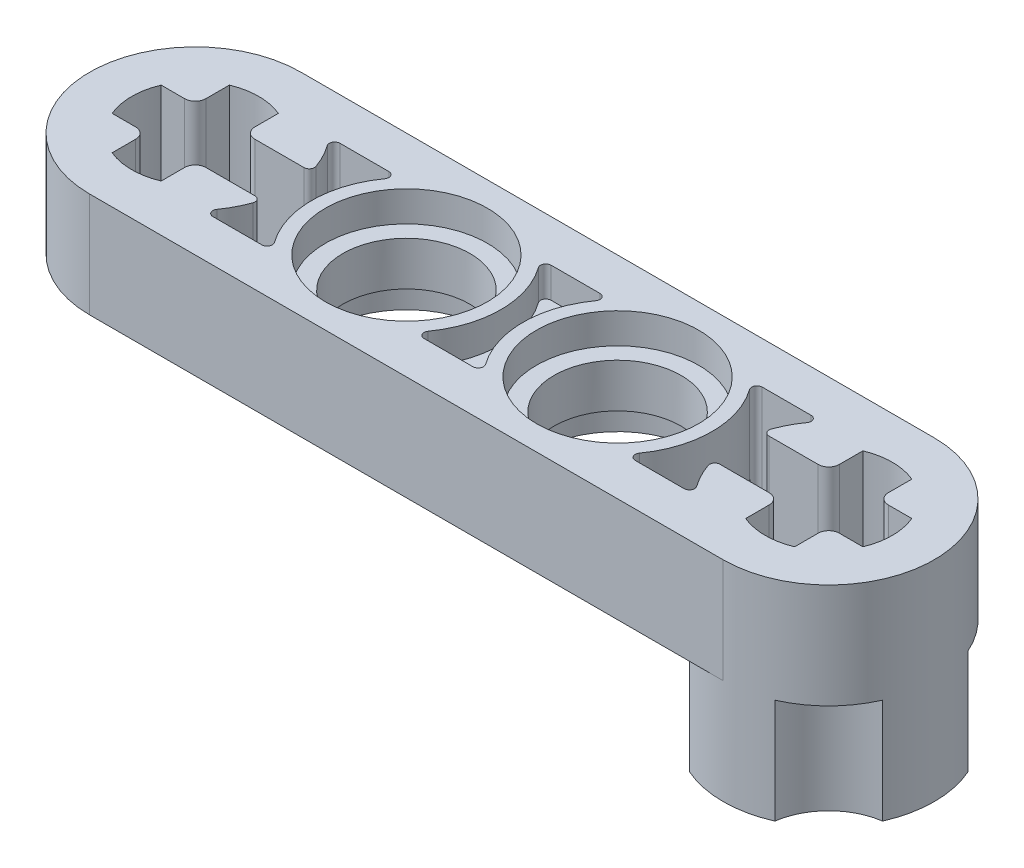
ISO-10303-21;
HEADER;
FILE_DESCRIPTION(('STEP AP214'),'2;1');
FILE_NAME('part.step','',(''),(''),'','','');
FILE_SCHEMA(('AUTOMOTIVE_DESIGN { 1 0 10303 214 1 1 1 1 }'));
ENDSEC;
DATA;
#1=APPLICATION_CONTEXT('core data for automotive mechanical design processes');
#2=APPLICATION_PROTOCOL_DEFINITION('international standard','automotive_design',2000,#1);
#3=PRODUCT_CONTEXT('',#1,'mechanical');
#4=PRODUCT('Part','Part','',(#3));
#5=PRODUCT_RELATED_PRODUCT_CATEGORY('part','',(#4));
#6=PRODUCT_DEFINITION_FORMATION('','',#4);
#7=PRODUCT_DEFINITION_CONTEXT('part definition',#1,'design');
#8=PRODUCT_DEFINITION('design','',#6,#7);
#9=PRODUCT_DEFINITION_SHAPE('','',#8);
#10=(LENGTH_UNIT() NAMED_UNIT(*) SI_UNIT(.MILLI.,.METRE.));
#11=(NAMED_UNIT(*) PLANE_ANGLE_UNIT() SI_UNIT($,.RADIAN.));
#12=(NAMED_UNIT(*) SI_UNIT($,.STERADIAN.) SOLID_ANGLE_UNIT());
#13=UNCERTAINTY_MEASURE_WITH_UNIT(LENGTH_MEASURE(1.E-05),#10,'distance_accuracy_value','');
#14=(GEOMETRIC_REPRESENTATION_CONTEXT(3) GLOBAL_UNCERTAINTY_ASSIGNED_CONTEXT((#13)) GLOBAL_UNIT_ASSIGNED_CONTEXT((#10,
#11,#12)) REPRESENTATION_CONTEXT('',''));
#15=CARTESIAN_POINT('',(0.,0.,0.));
#16=DIRECTION('',(0.,0.,1.));
#17=DIRECTION('',(1.,0.,0.));
#18=AXIS2_PLACEMENT_3D('',#15,#16,#17);
#19=CARTESIAN_POINT('',(11.90625,1.9685,0.));
#20=DIRECTION('',(0.,-1.,0.));
#21=DIRECTION('',(0.,0.,-1.));
#22=AXIS2_PLACEMENT_3D('',#19,#20,#21);
#23=CYLINDRICAL_SURFACE('',#22,3.96874999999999);
#24=DIRECTION('',(0.,-1.,0.));
#25=VECTOR('',#24,1.);
#26=CARTESIAN_POINT('',(10.300885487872,-3.937,-3.62957040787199));
#27=LINE('',#26,#25);
#28=CARTESIAN_POINT('',(10.300885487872,-1.9685,-3.62957040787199));
#29=VERTEX_POINT('',#28);
#30=CARTESIAN_POINT('',(10.300885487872,-5.9055,-3.62957040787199));
#31=VERTEX_POINT('',#30);
#32=EDGE_CURVE('E47',#29,#31,#27,.T.);
#33=ORIENTED_EDGE('',*,*,#32,.F.);
#34=CARTESIAN_POINT('',(11.90625,-1.9685,0.));
#35=DIRECTION('',(0.,-1.,0.));
#36=DIRECTION('',(0.,0.,-1.));
#37=AXIS2_PLACEMENT_3D('',#34,#35,#36);
#38=CIRCLE('',#37,3.96874999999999);
#39=CARTESIAN_POINT('',(11.90625,-1.9685,-3.96874999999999));
#40=VERTEX_POINT('',#39);
#41=EDGE_CURVE('E562',#29,#40,#38,.T.);
#42=ORIENTED_EDGE('',*,*,#41,.T.);
#43=DIRECTION('',(0.,-1.,0.));
#44=VECTOR('',#43,1.);
#45=CARTESIAN_POINT('',(11.90625,1.9685,-3.96874999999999));
#46=LINE('',#45,#44);
#47=CARTESIAN_POINT('',(11.90625,1.9685,-3.96874999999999));
#48=VERTEX_POINT('',#47);
#49=EDGE_CURVE('E877',#48,#40,#46,.T.);
#50=ORIENTED_EDGE('',*,*,#49,.F.);
#51=CARTESIAN_POINT('',(11.90625,1.9685,0.));
#52=DIRECTION('',(0.,-1.,0.));
#53=DIRECTION('',(0.,0.,-1.));
#54=AXIS2_PLACEMENT_3D('',#51,#52,#53);
#55=CIRCLE('',#54,3.96874999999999);
#56=CARTESIAN_POINT('',(11.90625,1.9685,3.96875));
#57=VERTEX_POINT('',#56);
#58=EDGE_CURVE('E865',#48,#57,#55,.T.);
#59=ORIENTED_EDGE('',*,*,#58,.T.);
#60=DIRECTION('',(0.,-1.,0.));
#61=VECTOR('',#60,1.);
#62=CARTESIAN_POINT('',(11.90625,1.9685,3.96875));
#63=LINE('',#62,#61);
#64=CARTESIAN_POINT('',(11.90625,-1.9685,3.96875));
#65=VERTEX_POINT('',#64);
#66=EDGE_CURVE('E876',#57,#65,#63,.T.);
#67=ORIENTED_EDGE('',*,*,#66,.T.);
#68=CARTESIAN_POINT('',(10.300885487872,-1.9685,3.62957040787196));
#69=VERTEX_POINT('',#68);
#70=EDGE_CURVE('E561',#65,#69,#38,.T.);
#71=ORIENTED_EDGE('',*,*,#70,.T.);
#72=DIRECTION('',(0.,-1.,0.));
#73=VECTOR('',#72,1.);
#74=CARTESIAN_POINT('',(10.300885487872,-3.937,3.62957040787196));
#75=LINE('',#74,#73);
#76=CARTESIAN_POINT('',(10.300885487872,-5.9055,3.62957040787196));
#77=VERTEX_POINT('',#76);
#78=EDGE_CURVE('E1248',#77,#69,#75,.F.);
#79=ORIENTED_EDGE('',*,*,#78,.F.);
#80=CARTESIAN_POINT('',(11.90625,-5.9055,0.));
#81=DIRECTION('',(0.,-1.,0.));
#82=DIRECTION('',(0.,0.,-1.));
#83=AXIS2_PLACEMENT_3D('',#80,#81,#82);
#84=CIRCLE('',#83,3.96874999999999);
#85=CARTESIAN_POINT('',(13.511614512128,-5.9055,3.62957040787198));
#86=VERTEX_POINT('',#85);
#87=EDGE_CURVE('E575',#86,#77,#84,.T.);
#88=ORIENTED_EDGE('',*,*,#87,.F.);
#89=DIRECTION('',(0.,-1.,0.));
#90=VECTOR('',#89,1.);
#91=CARTESIAN_POINT('',(13.511614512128,-3.937,3.62957040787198));
#92=LINE('',#91,#90);
#93=CARTESIAN_POINT('',(13.511614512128,-1.9685,3.62957040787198));
#94=VERTEX_POINT('',#93);
#95=EDGE_CURVE('E1173',#94,#86,#92,.T.);
#96=ORIENTED_EDGE('',*,*,#95,.F.);
#97=CARTESIAN_POINT('',(11.90625,-1.9685,0.));
#98=DIRECTION('',(0.,-1.,0.));
#99=DIRECTION('',(0.,0.,-1.));
#100=AXIS2_PLACEMENT_3D('',#97,#98,#99);
#101=CIRCLE('',#100,3.96874999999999);
#102=CARTESIAN_POINT('',(15.535820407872,-1.9685,1.60536451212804));
#103=VERTEX_POINT('',#102);
#104=EDGE_CURVE('E11',#94,#103,#101,.F.);
#105=ORIENTED_EDGE('',*,*,#104,.T.);
#106=DIRECTION('',(0.,-1.,0.));
#107=VECTOR('',#106,1.);
#108=CARTESIAN_POINT('',(15.535820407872,-3.937,1.60536451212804));
#109=LINE('',#108,#107);
#110=CARTESIAN_POINT('',(15.535820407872,-5.9055,1.60536451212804));
#111=VERTEX_POINT('',#110);
#112=EDGE_CURVE('E1256',#111,#103,#109,.F.);
#113=ORIENTED_EDGE('',*,*,#112,.F.);
#114=CARTESIAN_POINT('',(15.535820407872,-5.9055,-1.60536451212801));
#115=VERTEX_POINT('',#114);
#116=EDGE_CURVE('E571',#115,#111,#84,.T.);
#117=ORIENTED_EDGE('',*,*,#116,.F.);
#118=DIRECTION('',(0.,-1.,0.));
#119=VECTOR('',#118,1.);
#120=CARTESIAN_POINT('',(15.535820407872,-3.937,-1.60536451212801));
#121=LINE('',#120,#119);
#122=CARTESIAN_POINT('',(15.535820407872,-1.9685,-1.60536451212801));
#123=VERTEX_POINT('',#122);
#124=EDGE_CURVE('E1160',#123,#115,#121,.T.);
#125=ORIENTED_EDGE('',*,*,#124,.F.);
#126=CARTESIAN_POINT('',(11.90625,-1.9685,0.));
#127=DIRECTION('',(0.,-1.,0.));
#128=DIRECTION('',(0.,0.,-1.));
#129=AXIS2_PLACEMENT_3D('',#126,#127,#128);
#130=CIRCLE('',#129,3.96874999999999);
#131=CARTESIAN_POINT('',(13.511614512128,-1.9685,-3.62957040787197));
#132=VERTEX_POINT('',#131);
#133=EDGE_CURVE('E40',#123,#132,#130,.F.);
#134=ORIENTED_EDGE('',*,*,#133,.T.);
#135=DIRECTION('',(0.,-1.,0.));
#136=VECTOR('',#135,1.);
#137=CARTESIAN_POINT('',(13.511614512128,-3.937,-3.62957040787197));
#138=LINE('',#137,#136);
#139=CARTESIAN_POINT('',(13.511614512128,-5.9055,-3.62957040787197));
#140=VERTEX_POINT('',#139);
#141=EDGE_CURVE('E1158',#140,#132,#138,.F.);
#142=ORIENTED_EDGE('',*,*,#141,.F.);
#143=EDGE_CURVE('E565',#31,#140,#84,.T.);
#144=ORIENTED_EDGE('',*,*,#143,.F.);
#145=EDGE_LOOP('',(#33,#42,#50,#59,#67,#71,#79,#88,#96,#105,#113,#117,#125,#134,#142,#144));
#146=FACE_BOUND('',#145,.T.);
#147=ADVANCED_FACE('F32',(#146),#23,.T.);
#148=CARTESIAN_POINT('',(11.90625,-1.9685,0.));
#149=DIRECTION('',(0.,-1.,0.));
#150=DIRECTION('',(0.,0.,-1.));
#151=AXIS2_PLACEMENT_3D('',#148,#149,#150);
#152=PLANE('',#151);
#153=DIRECTION('',(1.,0.,0.));
#154=VECTOR('',#153,1.);
#155=CARTESIAN_POINT('',(-11.90625,-1.9685,-3.96874999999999));
#156=LINE('',#155,#154);
#157=CARTESIAN_POINT('',(-11.90625,-1.9685,-3.96874999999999));
#158=VERTEX_POINT('',#157);
#159=EDGE_CURVE('E863',#158,#40,#156,.T.);
#160=ORIENTED_EDGE('',*,*,#159,.T.);
#161=ORIENTED_EDGE('',*,*,#41,.F.);
#162=CARTESIAN_POINT('',(7.93750000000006,-1.9685,-3.96875000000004));
#163=DIRECTION('',(0.,-1.,0.));
#164=DIRECTION('',(0.,0.,-1.));
#165=AXIS2_PLACEMENT_3D('',#162,#163,#164);
#166=CIRCLE('',#165,2.3876);
#167=CARTESIAN_POINT('',(8.80815929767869,-1.9685,-1.74555721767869));
#168=VERTEX_POINT('',#167);
#169=EDGE_CURVE('E559',#168,#29,#166,.F.);
#170=ORIENTED_EDGE('',*,*,#169,.F.);
#171=CARTESIAN_POINT('',(11.90625,-1.9685,0.));
#172=DIRECTION('',(0.,-1.,0.));
#173=DIRECTION('',(0.,0.,1.));
#174=AXIS2_PLACEMENT_3D('',#171,#172,#173);
#175=CIRCLE('',#174,3.556);
#176=CARTESIAN_POINT('',(9.0173202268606,-1.9685,-2.07345623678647));
#177=VERTEX_POINT('',#176);
#178=EDGE_CURVE('E653',#168,#177,#175,.T.);
#179=ORIENTED_EDGE('',*,*,#178,.T.);
#180=CARTESIAN_POINT('',(8.85610762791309,-1.9685,-2.1891625));
#181=DIRECTION('',(0.,-1.,0.));
#182=DIRECTION('',(0.,0.,-1.));
#183=AXIS2_PLACEMENT_3D('',#180,#181,#182);
#184=CIRCLE('',#183,0.1984375);
#185=CARTESIAN_POINT('',(8.85610762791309,-1.9685,-2.3876));
#186=VERTEX_POINT('',#185);
#187=EDGE_CURVE('E1080',#177,#186,#184,.F.);
#188=ORIENTED_EDGE('',*,*,#187,.T.);
#189=DIRECTION('',(-1.,0.,0.));
#190=VECTOR('',#189,1.);
#191=CARTESIAN_POINT('',(9.27100765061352,-1.9685,-2.3876));
#192=LINE('',#191,#190);
#193=CARTESIAN_POINT('',(7.01889237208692,-1.9685,-2.3876));
#194=VERTEX_POINT('',#193);
#195=EDGE_CURVE('E651',#186,#194,#192,.T.);
#196=ORIENTED_EDGE('',*,*,#195,.T.);
#197=CARTESIAN_POINT('',(7.01889237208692,-1.9685,-2.1891625));
#198=DIRECTION('',(0.,-1.,0.));
#199=DIRECTION('',(0.,0.,-1.));
#200=AXIS2_PLACEMENT_3D('',#197,#198,#199);
#201=CIRCLE('',#200,0.1984375);
#202=CARTESIAN_POINT('',(6.85767977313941,-1.9685,-2.07345623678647));
#203=VERTEX_POINT('',#202);
#204=EDGE_CURVE('E1076',#194,#203,#201,.F.);
#205=ORIENTED_EDGE('',*,*,#204,.T.);
#206=CARTESIAN_POINT('',(3.96875,-1.9685,0.));
#207=DIRECTION('',(0.,-1.,0.));
#208=DIRECTION('',(0.,0.,1.));
#209=AXIS2_PLACEMENT_3D('',#206,#207,#208);
#210=CIRCLE('',#209,3.556);
#211=CARTESIAN_POINT('',(6.85767977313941,-1.9685,2.07345623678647));
#212=VERTEX_POINT('',#211);
#213=EDGE_CURVE('E649',#203,#212,#210,.T.);
#214=ORIENTED_EDGE('',*,*,#213,.T.);
#215=CARTESIAN_POINT('',(7.01889237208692,-1.9685,2.1891625));
#216=DIRECTION('',(0.,-1.,0.));
#217=DIRECTION('',(0.,0.,-1.));
#218=AXIS2_PLACEMENT_3D('',#215,#216,#217);
#219=CIRCLE('',#218,0.1984375);
#220=CARTESIAN_POINT('',(7.01889237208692,-1.9685,2.3876));
#221=VERTEX_POINT('',#220);
#222=EDGE_CURVE('E1067',#212,#221,#219,.F.);
#223=ORIENTED_EDGE('',*,*,#222,.T.);
#224=DIRECTION('',(-1.,0.,0.));
#225=VECTOR('',#224,1.);
#226=CARTESIAN_POINT('',(9.27100765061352,-1.9685,2.3876));
#227=LINE('',#226,#225);
#228=CARTESIAN_POINT('',(8.85610762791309,-1.9685,2.3876));
#229=VERTEX_POINT('',#228);
#230=EDGE_CURVE('E647',#229,#221,#227,.T.);
#231=ORIENTED_EDGE('',*,*,#230,.F.);
#232=CARTESIAN_POINT('',(8.85610762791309,-1.9685,2.1891625));
#233=DIRECTION('',(0.,-1.,0.));
#234=DIRECTION('',(0.,0.,-1.));
#235=AXIS2_PLACEMENT_3D('',#232,#233,#234);
#236=CIRCLE('',#235,0.1984375);
#237=CARTESIAN_POINT('',(9.0173202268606,-1.9685,2.07345623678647));
#238=VERTEX_POINT('',#237);
#239=EDGE_CURVE('E1072',#229,#238,#236,.F.);
#240=ORIENTED_EDGE('',*,*,#239,.T.);
#241=CARTESIAN_POINT('',(11.90625,-1.9685,0.));
#242=DIRECTION('',(0.,-1.,0.));
#243=DIRECTION('',(0.,0.,1.));
#244=AXIS2_PLACEMENT_3D('',#241,#242,#243);
#245=CIRCLE('',#244,3.556);
#246=CARTESIAN_POINT('',(8.80815929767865,-1.9685,1.74555721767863));
#247=VERTEX_POINT('',#246);
#248=EDGE_CURVE('E645',#238,#247,#245,.T.);
#249=ORIENTED_EDGE('',*,*,#248,.T.);
#250=CARTESIAN_POINT('',(7.93749999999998,-1.9685,3.96874999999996));
#251=DIRECTION('',(0.,-1.,0.));
#252=DIRECTION('',(0.,0.,-1.));
#253=AXIS2_PLACEMENT_3D('',#250,#251,#252);
#254=CIRCLE('',#253,2.3876);
#255=EDGE_CURVE('E1247',#69,#247,#254,.F.);
#256=ORIENTED_EDGE('',*,*,#255,.F.);
#257=ORIENTED_EDGE('',*,*,#70,.F.);
#258=DIRECTION('',(-1.,0.,0.));
#259=VECTOR('',#258,1.);
#260=CARTESIAN_POINT('',(11.90625,-1.9685,3.96875));
#261=LINE('',#260,#259);
#262=CARTESIAN_POINT('',(-11.90625,-1.9685,3.96875));
#263=VERTEX_POINT('',#262);
#264=EDGE_CURVE('E858',#65,#263,#261,.T.);
#265=ORIENTED_EDGE('',*,*,#264,.T.);
#266=CARTESIAN_POINT('',(-11.90625,-1.9685,0.));
#267=DIRECTION('',(0.,1.,0.));
#268=DIRECTION('',(0.,0.,1.));
#269=AXIS2_PLACEMENT_3D('',#266,#267,#268);
#270=CIRCLE('',#269,3.96874999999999);
#271=EDGE_CURVE('E860',#158,#263,#270,.T.);
#272=ORIENTED_EDGE('',*,*,#271,.F.);
#273=EDGE_LOOP('',(#160,#161,#170,#179,#188,#196,#205,#214,#223,#231,#240,#249,#256,#257,#265,#272));
#274=FACE_BOUND('',#273,.T.);
#275=CARTESIAN_POINT('',(-11.90625,-1.9685,0.));
#276=DIRECTION('',(0.,1.,0.));
#277=DIRECTION('',(0.,0.,1.));
#278=AXIS2_PLACEMENT_3D('',#275,#276,#277);
#279=CIRCLE('',#278,3.556);
#280=CARTESIAN_POINT('',(-8.55362104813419,-1.9685,-1.18533333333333));
#281=VERTEX_POINT('',#280);
#282=CARTESIAN_POINT('',(-9.0173202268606,-1.9685,-2.07345623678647));
#283=VERTEX_POINT('',#282);
#284=EDGE_CURVE('E739',#281,#283,#279,.T.);
#285=ORIENTED_EDGE('',*,*,#284,.F.);
#286=CARTESIAN_POINT('',(-8.74070971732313,-1.9685,-1.1191875));
#287=DIRECTION('',(0.,-1.,0.));
#288=DIRECTION('',(0.,0.,-1.));
#289=AXIS2_PLACEMENT_3D('',#286,#287,#288);
#290=CIRCLE('',#289,0.1984375);
#291=CARTESIAN_POINT('',(-8.74070971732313,-1.9685,-0.920749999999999));
#292=VERTEX_POINT('',#291);
#293=EDGE_CURVE('E965',#281,#292,#290,.T.);
#294=ORIENTED_EDGE('',*,*,#293,.T.);
#295=DIRECTION('',(1.,0.,0.));
#296=VECTOR('',#295,1.);
#297=CARTESIAN_POINT('',(-10.9855,-1.9685,-0.92075));
#298=LINE('',#297,#296);
#299=CARTESIAN_POINT('',(-10.588625,-1.9685,-0.92075));
#300=VERTEX_POINT('',#299);
#301=EDGE_CURVE('E791',#300,#292,#298,.T.);
#302=ORIENTED_EDGE('',*,*,#301,.F.);
#303=CARTESIAN_POINT('',(-10.588625,-1.9685,-1.317625));
#304=DIRECTION('',(0.,-1.,0.));
#305=DIRECTION('',(0.,0.,-1.));
#306=AXIS2_PLACEMENT_3D('',#303,#304,#305);
#307=CIRCLE('',#306,0.396875);
#308=CARTESIAN_POINT('',(-10.9855,-1.9685,-1.317625));
#309=VERTEX_POINT('',#308);
#310=EDGE_CURVE('E912',#300,#309,#307,.T.);
#311=ORIENTED_EDGE('',*,*,#310,.T.);
#312=DIRECTION('',(0.,0.,1.));
#313=VECTOR('',#312,1.);
#314=CARTESIAN_POINT('',(-10.9855,-1.9685,-2.20291924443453));
#315=LINE('',#314,#313);
#316=CARTESIAN_POINT('',(-10.9855,-1.9685,-2.20291924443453));
#317=VERTEX_POINT('',#316);
#318=EDGE_CURVE('E794',#317,#309,#315,.T.);
#319=ORIENTED_EDGE('',*,*,#318,.F.);
#320=CARTESIAN_POINT('',(-11.90625,-1.9685,0.));
#321=DIRECTION('',(0.,1.,0.));
#322=DIRECTION('',(0.,0.,1.));
#323=AXIS2_PLACEMENT_3D('',#320,#321,#322);
#324=CIRCLE('',#323,2.3876);
#325=CARTESIAN_POINT('',(-12.827,-1.9685,-2.20291924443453));
#326=VERTEX_POINT('',#325);
#327=EDGE_CURVE('E797',#317,#326,#324,.T.);
#328=ORIENTED_EDGE('',*,*,#327,.T.);
#329=DIRECTION('',(0.,0.,1.));
#330=VECTOR('',#329,1.);
#331=CARTESIAN_POINT('',(-12.827,-1.9685,-2.20291924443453));
#332=LINE('',#331,#330);
#333=CARTESIAN_POINT('',(-12.827,-1.9685,-1.317625));
#334=VERTEX_POINT('',#333);
#335=EDGE_CURVE('E800',#326,#334,#332,.T.);
#336=ORIENTED_EDGE('',*,*,#335,.T.);
#337=CARTESIAN_POINT('',(-13.223875,-1.9685,-1.317625));
#338=DIRECTION('',(0.,-1.,0.));
#339=DIRECTION('',(0.,0.,-1.));
#340=AXIS2_PLACEMENT_3D('',#337,#338,#339);
#341=CIRCLE('',#340,0.396875);
#342=CARTESIAN_POINT('',(-13.223875,-1.9685,-0.92075));
#343=VERTEX_POINT('',#342);
#344=EDGE_CURVE('E914',#334,#343,#341,.T.);
#345=ORIENTED_EDGE('',*,*,#344,.T.);
#346=DIRECTION('',(-1.,0.,0.));
#347=VECTOR('',#346,1.);
#348=CARTESIAN_POINT('',(-12.827,-1.9685,-0.92075));
#349=LINE('',#348,#347);
#350=CARTESIAN_POINT('',(-14.1091692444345,-1.9685,-0.92075));
#351=VERTEX_POINT('',#350);
#352=EDGE_CURVE('E803',#343,#351,#349,.T.);
#353=ORIENTED_EDGE('',*,*,#352,.T.);
#354=CARTESIAN_POINT('',(-11.90625,-1.9685,0.));
#355=DIRECTION('',(0.,1.,0.));
#356=DIRECTION('',(0.,0.,1.));
#357=AXIS2_PLACEMENT_3D('',#354,#355,#356);
#358=CIRCLE('',#357,2.3876);
#359=CARTESIAN_POINT('',(-14.1091692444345,-1.9685,0.920750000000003));
#360=VERTEX_POINT('',#359);
#361=EDGE_CURVE('E805',#351,#360,#358,.T.);
#362=ORIENTED_EDGE('',*,*,#361,.T.);
#363=DIRECTION('',(-1.,0.,0.));
#364=VECTOR('',#363,1.);
#365=CARTESIAN_POINT('',(-12.827,-1.9685,0.920750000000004));
#366=LINE('',#365,#364);
#367=CARTESIAN_POINT('',(-13.223875,-1.9685,0.920750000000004));
#368=VERTEX_POINT('',#367);
#369=EDGE_CURVE('E808',#368,#360,#366,.T.);
#370=ORIENTED_EDGE('',*,*,#369,.F.);
#371=CARTESIAN_POINT('',(-13.223875,-1.9685,1.317625));
#372=DIRECTION('',(0.,-1.,0.));
#373=DIRECTION('',(0.,0.,-1.));
#374=AXIS2_PLACEMENT_3D('',#371,#372,#373);
#375=CIRCLE('',#374,0.396875);
#376=CARTESIAN_POINT('',(-12.827,-1.9685,1.317625));
#377=VERTEX_POINT('',#376);
#378=EDGE_CURVE('E910',#368,#377,#375,.T.);
#379=ORIENTED_EDGE('',*,*,#378,.T.);
#380=DIRECTION('',(0.,0.,-1.));
#381=VECTOR('',#380,1.);
#382=CARTESIAN_POINT('',(-12.827,-1.9685,2.20291924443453));
#383=LINE('',#382,#381);
#384=CARTESIAN_POINT('',(-12.827,-1.9685,2.20291924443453));
#385=VERTEX_POINT('',#384);
#386=EDGE_CURVE('E810',#385,#377,#383,.T.);
#387=ORIENTED_EDGE('',*,*,#386,.F.);
#388=CARTESIAN_POINT('',(-11.90625,-1.9685,0.));
#389=DIRECTION('',(0.,1.,0.));
#390=DIRECTION('',(0.,0.,1.));
#391=AXIS2_PLACEMENT_3D('',#388,#389,#390);
#392=CIRCLE('',#391,2.3876);
#393=CARTESIAN_POINT('',(-10.9855,-1.9685,2.20291924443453));
#394=VERTEX_POINT('',#393);
#395=EDGE_CURVE('E813',#385,#394,#392,.T.);
#396=ORIENTED_EDGE('',*,*,#395,.T.);
#397=DIRECTION('',(0.,0.,-1.));
#398=VECTOR('',#397,1.);
#399=CARTESIAN_POINT('',(-10.9855,-1.9685,2.20291924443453));
#400=LINE('',#399,#398);
#401=CARTESIAN_POINT('',(-10.9855,-1.9685,1.317625));
#402=VERTEX_POINT('',#401);
#403=EDGE_CURVE('E785',#394,#402,#400,.T.);
#404=ORIENTED_EDGE('',*,*,#403,.T.);
#405=CARTESIAN_POINT('',(-10.588625,-1.9685,1.317625));
#406=DIRECTION('',(0.,-1.,0.));
#407=DIRECTION('',(0.,0.,-1.));
#408=AXIS2_PLACEMENT_3D('',#405,#406,#407);
#409=CIRCLE('',#408,0.396875);
#410=CARTESIAN_POINT('',(-10.588625,-1.9685,0.920750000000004));
#411=VERTEX_POINT('',#410);
#412=EDGE_CURVE('E908',#402,#411,#409,.T.);
#413=ORIENTED_EDGE('',*,*,#412,.T.);
#414=DIRECTION('',(1.,0.,0.));
#415=VECTOR('',#414,1.);
#416=CARTESIAN_POINT('',(-10.9855,-1.9685,0.920750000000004));
#417=LINE('',#416,#415);
#418=CARTESIAN_POINT('',(-8.74070971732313,-1.9685,0.920750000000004));
#419=VERTEX_POINT('',#418);
#420=EDGE_CURVE('E788',#411,#419,#417,.T.);
#421=ORIENTED_EDGE('',*,*,#420,.T.);
#422=CARTESIAN_POINT('',(-8.74070971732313,-1.9685,1.1191875));
#423=DIRECTION('',(0.,-1.,0.));
#424=DIRECTION('',(0.,0.,-1.));
#425=AXIS2_PLACEMENT_3D('',#422,#423,#424);
#426=CIRCLE('',#425,0.1984375);
#427=CARTESIAN_POINT('',(-8.55362104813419,-1.9685,1.18533333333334));
#428=VERTEX_POINT('',#427);
#429=EDGE_CURVE('E963',#419,#428,#426,.T.);
#430=ORIENTED_EDGE('',*,*,#429,.T.);
#431=CARTESIAN_POINT('',(-11.90625,-1.9685,0.));
#432=DIRECTION('',(0.,1.,0.));
#433=DIRECTION('',(0.,0.,1.));
#434=AXIS2_PLACEMENT_3D('',#431,#432,#433);
#435=CIRCLE('',#434,3.556);
#436=CARTESIAN_POINT('',(-9.0173202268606,-1.9685,2.07345623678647));
#437=VERTEX_POINT('',#436);
#438=EDGE_CURVE('E751',#437,#428,#435,.T.);
#439=ORIENTED_EDGE('',*,*,#438,.F.);
#440=CARTESIAN_POINT('',(-8.85610762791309,-1.9685,2.1891625));
#441=DIRECTION('',(0.,-1.,0.));
#442=DIRECTION('',(0.,0.,-1.));
#443=AXIS2_PLACEMENT_3D('',#440,#441,#442);
#444=CIRCLE('',#443,0.1984375);
#445=CARTESIAN_POINT('',(-8.85610762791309,-1.9685,2.3876));
#446=VERTEX_POINT('',#445);
#447=EDGE_CURVE('E975',#437,#446,#444,.F.);
#448=ORIENTED_EDGE('',*,*,#447,.T.);
#449=DIRECTION('',(1.,0.,0.));
#450=VECTOR('',#449,1.);
#451=CARTESIAN_POINT('',(-9.27100765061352,-1.9685,2.3876));
#452=LINE('',#451,#450);
#453=CARTESIAN_POINT('',(-7.01889237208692,-1.9685,2.3876));
#454=VERTEX_POINT('',#453);
#455=EDGE_CURVE('E748',#446,#454,#452,.T.);
#456=ORIENTED_EDGE('',*,*,#455,.T.);
#457=CARTESIAN_POINT('',(-7.01889237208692,-1.9685,2.1891625));
#458=DIRECTION('',(0.,-1.,0.));
#459=DIRECTION('',(0.,0.,-1.));
#460=AXIS2_PLACEMENT_3D('',#457,#458,#459);
#461=CIRCLE('',#460,0.1984375);
#462=CARTESIAN_POINT('',(-6.85767977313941,-1.9685,2.07345623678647));
#463=VERTEX_POINT('',#462);
#464=EDGE_CURVE('E971',#454,#463,#461,.F.);
#465=ORIENTED_EDGE('',*,*,#464,.T.);
#466=CARTESIAN_POINT('',(-3.96875,-1.9685,0.));
#467=DIRECTION('',(0.,1.,0.));
#468=DIRECTION('',(0.,0.,1.));
#469=AXIS2_PLACEMENT_3D('',#466,#467,#468);
#470=CIRCLE('',#469,3.556);
#471=CARTESIAN_POINT('',(-6.85767977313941,-1.9685,-2.07345623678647));
#472=VERTEX_POINT('',#471);
#473=EDGE_CURVE('E745',#472,#463,#470,.T.);
#474=ORIENTED_EDGE('',*,*,#473,.F.);
#475=CARTESIAN_POINT('',(-7.01889237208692,-1.9685,-2.1891625));
#476=DIRECTION('',(0.,-1.,0.));
#477=DIRECTION('',(0.,0.,-1.));
#478=AXIS2_PLACEMENT_3D('',#475,#476,#477);
#479=CIRCLE('',#478,0.1984375);
#480=CARTESIAN_POINT('',(-7.01889237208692,-1.9685,-2.3876));
#481=VERTEX_POINT('',#480);
#482=EDGE_CURVE('E979',#472,#481,#479,.F.);
#483=ORIENTED_EDGE('',*,*,#482,.T.);
#484=DIRECTION('',(1.,0.,0.));
#485=VECTOR('',#484,1.);
#486=CARTESIAN_POINT('',(-9.27100765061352,-1.9685,-2.3876));
#487=LINE('',#486,#485);
#488=CARTESIAN_POINT('',(-8.85610762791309,-1.9685,-2.3876));
#489=VERTEX_POINT('',#488);
#490=EDGE_CURVE('E742',#489,#481,#487,.T.);
#491=ORIENTED_EDGE('',*,*,#490,.F.);
#492=CARTESIAN_POINT('',(-8.85610762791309,-1.9685,-2.1891625));
#493=DIRECTION('',(0.,-1.,0.));
#494=DIRECTION('',(0.,0.,-1.));
#495=AXIS2_PLACEMENT_3D('',#492,#493,#494);
#496=CIRCLE('',#495,0.1984375);
#497=EDGE_CURVE('E983',#489,#283,#496,.F.);
#498=ORIENTED_EDGE('',*,*,#497,.T.);
#499=EDGE_LOOP('',(#285,#294,#302,#311,#319,#328,#336,#345,#353,#362,#370,#379,#387,#396,#404,
#413,#421,#430,#439,#448,#456,#465,#474,#483,#491,#498));
#500=FACE_BOUND('',#499,.T.);
#501=CARTESIAN_POINT('',(3.96875,-1.9685,0.));
#502=DIRECTION('',(0.,-1.,0.));
#503=DIRECTION('',(0.,0.,-1.));
#504=AXIS2_PLACEMENT_3D('',#501,#502,#503);
#505=CIRCLE('',#504,3.048);
#506=CARTESIAN_POINT('',(3.96875,-1.9685,-3.048));
#507=VERTEX_POINT('',#506);
#508=EDGE_CURVE('E819',#507,#507,#505,.T.);
#509=ORIENTED_EDGE('',*,*,#508,.F.);
#510=EDGE_LOOP('',(#509));
#511=FACE_BOUND('',#510,.T.);
#512=CARTESIAN_POINT('',(-3.96875,-1.9685,0.));
#513=DIRECTION('',(0.,-1.,0.));
#514=DIRECTION('',(0.,0.,-1.));
#515=AXIS2_PLACEMENT_3D('',#512,#513,#514);
#516=CIRCLE('',#515,3.048);
#517=CARTESIAN_POINT('',(-3.96875,-1.9685,-3.048));
#518=VERTEX_POINT('',#517);
#519=EDGE_CURVE('E844',#518,#518,#516,.T.);
#520=ORIENTED_EDGE('',*,*,#519,.F.);
#521=EDGE_LOOP('',(#520));
#522=FACE_BOUND('',#521,.T.);
#523=CARTESIAN_POINT('',(-3.96875,-1.96849999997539,0.));
#524=DIRECTION('',(0.,1.,0.));
#525=DIRECTION('',(0.,0.,1.));
#526=AXIS2_PLACEMENT_3D('',#523,#524,#525);
#527=CIRCLE('',#526,3.556);
#528=CARTESIAN_POINT('',(-1.07982022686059,-1.96849999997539,2.07345623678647));
#529=VERTEX_POINT('',#528);
#530=CARTESIAN_POINT('',(-1.0798202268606,-1.96849999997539,-2.07345623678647));
#531=VERTEX_POINT('',#530);
#532=EDGE_CURVE('E581',#529,#531,#527,.T.);
#533=ORIENTED_EDGE('',*,*,#532,.F.);
#534=CARTESIAN_POINT('',(-0.918607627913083,-1.9685,2.1891625));
#535=DIRECTION('',(0.,-1.,0.));
#536=DIRECTION('',(0.,0.,-1.));
#537=AXIS2_PLACEMENT_3D('',#534,#535,#536);
#538=CIRCLE('',#537,0.1984375);
#539=CARTESIAN_POINT('',(-0.918607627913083,-1.96849999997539,2.3876));
#540=VERTEX_POINT('',#539);
#541=EDGE_CURVE('E1150',#529,#540,#538,.F.);
#542=ORIENTED_EDGE('',*,*,#541,.T.);
#543=DIRECTION('',(1.,0.,0.));
#544=VECTOR('',#543,1.);
#545=CARTESIAN_POINT('',(-1.33350765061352,-1.96849999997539,2.3876));
#546=LINE('',#545,#544);
#547=CARTESIAN_POINT('',(0.918607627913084,-1.96849999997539,2.38759999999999));
#548=VERTEX_POINT('',#547);
#549=EDGE_CURVE('E584',#540,#548,#546,.T.);
#550=ORIENTED_EDGE('',*,*,#549,.T.);
#551=CARTESIAN_POINT('',(0.918607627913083,-1.9685,2.18916249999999));
#552=DIRECTION('',(0.,-1.,0.));
#553=DIRECTION('',(0.,0.,-1.));
#554=AXIS2_PLACEMENT_3D('',#551,#552,#553);
#555=CIRCLE('',#554,0.1984375);
#556=CARTESIAN_POINT('',(1.07982022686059,-1.96849999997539,2.07345623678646));
#557=VERTEX_POINT('',#556);
#558=EDGE_CURVE('E1152',#548,#557,#555,.F.);
#559=ORIENTED_EDGE('',*,*,#558,.T.);
#560=CARTESIAN_POINT('',(3.96875,-1.96849999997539,0.));
#561=DIRECTION('',(0.,1.,0.));
#562=DIRECTION('',(0.,0.,1.));
#563=AXIS2_PLACEMENT_3D('',#560,#561,#562);
#564=CIRCLE('',#563,3.556);
#565=CARTESIAN_POINT('',(1.0798202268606,-1.96849999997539,-2.07345623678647));
#566=VERTEX_POINT('',#565);
#567=EDGE_CURVE('E587',#566,#557,#564,.T.);
#568=ORIENTED_EDGE('',*,*,#567,.F.);
#569=CARTESIAN_POINT('',(0.918607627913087,-1.9685,-2.1891625));
#570=DIRECTION('',(0.,-1.,0.));
#571=DIRECTION('',(0.,0.,-1.));
#572=AXIS2_PLACEMENT_3D('',#569,#570,#571);
#573=CIRCLE('',#572,0.1984375);
#574=CARTESIAN_POINT('',(0.918607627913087,-1.96849999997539,-2.3876));
#575=VERTEX_POINT('',#574);
#576=EDGE_CURVE('E1148',#566,#575,#573,.F.);
#577=ORIENTED_EDGE('',*,*,#576,.T.);
#578=DIRECTION('',(1.,0.,0.));
#579=VECTOR('',#578,1.);
#580=CARTESIAN_POINT('',(-1.33350765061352,-1.96849999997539,-2.3876));
#581=LINE('',#580,#579);
#582=CARTESIAN_POINT('',(-0.918607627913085,-1.96849999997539,-2.3876));
#583=VERTEX_POINT('',#582);
#584=EDGE_CURVE('E590',#583,#575,#581,.T.);
#585=ORIENTED_EDGE('',*,*,#584,.F.);
#586=CARTESIAN_POINT('',(-0.918607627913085,-1.9685,-2.1891625));
#587=DIRECTION('',(0.,-1.,0.));
#588=DIRECTION('',(0.,0.,-1.));
#589=AXIS2_PLACEMENT_3D('',#586,#587,#588);
#590=CIRCLE('',#589,0.1984375);
#591=EDGE_CURVE('E1146',#583,#531,#590,.F.);
#592=ORIENTED_EDGE('',*,*,#591,.T.);
#593=EDGE_LOOP('',(#533,#542,#550,#559,#568,#577,#585,#592));
#594=FACE_BOUND('',#593,.T.);
#595=ADVANCED_FACE('F1236',(#274,#500,#511,#522,#594),#152,.T.);
#596=CARTESIAN_POINT('',(11.90625,-1.9685,0.));
#597=DIRECTION('',(0.,-1.,0.));
#598=DIRECTION('',(0.,0.,-1.));
#599=AXIS2_PLACEMENT_3D('',#596,#597,#598);
#600=CIRCLE('',#599,2.3876);
#601=CARTESIAN_POINT('',(9.70333075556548,-1.9685,-0.92075));
#602=VERTEX_POINT('',#601);
#603=CARTESIAN_POINT('',(10.9855,-1.9685,-2.20291924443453));
#604=VERTEX_POINT('',#603);
#605=EDGE_CURVE('E1177',#602,#604,#600,.T.);
#606=ORIENTED_EDGE('',*,*,#605,.T.);
#607=DIRECTION('',(0.,0.,1.));
#608=VECTOR('',#607,1.);
#609=CARTESIAN_POINT('',(10.9855,-1.9685,-2.20291924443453));
#610=LINE('',#609,#608);
#611=CARTESIAN_POINT('',(10.9855,-1.9685,-1.317625));
#612=VERTEX_POINT('',#611);
#613=EDGE_CURVE('E700',#604,#612,#610,.T.);
#614=ORIENTED_EDGE('',*,*,#613,.T.);
#615=CARTESIAN_POINT('',(10.588625,-1.9685,-1.317625));
#616=DIRECTION('',(0.,-1.,0.));
#617=DIRECTION('',(0.,0.,-1.));
#618=AXIS2_PLACEMENT_3D('',#615,#616,#617);
#619=CIRCLE('',#618,0.396875);
#620=CARTESIAN_POINT('',(10.588625,-1.9685,-0.92075));
#621=VERTEX_POINT('',#620);
#622=EDGE_CURVE('E1002',#612,#621,#619,.T.);
#623=ORIENTED_EDGE('',*,*,#622,.T.);
#624=DIRECTION('',(-1.,0.,0.));
#625=VECTOR('',#624,1.);
#626=CARTESIAN_POINT('',(10.9855,-1.9685,-0.92075));
#627=LINE('',#626,#625);
#628=EDGE_CURVE('E703',#621,#602,#627,.T.);
#629=ORIENTED_EDGE('',*,*,#628,.T.);
#630=EDGE_LOOP('',(#606,#614,#623,#629));
#631=FACE_BOUND('',#630,.T.);
#632=ADVANCED_FACE('F1214',(#631),#152,.T.);
#633=CARTESIAN_POINT('',(10.9855,-1.9685,2.20291924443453));
#634=VERTEX_POINT('',#633);
#635=CARTESIAN_POINT('',(9.70333075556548,-1.9685,0.920750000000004));
#636=VERTEX_POINT('',#635);
#637=EDGE_CURVE('E1185',#634,#636,#600,.T.);
#638=ORIENTED_EDGE('',*,*,#637,.T.);
#639=DIRECTION('',(-1.,0.,0.));
#640=VECTOR('',#639,1.);
#641=CARTESIAN_POINT('',(10.9855,-1.9685,0.920750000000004));
#642=LINE('',#641,#640);
#643=CARTESIAN_POINT('',(10.588625,-1.9685,0.920750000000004));
#644=VERTEX_POINT('',#643);
#645=EDGE_CURVE('E706',#644,#636,#642,.T.);
#646=ORIENTED_EDGE('',*,*,#645,.F.);
#647=CARTESIAN_POINT('',(10.588625,-1.9685,1.317625));
#648=DIRECTION('',(0.,-1.,0.));
#649=DIRECTION('',(0.,0.,-1.));
#650=AXIS2_PLACEMENT_3D('',#647,#648,#649);
#651=CIRCLE('',#650,0.396875);
#652=CARTESIAN_POINT('',(10.9855,-1.9685,1.317625));
#653=VERTEX_POINT('',#652);
#654=EDGE_CURVE('E998',#644,#653,#651,.T.);
#655=ORIENTED_EDGE('',*,*,#654,.T.);
#656=DIRECTION('',(0.,0.,-1.));
#657=VECTOR('',#656,1.);
#658=CARTESIAN_POINT('',(10.9855,-1.9685,2.20291924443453));
#659=LINE('',#658,#657);
#660=EDGE_CURVE('E686',#634,#653,#659,.T.);
#661=ORIENTED_EDGE('',*,*,#660,.F.);
#662=EDGE_LOOP('',(#638,#646,#655,#661));
#663=FACE_BOUND('',#662,.T.);
#664=ADVANCED_FACE('F1197',(#663),#152,.T.);
#665=CARTESIAN_POINT('',(14.1091692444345,-1.9685,0.920750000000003));
#666=VERTEX_POINT('',#665);
#667=CARTESIAN_POINT('',(12.827,-1.9685,2.20291924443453));
#668=VERTEX_POINT('',#667);
#669=EDGE_CURVE('E1179',#666,#668,#600,.T.);
#670=ORIENTED_EDGE('',*,*,#669,.T.);
#671=DIRECTION('',(0.,0.,-1.));
#672=VECTOR('',#671,1.);
#673=CARTESIAN_POINT('',(12.827,-1.9685,2.20291924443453));
#674=LINE('',#673,#672);
#675=CARTESIAN_POINT('',(12.827,-1.9685,1.317625));
#676=VERTEX_POINT('',#675);
#677=EDGE_CURVE('E689',#668,#676,#674,.T.);
#678=ORIENTED_EDGE('',*,*,#677,.T.);
#679=CARTESIAN_POINT('',(13.223875,-1.9685,1.317625));
#680=DIRECTION('',(0.,-1.,0.));
#681=DIRECTION('',(0.,0.,-1.));
#682=AXIS2_PLACEMENT_3D('',#679,#680,#681);
#683=CIRCLE('',#682,0.396875);
#684=CARTESIAN_POINT('',(13.223875,-1.9685,0.920750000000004));
#685=VERTEX_POINT('',#684);
#686=EDGE_CURVE('E1000',#676,#685,#683,.T.);
#687=ORIENTED_EDGE('',*,*,#686,.T.);
#688=DIRECTION('',(1.,0.,0.));
#689=VECTOR('',#688,1.);
#690=CARTESIAN_POINT('',(12.827,-1.9685,0.920750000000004));
#691=LINE('',#690,#689);
#692=EDGE_CURVE('E692',#685,#666,#691,.T.);
#693=ORIENTED_EDGE('',*,*,#692,.T.);
#694=EDGE_LOOP('',(#670,#678,#687,#693));
#695=FACE_BOUND('',#694,.T.);
#696=ADVANCED_FACE('F1315',(#695),#152,.T.);
#697=CARTESIAN_POINT('',(11.90625,1.9685,0.));
#698=DIRECTION('',(0.,-1.,0.));
#699=DIRECTION('',(0.,0.,-1.));
#700=AXIS2_PLACEMENT_3D('',#697,#698,#699);
#701=PLANE('',#700);
#702=CARTESIAN_POINT('',(11.90625,1.9685,0.));
#703=DIRECTION('',(0.,-1.,0.));
#704=DIRECTION('',(0.,0.,1.));
#705=AXIS2_PLACEMENT_3D('',#702,#703,#704);
#706=CIRCLE('',#705,3.556);
#707=CARTESIAN_POINT('',(8.55362104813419,1.9685,-1.18533333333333));
#708=VERTEX_POINT('',#707);
#709=CARTESIAN_POINT('',(9.0173202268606,1.9685,-2.07345623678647));
#710=VERTEX_POINT('',#709);
#711=EDGE_CURVE('E641',#708,#710,#706,.T.);
#712=ORIENTED_EDGE('',*,*,#711,.F.);
#713=CARTESIAN_POINT('',(8.74070971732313,1.9685,-1.1191875));
#714=DIRECTION('',(0.,-1.,0.));
#715=DIRECTION('',(0.,0.,-1.));
#716=AXIS2_PLACEMENT_3D('',#713,#714,#715);
#717=CIRCLE('',#716,0.1984375);
#718=CARTESIAN_POINT('',(8.74070971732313,1.9685,-0.920749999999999));
#719=VERTEX_POINT('',#718);
#720=EDGE_CURVE('E1053',#708,#719,#717,.F.);
#721=ORIENTED_EDGE('',*,*,#720,.T.);
#722=DIRECTION('',(-1.,0.,0.));
#723=VECTOR('',#722,1.);
#724=CARTESIAN_POINT('',(10.9855,1.9685,-0.92075));
#725=LINE('',#724,#723);
#726=CARTESIAN_POINT('',(10.588625,1.9685,-0.92075));
#727=VERTEX_POINT('',#726);
#728=EDGE_CURVE('E680',#727,#719,#725,.T.);
#729=ORIENTED_EDGE('',*,*,#728,.F.);
#730=CARTESIAN_POINT('',(10.588625,1.9685,-1.317625));
#731=DIRECTION('',(0.,-1.,0.));
#732=DIRECTION('',(0.,0.,-1.));
#733=AXIS2_PLACEMENT_3D('',#730,#731,#732);
#734=CIRCLE('',#733,0.396875);
#735=CARTESIAN_POINT('',(10.9855,1.9685,-1.317625));
#736=VERTEX_POINT('',#735);
#737=EDGE_CURVE('E992',#727,#736,#734,.F.);
#738=ORIENTED_EDGE('',*,*,#737,.T.);
#739=DIRECTION('',(0.,0.,1.));
#740=VECTOR('',#739,1.);
#741=CARTESIAN_POINT('',(10.9855,1.9685,-2.20291924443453));
#742=LINE('',#741,#740);
#743=CARTESIAN_POINT('',(10.9855,1.9685,-2.20291924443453));
#744=VERTEX_POINT('',#743);
#745=EDGE_CURVE('E677',#744,#736,#742,.T.);
#746=ORIENTED_EDGE('',*,*,#745,.F.);
#747=CARTESIAN_POINT('',(11.90625,1.9685,0.));
#748=DIRECTION('',(0.,-1.,0.));
#749=DIRECTION('',(0.,0.,1.));
#750=AXIS2_PLACEMENT_3D('',#747,#748,#749);
#751=CIRCLE('',#750,2.3876);
#752=CARTESIAN_POINT('',(12.827,1.9685,-2.20291924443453));
#753=VERTEX_POINT('',#752);
#754=EDGE_CURVE('E674',#744,#753,#751,.T.);
#755=ORIENTED_EDGE('',*,*,#754,.T.);
#756=DIRECTION('',(0.,0.,1.));
#757=VECTOR('',#756,1.);
#758=CARTESIAN_POINT('',(12.827,1.9685,-2.20291924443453));
#759=LINE('',#758,#757);
#760=CARTESIAN_POINT('',(12.827,1.9685,-1.317625));
#761=VERTEX_POINT('',#760);
#762=EDGE_CURVE('E671',#753,#761,#759,.T.);
#763=ORIENTED_EDGE('',*,*,#762,.T.);
#764=CARTESIAN_POINT('',(13.223875,1.9685,-1.317625));
#765=DIRECTION('',(0.,-1.,0.));
#766=DIRECTION('',(0.,0.,-1.));
#767=AXIS2_PLACEMENT_3D('',#764,#765,#766);
#768=CIRCLE('',#767,0.396875);
#769=CARTESIAN_POINT('',(13.223875,1.9685,-0.92075));
#770=VERTEX_POINT('',#769);
#771=EDGE_CURVE('E994',#761,#770,#768,.F.);
#772=ORIENTED_EDGE('',*,*,#771,.T.);
#773=DIRECTION('',(1.,0.,0.));
#774=VECTOR('',#773,1.);
#775=CARTESIAN_POINT('',(12.827,1.9685,-0.92075));
#776=LINE('',#775,#774);
#777=CARTESIAN_POINT('',(14.1091692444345,1.9685,-0.92075));
#778=VERTEX_POINT('',#777);
#779=EDGE_CURVE('E669',#770,#778,#776,.T.);
#780=ORIENTED_EDGE('',*,*,#779,.T.);
#781=CARTESIAN_POINT('',(11.90625,1.9685,0.));
#782=DIRECTION('',(0.,-1.,0.));
#783=DIRECTION('',(0.,0.,1.));
#784=AXIS2_PLACEMENT_3D('',#781,#782,#783);
#785=CIRCLE('',#784,2.3876);
#786=CARTESIAN_POINT('',(14.1091692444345,1.9685,0.920750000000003));
#787=VERTEX_POINT('',#786);
#788=EDGE_CURVE('E666',#778,#787,#785,.T.);
#789=ORIENTED_EDGE('',*,*,#788,.T.);
#790=DIRECTION('',(1.,0.,0.));
#791=VECTOR('',#790,1.);
#792=CARTESIAN_POINT('',(12.827,1.9685,0.920750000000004));
#793=LINE('',#792,#791);
#794=CARTESIAN_POINT('',(13.223875,1.9685,0.920750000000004));
#795=VERTEX_POINT('',#794);
#796=EDGE_CURVE('E664',#795,#787,#793,.T.);
#797=ORIENTED_EDGE('',*,*,#796,.F.);
#798=CARTESIAN_POINT('',(13.223875,1.9685,1.317625));
#799=DIRECTION('',(0.,-1.,0.));
#800=DIRECTION('',(0.,0.,-1.));
#801=AXIS2_PLACEMENT_3D('',#798,#799,#800);
#802=CIRCLE('',#801,0.396875);
#803=CARTESIAN_POINT('',(12.827,1.9685,1.317625));
#804=VERTEX_POINT('',#803);
#805=EDGE_CURVE('E990',#795,#804,#802,.F.);
#806=ORIENTED_EDGE('',*,*,#805,.T.);
#807=DIRECTION('',(0.,0.,-1.));
#808=VECTOR('',#807,1.);
#809=CARTESIAN_POINT('',(12.827,1.9685,2.20291924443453));
#810=LINE('',#809,#808);
#811=CARTESIAN_POINT('',(12.827,1.9685,2.20291924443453));
#812=VERTEX_POINT('',#811);
#813=EDGE_CURVE('E661',#812,#804,#810,.T.);
#814=ORIENTED_EDGE('',*,*,#813,.F.);
#815=CARTESIAN_POINT('',(11.90625,1.9685,0.));
#816=DIRECTION('',(0.,-1.,0.));
#817=DIRECTION('',(0.,0.,1.));
#818=AXIS2_PLACEMENT_3D('',#815,#816,#817);
#819=CIRCLE('',#818,2.3876);
#820=CARTESIAN_POINT('',(10.9855,1.9685,2.20291924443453));
#821=VERTEX_POINT('',#820);
#822=EDGE_CURVE('E658',#812,#821,#819,.T.);
#823=ORIENTED_EDGE('',*,*,#822,.T.);
#824=DIRECTION('',(0.,0.,-1.));
#825=VECTOR('',#824,1.);
#826=CARTESIAN_POINT('',(10.9855,1.9685,2.20291924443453));
#827=LINE('',#826,#825);
#828=CARTESIAN_POINT('',(10.9855,1.9685,1.317625));
#829=VERTEX_POINT('',#828);
#830=EDGE_CURVE('E655',#821,#829,#827,.T.);
#831=ORIENTED_EDGE('',*,*,#830,.T.);
#832=CARTESIAN_POINT('',(10.588625,1.9685,1.317625));
#833=DIRECTION('',(0.,-1.,0.));
#834=DIRECTION('',(0.,0.,-1.));
#835=AXIS2_PLACEMENT_3D('',#832,#833,#834);
#836=CIRCLE('',#835,0.396875);
#837=CARTESIAN_POINT('',(10.588625,1.9685,0.920750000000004));
#838=VERTEX_POINT('',#837);
#839=EDGE_CURVE('E988',#829,#838,#836,.F.);
#840=ORIENTED_EDGE('',*,*,#839,.T.);
#841=DIRECTION('',(-1.,0.,0.));
#842=VECTOR('',#841,1.);
#843=CARTESIAN_POINT('',(10.9855,1.9685,0.920750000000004));
#844=LINE('',#843,#842);
#845=CARTESIAN_POINT('',(8.74070971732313,1.9685,0.920750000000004));
#846=VERTEX_POINT('',#845);
#847=EDGE_CURVE('E683',#838,#846,#844,.T.);
#848=ORIENTED_EDGE('',*,*,#847,.T.);
#849=CARTESIAN_POINT('',(8.74070971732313,1.9685,1.1191875));
#850=DIRECTION('',(0.,-1.,0.));
#851=DIRECTION('',(0.,0.,-1.));
#852=AXIS2_PLACEMENT_3D('',#849,#850,#851);
#853=CIRCLE('',#852,0.1984375);
#854=CARTESIAN_POINT('',(8.55362104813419,1.9685,1.18533333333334));
#855=VERTEX_POINT('',#854);
#856=EDGE_CURVE('E1051',#846,#855,#853,.F.);
#857=ORIENTED_EDGE('',*,*,#856,.T.);
#858=CARTESIAN_POINT('',(11.90625,1.9685,0.));
#859=DIRECTION('',(0.,-1.,0.));
#860=DIRECTION('',(0.,0.,1.));
#861=AXIS2_PLACEMENT_3D('',#858,#859,#860);
#862=CIRCLE('',#861,3.556);
#863=CARTESIAN_POINT('',(9.0173202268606,1.9685,2.07345623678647));
#864=VERTEX_POINT('',#863);
#865=EDGE_CURVE('E629',#864,#855,#862,.T.);
#866=ORIENTED_EDGE('',*,*,#865,.F.);
#867=CARTESIAN_POINT('',(8.85610762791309,1.9685,2.1891625));
#868=DIRECTION('',(0.,-1.,0.));
#869=DIRECTION('',(0.,0.,-1.));
#870=AXIS2_PLACEMENT_3D('',#867,#868,#869);
#871=CIRCLE('',#870,0.1984375);
#872=CARTESIAN_POINT('',(8.85610762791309,1.9685,2.3876));
#873=VERTEX_POINT('',#872);
#874=EDGE_CURVE('E1070',#864,#873,#871,.T.);
#875=ORIENTED_EDGE('',*,*,#874,.T.);
#876=DIRECTION('',(-1.,0.,0.));
#877=VECTOR('',#876,1.);
#878=CARTESIAN_POINT('',(9.27100765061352,1.9685,2.3876));
#879=LINE('',#878,#877);
#880=CARTESIAN_POINT('',(7.01889237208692,1.9685,2.3876));
#881=VERTEX_POINT('',#880);
#882=EDGE_CURVE('E632',#873,#881,#879,.T.);
#883=ORIENTED_EDGE('',*,*,#882,.T.);
#884=CARTESIAN_POINT('',(7.01889237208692,1.9685,2.1891625));
#885=DIRECTION('',(0.,-1.,0.));
#886=DIRECTION('',(0.,0.,-1.));
#887=AXIS2_PLACEMENT_3D('',#884,#885,#886);
#888=CIRCLE('',#887,0.1984375);
#889=CARTESIAN_POINT('',(6.85767977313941,1.9685,2.07345623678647));
#890=VERTEX_POINT('',#889);
#891=EDGE_CURVE('E1065',#881,#890,#888,.T.);
#892=ORIENTED_EDGE('',*,*,#891,.T.);
#893=CARTESIAN_POINT('',(3.96875,1.9685,0.));
#894=DIRECTION('',(0.,-1.,0.));
#895=DIRECTION('',(0.,0.,1.));
#896=AXIS2_PLACEMENT_3D('',#893,#894,#895);
#897=CIRCLE('',#896,3.556);
#898=CARTESIAN_POINT('',(6.85767977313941,1.9685,-2.07345623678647));
#899=VERTEX_POINT('',#898);
#900=EDGE_CURVE('E635',#899,#890,#897,.T.);
#901=ORIENTED_EDGE('',*,*,#900,.F.);
#902=CARTESIAN_POINT('',(7.01889237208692,1.9685,-2.1891625));
#903=DIRECTION('',(0.,-1.,0.));
#904=DIRECTION('',(0.,0.,-1.));
#905=AXIS2_PLACEMENT_3D('',#902,#903,#904);
#906=CIRCLE('',#905,0.1984375);
#907=CARTESIAN_POINT('',(7.01889237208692,1.9685,-2.3876));
#908=VERTEX_POINT('',#907);
#909=EDGE_CURVE('E1074',#899,#908,#906,.T.);
#910=ORIENTED_EDGE('',*,*,#909,.T.);
#911=DIRECTION('',(-1.,0.,0.));
#912=VECTOR('',#911,1.);
#913=CARTESIAN_POINT('',(9.27100765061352,1.9685,-2.3876));
#914=LINE('',#913,#912);
#915=CARTESIAN_POINT('',(8.85610762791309,1.9685,-2.3876));
#916=VERTEX_POINT('',#915);
#917=EDGE_CURVE('E638',#916,#908,#914,.T.);
#918=ORIENTED_EDGE('',*,*,#917,.F.);
#919=CARTESIAN_POINT('',(8.85610762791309,1.9685,-2.1891625));
#920=DIRECTION('',(0.,-1.,0.));
#921=DIRECTION('',(0.,0.,-1.));
#922=AXIS2_PLACEMENT_3D('',#919,#920,#921);
#923=CIRCLE('',#922,0.1984375);
#924=EDGE_CURVE('E1078',#916,#710,#923,.T.);
#925=ORIENTED_EDGE('',*,*,#924,.T.);
#926=EDGE_LOOP('',(#712,#721,#729,#738,#746,#755,#763,#772,#780,#789,#797,#806,#814,#823,#831,
#840,#848,#857,#866,#875,#883,#892,#901,#910,#918,#925));
#927=FACE_BOUND('',#926,.T.);
#928=DIRECTION('',(1.,0.,0.));
#929=VECTOR('',#928,1.);
#930=CARTESIAN_POINT('',(-10.9855,1.9685,-0.92075));
#931=LINE('',#930,#929);
#932=CARTESIAN_POINT('',(-10.588625,1.9685,-0.92075));
#933=VERTEX_POINT('',#932);
#934=CARTESIAN_POINT('',(-8.74070971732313,1.9685,-0.920749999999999));
#935=VERTEX_POINT('',#934);
#936=EDGE_CURVE('E760',#933,#935,#931,.T.);
#937=ORIENTED_EDGE('',*,*,#936,.T.);
#938=CARTESIAN_POINT('',(-8.74070971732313,1.9685,-1.1191875));
#939=DIRECTION('',(0.,-1.,0.));
#940=DIRECTION('',(0.,0.,-1.));
#941=AXIS2_PLACEMENT_3D('',#938,#939,#940);
#942=CIRCLE('',#941,0.1984375);
#943=CARTESIAN_POINT('',(-8.55362104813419,1.9685,-1.18533333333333));
#944=VERTEX_POINT('',#943);
#945=EDGE_CURVE('E961',#935,#944,#942,.F.);
#946=ORIENTED_EDGE('',*,*,#945,.T.);
#947=CARTESIAN_POINT('',(-11.90625,1.9685,0.));
#948=DIRECTION('',(0.,1.,0.));
#949=DIRECTION('',(0.,0.,1.));
#950=AXIS2_PLACEMENT_3D('',#947,#948,#949);
#951=CIRCLE('',#950,3.556);
#952=CARTESIAN_POINT('',(-9.0173202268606,1.9685,-2.07345623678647));
#953=VERTEX_POINT('',#952);
#954=EDGE_CURVE('E712',#944,#953,#951,.T.);
#955=ORIENTED_EDGE('',*,*,#954,.T.);
#956=CARTESIAN_POINT('',(-8.85610762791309,1.9685,-2.1891625));
#957=DIRECTION('',(0.,-1.,0.));
#958=DIRECTION('',(0.,0.,-1.));
#959=AXIS2_PLACEMENT_3D('',#956,#957,#958);
#960=CIRCLE('',#959,0.1984375);
#961=CARTESIAN_POINT('',(-8.85610762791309,1.9685,-2.3876));
#962=VERTEX_POINT('',#961);
#963=EDGE_CURVE('E981',#953,#962,#960,.T.);
#964=ORIENTED_EDGE('',*,*,#963,.T.);
#965=DIRECTION('',(1.,0.,0.));
#966=VECTOR('',#965,1.);
#967=CARTESIAN_POINT('',(-9.27100765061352,1.9685,-2.3876));
#968=LINE('',#967,#966);
#969=CARTESIAN_POINT('',(-7.01889237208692,1.9685,-2.3876));
#970=VERTEX_POINT('',#969);
#971=EDGE_CURVE('E727',#962,#970,#968,.T.);
#972=ORIENTED_EDGE('',*,*,#971,.T.);
#973=CARTESIAN_POINT('',(-7.01889237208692,1.9685,-2.1891625));
#974=DIRECTION('',(0.,-1.,0.));
#975=DIRECTION('',(0.,0.,-1.));
#976=AXIS2_PLACEMENT_3D('',#973,#974,#975);
#977=CIRCLE('',#976,0.1984375);
#978=CARTESIAN_POINT('',(-6.85767977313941,1.9685,-2.07345623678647));
#979=VERTEX_POINT('',#978);
#980=EDGE_CURVE('E977',#970,#979,#977,.T.);
#981=ORIENTED_EDGE('',*,*,#980,.T.);
#982=CARTESIAN_POINT('',(-3.96875,1.9685,0.));
#983=DIRECTION('',(0.,1.,0.));
#984=DIRECTION('',(0.,0.,1.));
#985=AXIS2_PLACEMENT_3D('',#982,#983,#984);
#986=CIRCLE('',#985,3.556);
#987=CARTESIAN_POINT('',(-6.85767977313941,1.9685,2.07345623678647));
#988=VERTEX_POINT('',#987);
#989=EDGE_CURVE('E730',#979,#988,#986,.T.);
#990=ORIENTED_EDGE('',*,*,#989,.T.);
#991=CARTESIAN_POINT('',(-7.01889237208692,1.9685,2.1891625));
#992=DIRECTION('',(0.,-1.,0.));
#993=DIRECTION('',(0.,0.,-1.));
#994=AXIS2_PLACEMENT_3D('',#991,#992,#993);
#995=CIRCLE('',#994,0.1984375);
#996=CARTESIAN_POINT('',(-7.01889237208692,1.9685,2.3876));
#997=VERTEX_POINT('',#996);
#998=EDGE_CURVE('E969',#988,#997,#995,.T.);
#999=ORIENTED_EDGE('',*,*,#998,.T.);
#1000=DIRECTION('',(1.,0.,0.));
#1001=VECTOR('',#1000,1.);
#1002=CARTESIAN_POINT('',(-9.27100765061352,1.9685,2.3876));
#1003=LINE('',#1002,#1001);
#1004=CARTESIAN_POINT('',(-8.85610762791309,1.9685,2.3876));
#1005=VERTEX_POINT('',#1004);
#1006=EDGE_CURVE('E733',#1005,#997,#1003,.T.);
#1007=ORIENTED_EDGE('',*,*,#1006,.F.);
#1008=CARTESIAN_POINT('',(-8.85610762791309,1.9685,2.1891625));
#1009=DIRECTION('',(0.,-1.,0.));
#1010=DIRECTION('',(0.,0.,-1.));
#1011=AXIS2_PLACEMENT_3D('',#1008,#1009,#1010);
#1012=CIRCLE('',#1011,0.1984375);
#1013=CARTESIAN_POINT('',(-9.0173202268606,1.9685,2.07345623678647));
#1014=VERTEX_POINT('',#1013);
#1015=EDGE_CURVE('E973',#1005,#1014,#1012,.T.);
#1016=ORIENTED_EDGE('',*,*,#1015,.T.);
#1017=CARTESIAN_POINT('',(-11.90625,1.9685,0.));
#1018=DIRECTION('',(0.,1.,0.));
#1019=DIRECTION('',(0.,0.,1.));
#1020=AXIS2_PLACEMENT_3D('',#1017,#1018,#1019);
#1021=CIRCLE('',#1020,3.556);
#1022=CARTESIAN_POINT('',(-8.55362104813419,1.9685,1.18533333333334));
#1023=VERTEX_POINT('',#1022);
#1024=EDGE_CURVE('E736',#1014,#1023,#1021,.T.);
#1025=ORIENTED_EDGE('',*,*,#1024,.T.);
#1026=CARTESIAN_POINT('',(-8.74070971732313,1.9685,1.1191875));
#1027=DIRECTION('',(0.,-1.,0.));
#1028=DIRECTION('',(0.,0.,-1.));
#1029=AXIS2_PLACEMENT_3D('',#1026,#1027,#1028);
#1030=CIRCLE('',#1029,0.1984375);
#1031=CARTESIAN_POINT('',(-8.74070971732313,1.9685,0.920750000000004));
#1032=VERTEX_POINT('',#1031);
#1033=EDGE_CURVE('E959',#1023,#1032,#1030,.F.);
#1034=ORIENTED_EDGE('',*,*,#1033,.T.);
#1035=DIRECTION('',(1.,0.,0.));
#1036=VECTOR('',#1035,1.);
#1037=CARTESIAN_POINT('',(-10.9855,1.9685,0.920750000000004));
#1038=LINE('',#1037,#1036);
#1039=CARTESIAN_POINT('',(-10.588625,1.9685,0.920750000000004));
#1040=VERTEX_POINT('',#1039);
#1041=EDGE_CURVE('E757',#1040,#1032,#1038,.T.);
#1042=ORIENTED_EDGE('',*,*,#1041,.F.);
#1043=CARTESIAN_POINT('',(-10.588625,1.9685,1.317625));
#1044=DIRECTION('',(0.,-1.,0.));
#1045=DIRECTION('',(0.,0.,-1.));
#1046=AXIS2_PLACEMENT_3D('',#1043,#1044,#1045);
#1047=CIRCLE('',#1046,0.396875);
#1048=CARTESIAN_POINT('',(-10.9855,1.9685,1.317625));
#1049=VERTEX_POINT('',#1048);
#1050=EDGE_CURVE('E898',#1040,#1049,#1047,.F.);
#1051=ORIENTED_EDGE('',*,*,#1050,.T.);
#1052=DIRECTION('',(0.,0.,-1.));
#1053=VECTOR('',#1052,1.);
#1054=CARTESIAN_POINT('',(-10.9855,1.9685,2.20291924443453));
#1055=LINE('',#1054,#1053);
#1056=CARTESIAN_POINT('',(-10.9855,1.9685,2.20291924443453));
#1057=VERTEX_POINT('',#1056);
#1058=EDGE_CURVE('E754',#1057,#1049,#1055,.T.);
#1059=ORIENTED_EDGE('',*,*,#1058,.F.);
#1060=CARTESIAN_POINT('',(-11.90625,1.9685,0.));
#1061=DIRECTION('',(0.,1.,0.));
#1062=DIRECTION('',(0.,0.,1.));
#1063=AXIS2_PLACEMENT_3D('',#1060,#1061,#1062);
#1064=CIRCLE('',#1063,2.3876);
#1065=CARTESIAN_POINT('',(-12.827,1.9685,2.20291924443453));
#1066=VERTEX_POINT('',#1065);
#1067=EDGE_CURVE('E782',#1066,#1057,#1064,.T.);
#1068=ORIENTED_EDGE('',*,*,#1067,.F.);
#1069=DIRECTION('',(0.,0.,-1.));
#1070=VECTOR('',#1069,1.);
#1071=CARTESIAN_POINT('',(-12.827,1.9685,2.20291924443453));
#1072=LINE('',#1071,#1070);
#1073=CARTESIAN_POINT('',(-12.827,1.9685,1.317625));
#1074=VERTEX_POINT('',#1073);
#1075=EDGE_CURVE('E779',#1066,#1074,#1072,.T.);
#1076=ORIENTED_EDGE('',*,*,#1075,.T.);
#1077=CARTESIAN_POINT('',(-13.223875,1.9685,1.317625));
#1078=DIRECTION('',(0.,-1.,0.));
#1079=DIRECTION('',(0.,0.,-1.));
#1080=AXIS2_PLACEMENT_3D('',#1077,#1078,#1079);
#1081=CIRCLE('',#1080,0.396875);
#1082=CARTESIAN_POINT('',(-13.223875,1.9685,0.920750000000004));
#1083=VERTEX_POINT('',#1082);
#1084=EDGE_CURVE('E900',#1074,#1083,#1081,.F.);
#1085=ORIENTED_EDGE('',*,*,#1084,.T.);
#1086=DIRECTION('',(-1.,0.,0.));
#1087=VECTOR('',#1086,1.);
#1088=CARTESIAN_POINT('',(-12.827,1.9685,0.920750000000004));
#1089=LINE('',#1088,#1087);
#1090=CARTESIAN_POINT('',(-14.1091692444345,1.9685,0.920750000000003));
#1091=VERTEX_POINT('',#1090);
#1092=EDGE_CURVE('E777',#1083,#1091,#1089,.T.);
#1093=ORIENTED_EDGE('',*,*,#1092,.T.);
#1094=CARTESIAN_POINT('',(-11.90625,1.9685,0.));
#1095=DIRECTION('',(0.,1.,0.));
#1096=DIRECTION('',(0.,0.,1.));
#1097=AXIS2_PLACEMENT_3D('',#1094,#1095,#1096);
#1098=CIRCLE('',#1097,2.3876);
#1099=CARTESIAN_POINT('',(-14.1091692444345,1.9685,-0.92075));
#1100=VERTEX_POINT('',#1099);
#1101=EDGE_CURVE('E774',#1100,#1091,#1098,.T.);
#1102=ORIENTED_EDGE('',*,*,#1101,.F.);
#1103=DIRECTION('',(-1.,0.,0.));
#1104=VECTOR('',#1103,1.);
#1105=CARTESIAN_POINT('',(-12.827,1.9685,-0.92075));
#1106=LINE('',#1105,#1104);
#1107=CARTESIAN_POINT('',(-13.223875,1.9685,-0.92075));
#1108=VERTEX_POINT('',#1107);
#1109=EDGE_CURVE('E772',#1108,#1100,#1106,.T.);
#1110=ORIENTED_EDGE('',*,*,#1109,.F.);
#1111=CARTESIAN_POINT('',(-13.223875,1.9685,-1.317625));
#1112=DIRECTION('',(0.,-1.,0.));
#1113=DIRECTION('',(0.,0.,-1.));
#1114=AXIS2_PLACEMENT_3D('',#1111,#1112,#1113);
#1115=CIRCLE('',#1114,0.396875);
#1116=CARTESIAN_POINT('',(-12.827,1.9685,-1.317625));
#1117=VERTEX_POINT('',#1116);
#1118=EDGE_CURVE('E904',#1108,#1117,#1115,.F.);
#1119=ORIENTED_EDGE('',*,*,#1118,.T.);
#1120=DIRECTION('',(0.,0.,1.));
#1121=VECTOR('',#1120,1.);
#1122=CARTESIAN_POINT('',(-12.827,1.9685,-2.20291924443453));
#1123=LINE('',#1122,#1121);
#1124=CARTESIAN_POINT('',(-12.827,1.9685,-2.20291924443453));
#1125=VERTEX_POINT('',#1124);
#1126=EDGE_CURVE('E769',#1125,#1117,#1123,.T.);
#1127=ORIENTED_EDGE('',*,*,#1126,.F.);
#1128=CARTESIAN_POINT('',(-11.90625,1.9685,0.));
#1129=DIRECTION('',(0.,1.,0.));
#1130=DIRECTION('',(0.,0.,1.));
#1131=AXIS2_PLACEMENT_3D('',#1128,#1129,#1130);
#1132=CIRCLE('',#1131,2.3876);
#1133=CARTESIAN_POINT('',(-10.9855,1.9685,-2.20291924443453));
#1134=VERTEX_POINT('',#1133);
#1135=EDGE_CURVE('E766',#1134,#1125,#1132,.T.);
#1136=ORIENTED_EDGE('',*,*,#1135,.F.);
#1137=DIRECTION('',(0.,0.,1.));
#1138=VECTOR('',#1137,1.);
#1139=CARTESIAN_POINT('',(-10.9855,1.9685,-2.20291924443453));
#1140=LINE('',#1139,#1138);
#1141=CARTESIAN_POINT('',(-10.9855,1.9685,-1.317625));
#1142=VERTEX_POINT('',#1141);
#1143=EDGE_CURVE('E763',#1134,#1142,#1140,.T.);
#1144=ORIENTED_EDGE('',*,*,#1143,.T.);
#1145=CARTESIAN_POINT('',(-10.588625,1.9685,-1.317625));
#1146=DIRECTION('',(0.,-1.,0.));
#1147=DIRECTION('',(0.,0.,-1.));
#1148=AXIS2_PLACEMENT_3D('',#1145,#1146,#1147);
#1149=CIRCLE('',#1148,0.396875);
#1150=EDGE_CURVE('E902',#1142,#933,#1149,.F.);
#1151=ORIENTED_EDGE('',*,*,#1150,.T.);
#1152=EDGE_LOOP('',(#937,#946,#955,#964,#972,#981,#990,#999,#1007,#1016,#1025,#1034,#1042,#1051,
#1059,#1068,#1076,#1085,#1093,#1102,#1110,#1119,#1127,#1136,#1144,#1151));
#1153=FACE_BOUND('',#1152,.T.);
#1154=CARTESIAN_POINT('',(3.96875,1.9685,0.));
#1155=DIRECTION('',(0.,1.,0.));
#1156=DIRECTION('',(0.,0.,1.));
#1157=AXIS2_PLACEMENT_3D('',#1154,#1155,#1156);
#1158=CIRCLE('',#1157,3.048);
#1159=CARTESIAN_POINT('',(3.96875,1.9685,3.048));
#1160=VERTEX_POINT('',#1159);
#1161=EDGE_CURVE('E837',#1160,#1160,#1158,.T.);
#1162=ORIENTED_EDGE('',*,*,#1161,.F.);
#1163=EDGE_LOOP('',(#1162));
#1164=FACE_BOUND('',#1163,.T.);
#1165=CARTESIAN_POINT('',(-3.96875,1.9685,0.));
#1166=DIRECTION('',(0.,1.,0.));
#1167=DIRECTION('',(0.,0.,1.));
#1168=AXIS2_PLACEMENT_3D('',#1165,#1166,#1167);
#1169=CIRCLE('',#1168,3.048);
#1170=CARTESIAN_POINT('',(-3.96875,1.9685,3.048));
#1171=VERTEX_POINT('',#1170);
#1172=EDGE_CURVE('E851',#1171,#1171,#1169,.T.);
#1173=ORIENTED_EDGE('',*,*,#1172,.F.);
#1174=EDGE_LOOP('',(#1173));
#1175=FACE_BOUND('',#1174,.T.);
#1176=ORIENTED_EDGE('',*,*,#58,.F.);
#1177=DIRECTION('',(1.,0.,0.));
#1178=VECTOR('',#1177,1.);
#1179=CARTESIAN_POINT('',(-11.90625,1.9685,-3.96874999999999));
#1180=LINE('',#1179,#1178);
#1181=CARTESIAN_POINT('',(-11.90625,1.9685,-3.96874999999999));
#1182=VERTEX_POINT('',#1181);
#1183=EDGE_CURVE('E873',#1182,#48,#1180,.T.);
#1184=ORIENTED_EDGE('',*,*,#1183,.F.);
#1185=CARTESIAN_POINT('',(-11.90625,1.9685,0.));
#1186=DIRECTION('',(0.,1.,0.));
#1187=DIRECTION('',(0.,0.,1.));
#1188=AXIS2_PLACEMENT_3D('',#1185,#1186,#1187);
#1189=CIRCLE('',#1188,3.96874999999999);
#1190=CARTESIAN_POINT('',(-11.90625,1.9685,3.96875));
#1191=VERTEX_POINT('',#1190);
#1192=EDGE_CURVE('E871',#1182,#1191,#1189,.T.);
#1193=ORIENTED_EDGE('',*,*,#1192,.T.);
#1194=DIRECTION('',(-1.,0.,0.));
#1195=VECTOR('',#1194,1.);
#1196=CARTESIAN_POINT('',(11.90625,1.9685,3.96875));
#1197=LINE('',#1196,#1195);
#1198=EDGE_CURVE('E868',#57,#1191,#1197,.T.);
#1199=ORIENTED_EDGE('',*,*,#1198,.F.);
#1200=EDGE_LOOP('',(#1176,#1184,#1193,#1199));
#1201=FACE_BOUND('',#1200,.T.);
#1202=CARTESIAN_POINT('',(-3.96875,1.96849999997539,0.));
#1203=DIRECTION('',(0.,1.,0.));
#1204=DIRECTION('',(0.,0.,1.));
#1205=AXIS2_PLACEMENT_3D('',#1202,#1203,#1204);
#1206=CIRCLE('',#1205,3.556);
#1207=CARTESIAN_POINT('',(-1.07982022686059,1.96849999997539,2.07345623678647));
#1208=VERTEX_POINT('',#1207);
#1209=CARTESIAN_POINT('',(-1.0798202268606,1.96849999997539,-2.07345623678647));
#1210=VERTEX_POINT('',#1209);
#1211=EDGE_CURVE('E614',#1208,#1210,#1206,.T.);
#1212=ORIENTED_EDGE('',*,*,#1211,.T.);
#1213=CARTESIAN_POINT('',(-0.918607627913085,1.9685,-2.1891625));
#1214=DIRECTION('',(0.,-1.,0.));
#1215=DIRECTION('',(0.,0.,-1.));
#1216=AXIS2_PLACEMENT_3D('',#1213,#1214,#1215);
#1217=CIRCLE('',#1216,0.1984375);
#1218=CARTESIAN_POINT('',(-0.918607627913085,1.96849999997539,-2.3876));
#1219=VERTEX_POINT('',#1218);
#1220=EDGE_CURVE('E1110',#1210,#1219,#1217,.T.);
#1221=ORIENTED_EDGE('',*,*,#1220,.T.);
#1222=DIRECTION('',(1.,0.,0.));
#1223=VECTOR('',#1222,1.);
#1224=CARTESIAN_POINT('',(-1.33350765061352,1.96849999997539,-2.3876));
#1225=LINE('',#1224,#1223);
#1226=CARTESIAN_POINT('',(0.918607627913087,1.96849999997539,-2.3876));
#1227=VERTEX_POINT('',#1226);
#1228=EDGE_CURVE('E605',#1219,#1227,#1225,.T.);
#1229=ORIENTED_EDGE('',*,*,#1228,.T.);
#1230=CARTESIAN_POINT('',(0.918607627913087,1.9685,-2.1891625));
#1231=DIRECTION('',(0.,-1.,0.));
#1232=DIRECTION('',(0.,0.,-1.));
#1233=AXIS2_PLACEMENT_3D('',#1230,#1231,#1232);
#1234=CIRCLE('',#1233,0.1984375);
#1235=CARTESIAN_POINT('',(1.0798202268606,1.96849999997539,-2.07345623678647));
#1236=VERTEX_POINT('',#1235);
#1237=EDGE_CURVE('E1112',#1227,#1236,#1234,.T.);
#1238=ORIENTED_EDGE('',*,*,#1237,.T.);
#1239=CARTESIAN_POINT('',(3.96875,1.96849999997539,0.));
#1240=DIRECTION('',(0.,1.,0.));
#1241=DIRECTION('',(0.,0.,1.));
#1242=AXIS2_PLACEMENT_3D('',#1239,#1240,#1241);
#1243=CIRCLE('',#1242,3.556);
#1244=CARTESIAN_POINT('',(1.07982022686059,1.96849999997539,2.07345623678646));
#1245=VERTEX_POINT('',#1244);
#1246=EDGE_CURVE('E608',#1236,#1245,#1243,.T.);
#1247=ORIENTED_EDGE('',*,*,#1246,.T.);
#1248=CARTESIAN_POINT('',(0.918607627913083,1.9685,2.18916249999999));
#1249=DIRECTION('',(0.,-1.,0.));
#1250=DIRECTION('',(0.,0.,-1.));
#1251=AXIS2_PLACEMENT_3D('',#1248,#1249,#1250);
#1252=CIRCLE('',#1251,0.1984375);
#1253=CARTESIAN_POINT('',(0.918607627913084,1.96849999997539,2.38759999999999));
#1254=VERTEX_POINT('',#1253);
#1255=EDGE_CURVE('E1116',#1245,#1254,#1252,.T.);
#1256=ORIENTED_EDGE('',*,*,#1255,.T.);
#1257=DIRECTION('',(1.,0.,0.));
#1258=VECTOR('',#1257,1.);
#1259=CARTESIAN_POINT('',(-1.33350765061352,1.96849999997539,2.3876));
#1260=LINE('',#1259,#1258);
#1261=CARTESIAN_POINT('',(-0.918607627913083,1.96849999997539,2.3876));
#1262=VERTEX_POINT('',#1261);
#1263=EDGE_CURVE('E611',#1262,#1254,#1260,.T.);
#1264=ORIENTED_EDGE('',*,*,#1263,.F.);
#1265=CARTESIAN_POINT('',(-0.918607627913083,1.9685,2.1891625));
#1266=DIRECTION('',(0.,-1.,0.));
#1267=DIRECTION('',(0.,0.,-1.));
#1268=AXIS2_PLACEMENT_3D('',#1265,#1266,#1267);
#1269=CIRCLE('',#1268,0.1984375);
#1270=EDGE_CURVE('E1114',#1262,#1208,#1269,.T.);
#1271=ORIENTED_EDGE('',*,*,#1270,.T.);
#1272=EDGE_LOOP('',(#1212,#1221,#1229,#1238,#1247,#1256,#1264,#1271));
#1273=FACE_BOUND('',#1272,.T.);
#1274=ADVANCED_FACE('F1225',(#927,#1153,#1164,#1175,#1201,#1273),#701,.F.);
#1275=CARTESIAN_POINT('',(12.827,-1.9685,-2.20291924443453));
#1276=VERTEX_POINT('',#1275);
#1277=CARTESIAN_POINT('',(14.1091692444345,-1.9685,-0.92075));
#1278=VERTEX_POINT('',#1277);
#1279=EDGE_CURVE('E1178',#1276,#1278,#600,.T.);
#1280=ORIENTED_EDGE('',*,*,#1279,.T.);
#1281=DIRECTION('',(1.,0.,0.));
#1282=VECTOR('',#1281,1.);
#1283=CARTESIAN_POINT('',(12.827,-1.9685,-0.92075));
#1284=LINE('',#1283,#1282);
#1285=CARTESIAN_POINT('',(13.223875,-1.9685,-0.92075));
#1286=VERTEX_POINT('',#1285);
#1287=EDGE_CURVE('E694',#1286,#1278,#1284,.T.);
#1288=ORIENTED_EDGE('',*,*,#1287,.F.);
#1289=CARTESIAN_POINT('',(13.223875,-1.9685,-1.317625));
#1290=DIRECTION('',(0.,-1.,0.));
#1291=DIRECTION('',(0.,0.,-1.));
#1292=AXIS2_PLACEMENT_3D('',#1289,#1290,#1291);
#1293=CIRCLE('',#1292,0.396875);
#1294=CARTESIAN_POINT('',(12.827,-1.9685,-1.317625));
#1295=VERTEX_POINT('',#1294);
#1296=EDGE_CURVE('E1004',#1286,#1295,#1293,.T.);
#1297=ORIENTED_EDGE('',*,*,#1296,.T.);
#1298=DIRECTION('',(0.,0.,1.));
#1299=VECTOR('',#1298,1.);
#1300=CARTESIAN_POINT('',(12.827,-1.9685,-2.20291924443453));
#1301=LINE('',#1300,#1299);
#1302=EDGE_CURVE('E697',#1276,#1295,#1301,.T.);
#1303=ORIENTED_EDGE('',*,*,#1302,.F.);
#1304=EDGE_LOOP('',(#1280,#1288,#1297,#1303));
#1305=FACE_BOUND('',#1304,.T.);
#1306=ADVANCED_FACE('F1333',(#1305),#152,.T.);
#1307=CARTESIAN_POINT('',(3.96875,-1.9685,0.));
#1308=DIRECTION('',(0.,1.,0.));
#1309=DIRECTION('',(0.,0.,1.));
#1310=AXIS2_PLACEMENT_3D('',#1307,#1308,#1309);
#1311=CYLINDRICAL_SURFACE('',#1310,2.3876);
#1312=CARTESIAN_POINT('',(3.96875,0.8255,0.));
#1313=DIRECTION('',(0.,1.,0.));
#1314=DIRECTION('',(0.,0.,1.));
#1315=AXIS2_PLACEMENT_3D('',#1312,#1313,#1314);
#1316=CIRCLE('',#1315,2.3876);
#1317=CARTESIAN_POINT('',(3.96875,0.8255,2.3876));
#1318=VERTEX_POINT('',#1317);
#1319=EDGE_CURVE('E843',#1318,#1318,#1316,.F.);
#1320=ORIENTED_EDGE('',*,*,#1319,.F.);
#1321=EDGE_LOOP('',(#1320));
#1322=FACE_BOUND('',#1321,.T.);
#1323=CARTESIAN_POINT('',(3.96875,-0.8255,0.));
#1324=DIRECTION('',(0.,-1.,0.));
#1325=DIRECTION('',(0.,0.,-1.));
#1326=AXIS2_PLACEMENT_3D('',#1323,#1324,#1325);
#1327=CIRCLE('',#1326,2.3876);
#1328=CARTESIAN_POINT('',(3.96875,-0.8255,-2.3876));
#1329=VERTEX_POINT('',#1328);
#1330=EDGE_CURVE('E836',#1329,#1329,#1327,.F.);
#1331=ORIENTED_EDGE('',*,*,#1330,.F.);
#1332=EDGE_LOOP('',(#1331));
#1333=FACE_BOUND('',#1332,.T.);
#1334=ADVANCED_FACE('F1335',(#1322,#1333),#1311,.F.);
#1335=CARTESIAN_POINT('',(-3.96875,-1.9685,0.));
#1336=DIRECTION('',(0.,1.,0.));
#1337=DIRECTION('',(0.,0.,1.));
#1338=AXIS2_PLACEMENT_3D('',#1335,#1336,#1337);
#1339=CYLINDRICAL_SURFACE('',#1338,2.3876);
#1340=CARTESIAN_POINT('',(-3.96875,0.8255,0.));
#1341=DIRECTION('',(0.,1.,0.));
#1342=DIRECTION('',(0.,0.,1.));
#1343=AXIS2_PLACEMENT_3D('',#1340,#1341,#1342);
#1344=CIRCLE('',#1343,2.3876);
#1345=CARTESIAN_POINT('',(-3.96875,0.8255,2.3876));
#1346=VERTEX_POINT('',#1345);
#1347=EDGE_CURVE('E857',#1346,#1346,#1344,.F.);
#1348=ORIENTED_EDGE('',*,*,#1347,.F.);
#1349=EDGE_LOOP('',(#1348));
#1350=FACE_BOUND('',#1349,.T.);
#1351=CARTESIAN_POINT('',(-3.96875,-0.8255,0.));
#1352=DIRECTION('',(0.,-1.,0.));
#1353=DIRECTION('',(0.,0.,-1.));
#1354=AXIS2_PLACEMENT_3D('',#1351,#1352,#1353);
#1355=CIRCLE('',#1354,2.3876);
#1356=CARTESIAN_POINT('',(-3.96875,-0.8255,-2.3876));
#1357=VERTEX_POINT('',#1356);
#1358=EDGE_CURVE('E850',#1357,#1357,#1355,.F.);
#1359=ORIENTED_EDGE('',*,*,#1358,.F.);
#1360=EDGE_LOOP('',(#1359));
#1361=FACE_BOUND('',#1360,.T.);
#1362=ADVANCED_FACE('F1341',(#1350,#1361),#1339,.F.);
#1363=DIRECTION('',(0.,-1.,0.));
#1364=VECTOR('',#1363,1.);
#1365=CARTESIAN_POINT('',(8.27667959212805,-3.937,-1.60536451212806));
#1366=LINE('',#1365,#1364);
#1367=CARTESIAN_POINT('',(8.27667959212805,-5.9055,-1.60536451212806));
#1368=VERTEX_POINT('',#1367);
#1369=CARTESIAN_POINT('',(8.27667959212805,-1.9685,-1.60536451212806));
#1370=VERTEX_POINT('',#1369);
#1371=EDGE_CURVE('E540',#1368,#1370,#1366,.F.);
#1372=ORIENTED_EDGE('',*,*,#1371,.F.);
#1373=CARTESIAN_POINT('',(8.27667959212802,-5.9055,1.60536451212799));
#1374=VERTEX_POINT('',#1373);
#1375=EDGE_CURVE('E1269',#1374,#1368,#84,.T.);
#1376=ORIENTED_EDGE('',*,*,#1375,.F.);
#1377=DIRECTION('',(0.,-1.,0.));
#1378=VECTOR('',#1377,1.);
#1379=CARTESIAN_POINT('',(8.27667959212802,-3.937,1.60536451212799));
#1380=LINE('',#1379,#1378);
#1381=CARTESIAN_POINT('',(8.27667959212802,-1.9685,1.60536451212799));
#1382=VERTEX_POINT('',#1381);
#1383=EDGE_CURVE('E55',#1382,#1374,#1380,.T.);
#1384=ORIENTED_EDGE('',*,*,#1383,.F.);
#1385=EDGE_CURVE('E556',#1382,#1370,#38,.T.);
#1386=ORIENTED_EDGE('',*,*,#1385,.T.);
#1387=EDGE_LOOP('',(#1372,#1376,#1384,#1386));
#1388=FACE_BOUND('',#1387,.T.);
#1389=ADVANCED_FACE('F34',(#1388),#23,.T.);
#1390=CARTESIAN_POINT('',(-11.90625,1.9685,-3.96874999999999));
#1391=DIRECTION('',(0.,0.,-1.));
#1392=DIRECTION('',(-1.,0.,0.));
#1393=AXIS2_PLACEMENT_3D('',#1390,#1391,#1392);
#1394=PLANE('',#1393);
#1395=ORIENTED_EDGE('',*,*,#159,.F.);
#1396=DIRECTION('',(0.,-1.,0.));
#1397=VECTOR('',#1396,1.);
#1398=CARTESIAN_POINT('',(-11.90625,1.9685,-3.96874999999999));
#1399=LINE('',#1398,#1397);
#1400=EDGE_CURVE('E881',#1182,#158,#1399,.T.);
#1401=ORIENTED_EDGE('',*,*,#1400,.F.);
#1402=ORIENTED_EDGE('',*,*,#1183,.T.);
#1403=ORIENTED_EDGE('',*,*,#49,.T.);
#1404=EDGE_LOOP('',(#1395,#1401,#1402,#1403));
#1405=FACE_BOUND('',#1404,.T.);
#1406=ADVANCED_FACE('F1273',(#1405),#1394,.T.);
#1407=CARTESIAN_POINT('',(-11.90625,1.9685,0.));
#1408=DIRECTION('',(0.,-1.,0.));
#1409=DIRECTION('',(0.,0.,-1.));
#1410=AXIS2_PLACEMENT_3D('',#1407,#1408,#1409);
#1411=CYLINDRICAL_SURFACE('',#1410,3.96874999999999);
#1412=ORIENTED_EDGE('',*,*,#271,.T.);
#1413=DIRECTION('',(0.,-1.,0.));
#1414=VECTOR('',#1413,1.);
#1415=CARTESIAN_POINT('',(-11.90625,1.9685,3.96875));
#1416=LINE('',#1415,#1414);
#1417=EDGE_CURVE('E883',#1191,#263,#1416,.T.);
#1418=ORIENTED_EDGE('',*,*,#1417,.F.);
#1419=ORIENTED_EDGE('',*,*,#1192,.F.);
#1420=ORIENTED_EDGE('',*,*,#1400,.T.);
#1421=EDGE_LOOP('',(#1412,#1418,#1419,#1420));
#1422=FACE_BOUND('',#1421,.T.);
#1423=ADVANCED_FACE('F1356',(#1422),#1411,.T.);
#1424=CARTESIAN_POINT('',(11.90625,1.9685,3.96875));
#1425=DIRECTION('',(0.,0.,1.));
#1426=DIRECTION('',(1.,0.,0.));
#1427=AXIS2_PLACEMENT_3D('',#1424,#1425,#1426);
#1428=PLANE('',#1427);
#1429=ORIENTED_EDGE('',*,*,#264,.F.);
#1430=ORIENTED_EDGE('',*,*,#66,.F.);
#1431=ORIENTED_EDGE('',*,*,#1198,.T.);
#1432=ORIENTED_EDGE('',*,*,#1417,.T.);
#1433=EDGE_LOOP('',(#1429,#1430,#1431,#1432));
#1434=FACE_BOUND('',#1433,.T.);
#1435=ADVANCED_FACE('F1282',(#1434),#1428,.T.);
#1436=CARTESIAN_POINT('',(-3.96875,0.8255,0.));
#1437=DIRECTION('',(0.,1.,0.));
#1438=DIRECTION('',(0.,0.,1.));
#1439=AXIS2_PLACEMENT_3D('',#1436,#1437,#1438);
#1440=PLANE('',#1439);
#1441=CARTESIAN_POINT('',(-3.96875,0.8255,0.));
#1442=DIRECTION('',(0.,1.,0.));
#1443=DIRECTION('',(0.,0.,1.));
#1444=AXIS2_PLACEMENT_3D('',#1441,#1442,#1443);
#1445=CIRCLE('',#1444,3.048);
#1446=CARTESIAN_POINT('',(-3.96875,0.8255,3.048));
#1447=VERTEX_POINT('',#1446);
#1448=EDGE_CURVE('E854',#1447,#1447,#1445,.T.);
#1449=ORIENTED_EDGE('',*,*,#1448,.T.);
#1450=EDGE_LOOP('',(#1449));
#1451=FACE_BOUND('',#1450,.T.);
#1452=ORIENTED_EDGE('',*,*,#1347,.T.);
#1453=EDGE_LOOP('',(#1452));
#1454=FACE_BOUND('',#1453,.T.);
#1455=ADVANCED_FACE('F1368',(#1451,#1454),#1440,.T.);
#1456=CARTESIAN_POINT('',(-3.96875,0.8255,0.));
#1457=DIRECTION('',(0.,1.,0.));
#1458=DIRECTION('',(0.,0.,1.));
#1459=AXIS2_PLACEMENT_3D('',#1456,#1457,#1458);
#1460=CYLINDRICAL_SURFACE('',#1459,3.048);
#1461=ORIENTED_EDGE('',*,*,#1448,.F.);
#1462=EDGE_LOOP('',(#1461));
#1463=FACE_BOUND('',#1462,.T.);
#1464=ORIENTED_EDGE('',*,*,#1172,.T.);
#1465=EDGE_LOOP('',(#1464));
#1466=FACE_BOUND('',#1465,.T.);
#1467=ADVANCED_FACE('F1364',(#1463,#1466),#1460,.F.);
#1468=CARTESIAN_POINT('',(-3.96875,-0.8255,0.));
#1469=DIRECTION('',(0.,-1.,0.));
#1470=DIRECTION('',(0.,0.,-1.));
#1471=AXIS2_PLACEMENT_3D('',#1468,#1469,#1470);
#1472=PLANE('',#1471);
#1473=CARTESIAN_POINT('',(-3.96875,-0.8255,0.));
#1474=DIRECTION('',(0.,-1.,0.));
#1475=DIRECTION('',(0.,0.,-1.));
#1476=AXIS2_PLACEMENT_3D('',#1473,#1474,#1475);
#1477=CIRCLE('',#1476,3.048);
#1478=CARTESIAN_POINT('',(-3.96875,-0.8255,-3.048));
#1479=VERTEX_POINT('',#1478);
#1480=EDGE_CURVE('E847',#1479,#1479,#1477,.T.);
#1481=ORIENTED_EDGE('',*,*,#1480,.T.);
#1482=EDGE_LOOP('',(#1481));
#1483=FACE_BOUND('',#1482,.T.);
#1484=ORIENTED_EDGE('',*,*,#1358,.T.);
#1485=EDGE_LOOP('',(#1484));
#1486=FACE_BOUND('',#1485,.T.);
#1487=ADVANCED_FACE('F1367',(#1483,#1486),#1472,.T.);
#1488=CARTESIAN_POINT('',(-3.96875,-0.8255,0.));
#1489=DIRECTION('',(0.,-1.,0.));
#1490=DIRECTION('',(0.,0.,-1.));
#1491=AXIS2_PLACEMENT_3D('',#1488,#1489,#1490);
#1492=CYLINDRICAL_SURFACE('',#1491,3.048);
#1493=ORIENTED_EDGE('',*,*,#1480,.F.);
#1494=EDGE_LOOP('',(#1493));
#1495=FACE_BOUND('',#1494,.T.);
#1496=ORIENTED_EDGE('',*,*,#519,.T.);
#1497=EDGE_LOOP('',(#1496));
#1498=FACE_BOUND('',#1497,.T.);
#1499=ADVANCED_FACE('F1373',(#1495,#1498),#1492,.F.);
#1500=CARTESIAN_POINT('',(3.96875,0.8255,0.));
#1501=DIRECTION('',(0.,1.,0.));
#1502=DIRECTION('',(0.,0.,1.));
#1503=AXIS2_PLACEMENT_3D('',#1500,#1501,#1502);
#1504=PLANE('',#1503);
#1505=CARTESIAN_POINT('',(3.96875,0.8255,0.));
#1506=DIRECTION('',(0.,1.,0.));
#1507=DIRECTION('',(0.,0.,1.));
#1508=AXIS2_PLACEMENT_3D('',#1505,#1506,#1507);
#1509=CIRCLE('',#1508,3.048);
#1510=CARTESIAN_POINT('',(3.96875,0.8255,3.048));
#1511=VERTEX_POINT('',#1510);
#1512=EDGE_CURVE('E840',#1511,#1511,#1509,.T.);
#1513=ORIENTED_EDGE('',*,*,#1512,.T.);
#1514=EDGE_LOOP('',(#1513));
#1515=FACE_BOUND('',#1514,.T.);
#1516=ORIENTED_EDGE('',*,*,#1319,.T.);
#1517=EDGE_LOOP('',(#1516));
#1518=FACE_BOUND('',#1517,.T.);
#1519=ADVANCED_FACE('F1376',(#1515,#1518),#1504,.T.);
#1520=CARTESIAN_POINT('',(3.96875,0.8255,0.));
#1521=DIRECTION('',(0.,1.,0.));
#1522=DIRECTION('',(0.,0.,1.));
#1523=AXIS2_PLACEMENT_3D('',#1520,#1521,#1522);
#1524=CYLINDRICAL_SURFACE('',#1523,3.048);
#1525=ORIENTED_EDGE('',*,*,#1512,.F.);
#1526=EDGE_LOOP('',(#1525));
#1527=FACE_BOUND('',#1526,.T.);
#1528=ORIENTED_EDGE('',*,*,#1161,.T.);
#1529=EDGE_LOOP('',(#1528));
#1530=FACE_BOUND('',#1529,.T.);
#1531=ADVANCED_FACE('F1381',(#1527,#1530),#1524,.F.);
#1532=CARTESIAN_POINT('',(3.96875,-0.8255,0.));
#1533=DIRECTION('',(0.,-1.,0.));
#1534=DIRECTION('',(0.,0.,-1.));
#1535=AXIS2_PLACEMENT_3D('',#1532,#1533,#1534);
#1536=PLANE('',#1535);
#1537=CARTESIAN_POINT('',(3.96875,-0.8255,0.));
#1538=DIRECTION('',(0.,-1.,0.));
#1539=DIRECTION('',(0.,0.,-1.));
#1540=AXIS2_PLACEMENT_3D('',#1537,#1538,#1539);
#1541=CIRCLE('',#1540,3.048);
#1542=CARTESIAN_POINT('',(3.96875,-0.8255,-3.048));
#1543=VERTEX_POINT('',#1542);
#1544=EDGE_CURVE('E833',#1543,#1543,#1541,.T.);
#1545=ORIENTED_EDGE('',*,*,#1544,.T.);
#1546=EDGE_LOOP('',(#1545));
#1547=FACE_BOUND('',#1546,.T.);
#1548=ORIENTED_EDGE('',*,*,#1330,.T.);
#1549=EDGE_LOOP('',(#1548));
#1550=FACE_BOUND('',#1549,.T.);
#1551=ADVANCED_FACE('F1384',(#1547,#1550),#1536,.T.);
#1552=CARTESIAN_POINT('',(3.96875,-0.8255,0.));
#1553=DIRECTION('',(0.,-1.,0.));
#1554=DIRECTION('',(0.,0.,-1.));
#1555=AXIS2_PLACEMENT_3D('',#1552,#1553,#1554);
#1556=CYLINDRICAL_SURFACE('',#1555,3.048);
#1557=ORIENTED_EDGE('',*,*,#1544,.F.);
#1558=EDGE_LOOP('',(#1557));
#1559=FACE_BOUND('',#1558,.T.);
#1560=ORIENTED_EDGE('',*,*,#508,.T.);
#1561=EDGE_LOOP('',(#1560));
#1562=FACE_BOUND('',#1561,.T.);
#1563=ADVANCED_FACE('F1389',(#1559,#1562),#1556,.F.);
#1564=CARTESIAN_POINT('',(-10.9855,-1.9685,2.20291924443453));
#1565=DIRECTION('',(1.,0.,0.));
#1566=DIRECTION('',(0.,0.,-1.));
#1567=AXIS2_PLACEMENT_3D('',#1564,#1565,#1566);
#1568=PLANE('',#1567);
#1569=ORIENTED_EDGE('',*,*,#1058,.T.);
#1570=DIRECTION('',(0.,1.,0.));
#1571=VECTOR('',#1570,1.);
#1572=CARTESIAN_POINT('',(-10.9855,-1.9685,1.317625));
#1573=LINE('',#1572,#1571);
#1574=EDGE_CURVE('E929',#1049,#402,#1573,.F.);
#1575=ORIENTED_EDGE('',*,*,#1574,.T.);
#1576=ORIENTED_EDGE('',*,*,#403,.F.);
#1577=DIRECTION('',(0.,1.,0.));
#1578=VECTOR('',#1577,1.);
#1579=CARTESIAN_POINT('',(-10.9855,-1.9685,2.20291924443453));
#1580=LINE('',#1579,#1578);
#1581=EDGE_CURVE('E817',#394,#1057,#1580,.T.);
#1582=ORIENTED_EDGE('',*,*,#1581,.T.);
#1583=EDGE_LOOP('',(#1569,#1575,#1576,#1582));
#1584=FACE_BOUND('',#1583,.T.);
#1585=ADVANCED_FACE('F1392',(#1584),#1568,.F.);
#1586=CARTESIAN_POINT('',(-11.90625,-1.9685,0.));
#1587=DIRECTION('',(0.,1.,0.));
#1588=DIRECTION('',(0.,0.,1.));
#1589=AXIS2_PLACEMENT_3D('',#1586,#1587,#1588);
#1590=CYLINDRICAL_SURFACE('',#1589,2.3876);
#1591=ORIENTED_EDGE('',*,*,#1067,.T.);
#1592=ORIENTED_EDGE('',*,*,#1581,.F.);
#1593=ORIENTED_EDGE('',*,*,#395,.F.);
#1594=DIRECTION('',(0.,1.,0.));
#1595=VECTOR('',#1594,1.);
#1596=CARTESIAN_POINT('',(-12.827,-1.9685,2.20291924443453));
#1597=LINE('',#1596,#1595);
#1598=EDGE_CURVE('E820',#385,#1066,#1597,.T.);
#1599=ORIENTED_EDGE('',*,*,#1598,.T.);
#1600=EDGE_LOOP('',(#1591,#1592,#1593,#1599));
#1601=FACE_BOUND('',#1600,.T.);
#1602=ADVANCED_FACE('F1399',(#1601),#1590,.F.);
#1603=CARTESIAN_POINT('',(-12.827,-1.9685,2.20291924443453));
#1604=DIRECTION('',(1.,0.,0.));
#1605=DIRECTION('',(0.,0.,-1.));
#1606=AXIS2_PLACEMENT_3D('',#1603,#1604,#1605);
#1607=PLANE('',#1606);
#1608=ORIENTED_EDGE('',*,*,#386,.T.);
#1609=DIRECTION('',(0.,1.,0.));
#1610=VECTOR('',#1609,1.);
#1611=CARTESIAN_POINT('',(-12.827,-1.9685,1.317625));
#1612=LINE('',#1611,#1610);
#1613=EDGE_CURVE('E921',#377,#1074,#1612,.T.);
#1614=ORIENTED_EDGE('',*,*,#1613,.T.);
#1615=ORIENTED_EDGE('',*,*,#1075,.F.);
#1616=ORIENTED_EDGE('',*,*,#1598,.F.);
#1617=EDGE_LOOP('',(#1608,#1614,#1615,#1616));
#1618=FACE_BOUND('',#1617,.T.);
#1619=ADVANCED_FACE('F1433',(#1618),#1607,.T.);
#1620=CARTESIAN_POINT('',(-12.827,-1.9685,0.920750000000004));
#1621=DIRECTION('',(0.,0.,-1.));
#1622=DIRECTION('',(-1.,0.,0.));
#1623=AXIS2_PLACEMENT_3D('',#1620,#1621,#1622);
#1624=PLANE('',#1623);
#1625=ORIENTED_EDGE('',*,*,#1092,.F.);
#1626=DIRECTION('',(0.,1.,0.));
#1627=VECTOR('',#1626,1.);
#1628=CARTESIAN_POINT('',(-13.223875,-1.9685,0.920750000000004));
#1629=LINE('',#1628,#1627);
#1630=EDGE_CURVE('E924',#1083,#368,#1629,.F.);
#1631=ORIENTED_EDGE('',*,*,#1630,.T.);
#1632=ORIENTED_EDGE('',*,*,#369,.T.);
#1633=DIRECTION('',(0.,1.,0.));
#1634=VECTOR('',#1633,1.);
#1635=CARTESIAN_POINT('',(-14.1091692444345,-1.9685,0.920750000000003));
#1636=LINE('',#1635,#1634);
#1637=EDGE_CURVE('E822',#360,#1091,#1636,.T.);
#1638=ORIENTED_EDGE('',*,*,#1637,.T.);
#1639=EDGE_LOOP('',(#1625,#1631,#1632,#1638));
#1640=FACE_BOUND('',#1639,.T.);
#1641=ADVANCED_FACE('F1429',(#1640),#1624,.T.);
#1642=CARTESIAN_POINT('',(-11.90625,-1.9685,0.));
#1643=DIRECTION('',(0.,1.,0.));
#1644=DIRECTION('',(0.,0.,1.));
#1645=AXIS2_PLACEMENT_3D('',#1642,#1643,#1644);
#1646=CYLINDRICAL_SURFACE('',#1645,2.3876);
#1647=ORIENTED_EDGE('',*,*,#1101,.T.);
#1648=ORIENTED_EDGE('',*,*,#1637,.F.);
#1649=ORIENTED_EDGE('',*,*,#361,.F.);
#1650=DIRECTION('',(0.,1.,0.));
#1651=VECTOR('',#1650,1.);
#1652=CARTESIAN_POINT('',(-14.1091692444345,-1.9685,-0.92075));
#1653=LINE('',#1652,#1651);
#1654=EDGE_CURVE('E825',#351,#1100,#1653,.T.);
#1655=ORIENTED_EDGE('',*,*,#1654,.T.);
#1656=EDGE_LOOP('',(#1647,#1648,#1649,#1655));
#1657=FACE_BOUND('',#1656,.T.);
#1658=ADVANCED_FACE('F1425',(#1657),#1646,.F.);
#1659=CARTESIAN_POINT('',(-12.827,-1.9685,-0.92075));
#1660=DIRECTION('',(0.,0.,-1.));
#1661=DIRECTION('',(-1.,0.,0.));
#1662=AXIS2_PLACEMENT_3D('',#1659,#1660,#1661);
#1663=PLANE('',#1662);
#1664=ORIENTED_EDGE('',*,*,#352,.F.);
#1665=DIRECTION('',(0.,1.,0.));
#1666=VECTOR('',#1665,1.);
#1667=CARTESIAN_POINT('',(-13.223875,-1.9685,-0.92075));
#1668=LINE('',#1667,#1666);
#1669=EDGE_CURVE('E880',#343,#1108,#1668,.T.);
#1670=ORIENTED_EDGE('',*,*,#1669,.T.);
#1671=ORIENTED_EDGE('',*,*,#1109,.T.);
#1672=ORIENTED_EDGE('',*,*,#1654,.F.);
#1673=EDGE_LOOP('',(#1664,#1670,#1671,#1672));
#1674=FACE_BOUND('',#1673,.T.);
#1675=ADVANCED_FACE('F1421',(#1674),#1663,.F.);
#1676=CARTESIAN_POINT('',(-12.827,-1.9685,-2.20291924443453));
#1677=DIRECTION('',(-1.,0.,0.));
#1678=DIRECTION('',(0.,0.,1.));
#1679=AXIS2_PLACEMENT_3D('',#1676,#1677,#1678);
#1680=PLANE('',#1679);
#1681=ORIENTED_EDGE('',*,*,#1126,.T.);
#1682=DIRECTION('',(0.,1.,0.));
#1683=VECTOR('',#1682,1.);
#1684=CARTESIAN_POINT('',(-12.827,-1.9685,-1.317625));
#1685=LINE('',#1684,#1683);
#1686=EDGE_CURVE('E906',#1117,#334,#1685,.F.);
#1687=ORIENTED_EDGE('',*,*,#1686,.T.);
#1688=ORIENTED_EDGE('',*,*,#335,.F.);
#1689=DIRECTION('',(0.,1.,0.));
#1690=VECTOR('',#1689,1.);
#1691=CARTESIAN_POINT('',(-12.827,-1.9685,-2.20291924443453));
#1692=LINE('',#1691,#1690);
#1693=EDGE_CURVE('E828',#326,#1125,#1692,.T.);
#1694=ORIENTED_EDGE('',*,*,#1693,.T.);
#1695=EDGE_LOOP('',(#1681,#1687,#1688,#1694));
#1696=FACE_BOUND('',#1695,.T.);
#1697=ADVANCED_FACE('F1417',(#1696),#1680,.F.);
#1698=CARTESIAN_POINT('',(-11.90625,-1.9685,0.));
#1699=DIRECTION('',(0.,1.,0.));
#1700=DIRECTION('',(0.,0.,1.));
#1701=AXIS2_PLACEMENT_3D('',#1698,#1699,#1700);
#1702=CYLINDRICAL_SURFACE('',#1701,2.3876);
#1703=ORIENTED_EDGE('',*,*,#1135,.T.);
#1704=ORIENTED_EDGE('',*,*,#1693,.F.);
#1705=ORIENTED_EDGE('',*,*,#327,.F.);
#1706=DIRECTION('',(0.,1.,0.));
#1707=VECTOR('',#1706,1.);
#1708=CARTESIAN_POINT('',(-10.9855,-1.9685,-2.20291924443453));
#1709=LINE('',#1708,#1707);
#1710=EDGE_CURVE('E816',#317,#1134,#1709,.T.);
#1711=ORIENTED_EDGE('',*,*,#1710,.T.);
#1712=EDGE_LOOP('',(#1703,#1704,#1705,#1711));
#1713=FACE_BOUND('',#1712,.T.);
#1714=ADVANCED_FACE('F1413',(#1713),#1702,.F.);
#1715=CARTESIAN_POINT('',(-10.9855,-1.9685,-2.20291924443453));
#1716=DIRECTION('',(-1.,0.,0.));
#1717=DIRECTION('',(0.,0.,1.));
#1718=AXIS2_PLACEMENT_3D('',#1715,#1716,#1717);
#1719=PLANE('',#1718);
#1720=ORIENTED_EDGE('',*,*,#318,.T.);
#1721=DIRECTION('',(0.,1.,0.));
#1722=VECTOR('',#1721,1.);
#1723=CARTESIAN_POINT('',(-10.9855,-1.9685,-1.317625));
#1724=LINE('',#1723,#1722);
#1725=EDGE_CURVE('E916',#309,#1142,#1724,.T.);
#1726=ORIENTED_EDGE('',*,*,#1725,.T.);
#1727=ORIENTED_EDGE('',*,*,#1143,.F.);
#1728=ORIENTED_EDGE('',*,*,#1710,.F.);
#1729=EDGE_LOOP('',(#1720,#1726,#1727,#1728));
#1730=FACE_BOUND('',#1729,.T.);
#1731=ADVANCED_FACE('F1409',(#1730),#1719,.T.);
#1732=CARTESIAN_POINT('',(-10.9855,-1.9685,-0.92075));
#1733=DIRECTION('',(0.,0.,1.));
#1734=DIRECTION('',(1.,0.,0.));
#1735=AXIS2_PLACEMENT_3D('',#1732,#1733,#1734);
#1736=PLANE('',#1735);
#1737=ORIENTED_EDGE('',*,*,#301,.T.);
#1738=DIRECTION('',(0.,1.,0.));
#1739=VECTOR('',#1738,1.);
#1740=CARTESIAN_POINT('',(-8.74070971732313,-1.9685,-0.920749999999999));
#1741=LINE('',#1740,#1739);
#1742=EDGE_CURVE('E956',#292,#935,#1741,.T.);
#1743=ORIENTED_EDGE('',*,*,#1742,.T.);
#1744=ORIENTED_EDGE('',*,*,#936,.F.);
#1745=DIRECTION('',(0.,1.,0.));
#1746=VECTOR('',#1745,1.);
#1747=CARTESIAN_POINT('',(-10.588625,-1.9685,-0.92075));
#1748=LINE('',#1747,#1746);
#1749=EDGE_CURVE('E919',#933,#300,#1748,.F.);
#1750=ORIENTED_EDGE('',*,*,#1749,.T.);
#1751=EDGE_LOOP('',(#1737,#1743,#1744,#1750));
#1752=FACE_BOUND('',#1751,.T.);
#1753=ADVANCED_FACE('F1405',(#1752),#1736,.T.);
#1754=CARTESIAN_POINT('',(-10.9855,-1.9685,0.920750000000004));
#1755=DIRECTION('',(0.,0.,1.));
#1756=DIRECTION('',(1.,0.,0.));
#1757=AXIS2_PLACEMENT_3D('',#1754,#1755,#1756);
#1758=PLANE('',#1757);
#1759=ORIENTED_EDGE('',*,*,#1041,.T.);
#1760=DIRECTION('',(0.,-1.,0.));
#1761=VECTOR('',#1760,1.);
#1762=CARTESIAN_POINT('',(-8.74070971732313,-1.9685,0.920750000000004));
#1763=LINE('',#1762,#1761);
#1764=EDGE_CURVE('E967',#1032,#419,#1763,.T.);
#1765=ORIENTED_EDGE('',*,*,#1764,.T.);
#1766=ORIENTED_EDGE('',*,*,#420,.F.);
#1767=DIRECTION('',(0.,1.,0.));
#1768=VECTOR('',#1767,1.);
#1769=CARTESIAN_POINT('',(-10.588625,-1.9685,0.920750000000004));
#1770=LINE('',#1769,#1768);
#1771=EDGE_CURVE('E926',#411,#1040,#1770,.T.);
#1772=ORIENTED_EDGE('',*,*,#1771,.T.);
#1773=EDGE_LOOP('',(#1759,#1765,#1766,#1772));
#1774=FACE_BOUND('',#1773,.T.);
#1775=ADVANCED_FACE('F1401',(#1774),#1758,.F.);
#1776=CARTESIAN_POINT('',(-13.223875,-1.9685,-1.317625));
#1777=DIRECTION('',(0.,1.,0.));
#1778=DIRECTION('',(0.,0.,1.));
#1779=AXIS2_PLACEMENT_3D('',#1776,#1777,#1778);
#1780=CYLINDRICAL_SURFACE('',#1779,0.396875);
#1781=ORIENTED_EDGE('',*,*,#344,.F.);
#1782=ORIENTED_EDGE('',*,*,#1686,.F.);
#1783=ORIENTED_EDGE('',*,*,#1118,.F.);
#1784=ORIENTED_EDGE('',*,*,#1669,.F.);
#1785=EDGE_LOOP('',(#1781,#1782,#1783,#1784));
#1786=FACE_BOUND('',#1785,.T.);
#1787=ADVANCED_FACE('F1404',(#1786),#1780,.T.);
#1788=CARTESIAN_POINT('',(-10.588625,-1.9685,-1.317625));
#1789=DIRECTION('',(0.,1.,0.));
#1790=DIRECTION('',(0.,0.,1.));
#1791=AXIS2_PLACEMENT_3D('',#1788,#1789,#1790);
#1792=CYLINDRICAL_SURFACE('',#1791,0.396875);
#1793=ORIENTED_EDGE('',*,*,#310,.F.);
#1794=ORIENTED_EDGE('',*,*,#1749,.F.);
#1795=ORIENTED_EDGE('',*,*,#1150,.F.);
#1796=ORIENTED_EDGE('',*,*,#1725,.F.);
#1797=EDGE_LOOP('',(#1793,#1794,#1795,#1796));
#1798=FACE_BOUND('',#1797,.T.);
#1799=ADVANCED_FACE('F1443',(#1798),#1792,.T.);
#1800=CARTESIAN_POINT('',(-13.223875,-1.9685,1.317625));
#1801=DIRECTION('',(0.,1.,0.));
#1802=DIRECTION('',(0.,0.,1.));
#1803=AXIS2_PLACEMENT_3D('',#1800,#1801,#1802);
#1804=CYLINDRICAL_SURFACE('',#1803,0.396875);
#1805=ORIENTED_EDGE('',*,*,#378,.F.);
#1806=ORIENTED_EDGE('',*,*,#1630,.F.);
#1807=ORIENTED_EDGE('',*,*,#1084,.F.);
#1808=ORIENTED_EDGE('',*,*,#1613,.F.);
#1809=EDGE_LOOP('',(#1805,#1806,#1807,#1808));
#1810=FACE_BOUND('',#1809,.T.);
#1811=ADVANCED_FACE('F1447',(#1810),#1804,.T.);
#1812=CARTESIAN_POINT('',(-10.588625,-1.9685,1.317625));
#1813=DIRECTION('',(0.,1.,0.));
#1814=DIRECTION('',(0.,0.,1.));
#1815=AXIS2_PLACEMENT_3D('',#1812,#1813,#1814);
#1816=CYLINDRICAL_SURFACE('',#1815,0.396875);
#1817=ORIENTED_EDGE('',*,*,#412,.F.);
#1818=ORIENTED_EDGE('',*,*,#1574,.F.);
#1819=ORIENTED_EDGE('',*,*,#1050,.F.);
#1820=ORIENTED_EDGE('',*,*,#1771,.F.);
#1821=EDGE_LOOP('',(#1817,#1818,#1819,#1820));
#1822=FACE_BOUND('',#1821,.T.);
#1823=ADVANCED_FACE('F1451',(#1822),#1816,.T.);
#1824=CARTESIAN_POINT('',(-11.90625,-1.9685,0.));
#1825=DIRECTION('',(0.,1.,0.));
#1826=DIRECTION('',(0.,0.,1.));
#1827=AXIS2_PLACEMENT_3D('',#1824,#1825,#1826);
#1828=CYLINDRICAL_SURFACE('',#1827,3.556);
#1829=ORIENTED_EDGE('',*,*,#284,.T.);
#1830=DIRECTION('',(0.,1.,0.));
#1831=VECTOR('',#1830,1.);
#1832=CARTESIAN_POINT('',(-9.0173202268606,-1.9685,-2.07345623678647));
#1833=LINE('',#1832,#1831);
#1834=EDGE_CURVE('E953',#283,#953,#1833,.T.);
#1835=ORIENTED_EDGE('',*,*,#1834,.T.);
#1836=ORIENTED_EDGE('',*,*,#954,.F.);
#1837=DIRECTION('',(0.,1.,0.));
#1838=VECTOR('',#1837,1.);
#1839=CARTESIAN_POINT('',(-8.55362104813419,-1.9685,-1.18533333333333));
#1840=LINE('',#1839,#1838);
#1841=EDGE_CURVE('E951',#944,#281,#1840,.F.);
#1842=ORIENTED_EDGE('',*,*,#1841,.T.);
#1843=EDGE_LOOP('',(#1829,#1835,#1836,#1842));
#1844=FACE_BOUND('',#1843,.T.);
#1845=ADVANCED_FACE('F1455',(#1844),#1828,.T.);
#1846=CARTESIAN_POINT('',(-9.27100765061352,-1.9685,-2.3876));
#1847=DIRECTION('',(0.,0.,1.));
#1848=DIRECTION('',(1.,0.,0.));
#1849=AXIS2_PLACEMENT_3D('',#1846,#1847,#1848);
#1850=PLANE('',#1849);
#1851=ORIENTED_EDGE('',*,*,#490,.T.);
#1852=DIRECTION('',(0.,-1.,0.));
#1853=VECTOR('',#1852,1.);
#1854=CARTESIAN_POINT('',(-7.01889237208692,1.9685,-2.3876));
#1855=LINE('',#1854,#1853);
#1856=EDGE_CURVE('E948',#481,#970,#1855,.F.);
#1857=ORIENTED_EDGE('',*,*,#1856,.T.);
#1858=ORIENTED_EDGE('',*,*,#971,.F.);
#1859=DIRECTION('',(0.,-1.,0.));
#1860=VECTOR('',#1859,1.);
#1861=CARTESIAN_POINT('',(-8.85610762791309,-1.9685,-2.3876));
#1862=LINE('',#1861,#1860);
#1863=EDGE_CURVE('E946',#962,#489,#1862,.T.);
#1864=ORIENTED_EDGE('',*,*,#1863,.T.);
#1865=EDGE_LOOP('',(#1851,#1857,#1858,#1864));
#1866=FACE_BOUND('',#1865,.T.);
#1867=ADVANCED_FACE('F1459',(#1866),#1850,.T.);
#1868=CARTESIAN_POINT('',(-3.96875,-1.9685,0.));
#1869=DIRECTION('',(0.,1.,0.));
#1870=DIRECTION('',(0.,0.,1.));
#1871=AXIS2_PLACEMENT_3D('',#1868,#1869,#1870);
#1872=CYLINDRICAL_SURFACE('',#1871,3.556);
#1873=ORIENTED_EDGE('',*,*,#473,.T.);
#1874=DIRECTION('',(0.,1.,0.));
#1875=VECTOR('',#1874,1.);
#1876=CARTESIAN_POINT('',(-6.85767977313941,-1.9685,2.07345623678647));
#1877=LINE('',#1876,#1875);
#1878=EDGE_CURVE('E933',#463,#988,#1877,.T.);
#1879=ORIENTED_EDGE('',*,*,#1878,.T.);
#1880=ORIENTED_EDGE('',*,*,#989,.F.);
#1881=DIRECTION('',(0.,1.,0.));
#1882=VECTOR('',#1881,1.);
#1883=CARTESIAN_POINT('',(-6.85767977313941,-1.9685,-2.07345623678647));
#1884=LINE('',#1883,#1882);
#1885=EDGE_CURVE('E931',#979,#472,#1884,.F.);
#1886=ORIENTED_EDGE('',*,*,#1885,.T.);
#1887=EDGE_LOOP('',(#1873,#1879,#1880,#1886));
#1888=FACE_BOUND('',#1887,.T.);
#1889=ADVANCED_FACE('F1463',(#1888),#1872,.T.);
#1890=CARTESIAN_POINT('',(-9.27100765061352,-1.9685,2.3876));
#1891=DIRECTION('',(0.,0.,1.));
#1892=DIRECTION('',(1.,0.,0.));
#1893=AXIS2_PLACEMENT_3D('',#1890,#1891,#1892);
#1894=PLANE('',#1893);
#1895=ORIENTED_EDGE('',*,*,#1006,.T.);
#1896=DIRECTION('',(0.,1.,0.));
#1897=VECTOR('',#1896,1.);
#1898=CARTESIAN_POINT('',(-7.01889237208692,-1.9685,2.3876));
#1899=LINE('',#1898,#1897);
#1900=EDGE_CURVE('E939',#997,#454,#1899,.F.);
#1901=ORIENTED_EDGE('',*,*,#1900,.T.);
#1902=ORIENTED_EDGE('',*,*,#455,.F.);
#1903=DIRECTION('',(0.,1.,0.));
#1904=VECTOR('',#1903,1.);
#1905=CARTESIAN_POINT('',(-8.85610762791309,-1.9685,2.3876));
#1906=LINE('',#1905,#1904);
#1907=EDGE_CURVE('E936',#446,#1005,#1906,.T.);
#1908=ORIENTED_EDGE('',*,*,#1907,.T.);
#1909=EDGE_LOOP('',(#1895,#1901,#1902,#1908));
#1910=FACE_BOUND('',#1909,.T.);
#1911=ADVANCED_FACE('F1467',(#1910),#1894,.F.);
#1912=CARTESIAN_POINT('',(-11.90625,-1.9685,0.));
#1913=DIRECTION('',(0.,1.,0.));
#1914=DIRECTION('',(0.,0.,1.));
#1915=AXIS2_PLACEMENT_3D('',#1912,#1913,#1914);
#1916=CYLINDRICAL_SURFACE('',#1915,3.556);
#1917=ORIENTED_EDGE('',*,*,#1024,.F.);
#1918=DIRECTION('',(0.,1.,0.));
#1919=VECTOR('',#1918,1.);
#1920=CARTESIAN_POINT('',(-9.0173202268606,-1.9685,2.07345623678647));
#1921=LINE('',#1920,#1919);
#1922=EDGE_CURVE('E944',#1014,#437,#1921,.F.);
#1923=ORIENTED_EDGE('',*,*,#1922,.T.);
#1924=ORIENTED_EDGE('',*,*,#438,.T.);
#1925=DIRECTION('',(0.,1.,0.));
#1926=VECTOR('',#1925,1.);
#1927=CARTESIAN_POINT('',(-8.55362104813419,-1.9685,1.18533333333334));
#1928=LINE('',#1927,#1926);
#1929=EDGE_CURVE('E941',#428,#1023,#1928,.T.);
#1930=ORIENTED_EDGE('',*,*,#1929,.T.);
#1931=EDGE_LOOP('',(#1917,#1923,#1924,#1930));
#1932=FACE_BOUND('',#1931,.T.);
#1933=ADVANCED_FACE('F1471',(#1932),#1916,.T.);
#1934=CARTESIAN_POINT('',(-7.01889237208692,-1.9685,2.1891625));
#1935=DIRECTION('',(0.,1.,0.));
#1936=DIRECTION('',(0.,0.,1.));
#1937=AXIS2_PLACEMENT_3D('',#1934,#1935,#1936);
#1938=CYLINDRICAL_SURFACE('',#1937,0.1984375);
#1939=ORIENTED_EDGE('',*,*,#464,.F.);
#1940=ORIENTED_EDGE('',*,*,#1900,.F.);
#1941=ORIENTED_EDGE('',*,*,#998,.F.);
#1942=ORIENTED_EDGE('',*,*,#1878,.F.);
#1943=EDGE_LOOP('',(#1939,#1940,#1941,#1942));
#1944=FACE_BOUND('',#1943,.T.);
#1945=ADVANCED_FACE('F1475',(#1944),#1938,.F.);
#1946=CARTESIAN_POINT('',(-8.85610762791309,-1.9685,2.1891625));
#1947=DIRECTION('',(0.,1.,0.));
#1948=DIRECTION('',(0.,0.,1.));
#1949=AXIS2_PLACEMENT_3D('',#1946,#1947,#1948);
#1950=CYLINDRICAL_SURFACE('',#1949,0.1984375);
#1951=ORIENTED_EDGE('',*,*,#447,.F.);
#1952=ORIENTED_EDGE('',*,*,#1922,.F.);
#1953=ORIENTED_EDGE('',*,*,#1015,.F.);
#1954=ORIENTED_EDGE('',*,*,#1907,.F.);
#1955=EDGE_LOOP('',(#1951,#1952,#1953,#1954));
#1956=FACE_BOUND('',#1955,.T.);
#1957=ADVANCED_FACE('F1479',(#1956),#1950,.F.);
#1958=CARTESIAN_POINT('',(-7.01889237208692,-1.9685,-2.1891625));
#1959=DIRECTION('',(0.,1.,0.));
#1960=DIRECTION('',(0.,0.,1.));
#1961=AXIS2_PLACEMENT_3D('',#1958,#1959,#1960);
#1962=CYLINDRICAL_SURFACE('',#1961,0.1984375);
#1963=ORIENTED_EDGE('',*,*,#482,.F.);
#1964=ORIENTED_EDGE('',*,*,#1885,.F.);
#1965=ORIENTED_EDGE('',*,*,#980,.F.);
#1966=ORIENTED_EDGE('',*,*,#1856,.F.);
#1967=EDGE_LOOP('',(#1963,#1964,#1965,#1966));
#1968=FACE_BOUND('',#1967,.T.);
#1969=ADVANCED_FACE('F1483',(#1968),#1962,.F.);
#1970=CARTESIAN_POINT('',(-8.85610762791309,-1.9685,-2.1891625));
#1971=DIRECTION('',(0.,1.,0.));
#1972=DIRECTION('',(0.,0.,1.));
#1973=AXIS2_PLACEMENT_3D('',#1970,#1971,#1972);
#1974=CYLINDRICAL_SURFACE('',#1973,0.1984375);
#1975=ORIENTED_EDGE('',*,*,#497,.F.);
#1976=ORIENTED_EDGE('',*,*,#1863,.F.);
#1977=ORIENTED_EDGE('',*,*,#963,.F.);
#1978=ORIENTED_EDGE('',*,*,#1834,.F.);
#1979=EDGE_LOOP('',(#1975,#1976,#1977,#1978));
#1980=FACE_BOUND('',#1979,.T.);
#1981=ADVANCED_FACE('F1487',(#1980),#1974,.F.);
#1982=CARTESIAN_POINT('',(-8.74070971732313,-1.9685,-1.1191875));
#1983=DIRECTION('',(0.,1.,0.));
#1984=DIRECTION('',(0.,0.,1.));
#1985=AXIS2_PLACEMENT_3D('',#1982,#1983,#1984);
#1986=CYLINDRICAL_SURFACE('',#1985,0.1984375);
#1987=ORIENTED_EDGE('',*,*,#293,.F.);
#1988=ORIENTED_EDGE('',*,*,#1841,.F.);
#1989=ORIENTED_EDGE('',*,*,#945,.F.);
#1990=ORIENTED_EDGE('',*,*,#1742,.F.);
#1991=EDGE_LOOP('',(#1987,#1988,#1989,#1990));
#1992=FACE_BOUND('',#1991,.T.);
#1993=ADVANCED_FACE('F1491',(#1992),#1986,.T.);
#1994=CARTESIAN_POINT('',(-8.74070971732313,-1.9685,1.1191875));
#1995=DIRECTION('',(0.,1.,0.));
#1996=DIRECTION('',(0.,0.,1.));
#1997=AXIS2_PLACEMENT_3D('',#1994,#1995,#1996);
#1998=CYLINDRICAL_SURFACE('',#1997,0.1984375);
#1999=ORIENTED_EDGE('',*,*,#429,.F.);
#2000=ORIENTED_EDGE('',*,*,#1764,.F.);
#2001=ORIENTED_EDGE('',*,*,#1033,.F.);
#2002=ORIENTED_EDGE('',*,*,#1929,.F.);
#2003=EDGE_LOOP('',(#1999,#2000,#2001,#2002));
#2004=FACE_BOUND('',#2003,.T.);
#2005=ADVANCED_FACE('F1495',(#2004),#1998,.T.);
#2006=CARTESIAN_POINT('',(10.9855,-1.9685,2.20291924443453));
#2007=DIRECTION('',(1.,0.,0.));
#2008=DIRECTION('',(0.,0.,-1.));
#2009=AXIS2_PLACEMENT_3D('',#2006,#2007,#2008);
#2010=PLANE('',#2009);
#2011=ORIENTED_EDGE('',*,*,#660,.T.);
#2012=DIRECTION('',(0.,1.,0.));
#2013=VECTOR('',#2012,1.);
#2014=CARTESIAN_POINT('',(10.9855,-1.9685,1.317625));
#2015=LINE('',#2014,#2013);
#2016=EDGE_CURVE('E1016',#653,#829,#2015,.T.);
#2017=ORIENTED_EDGE('',*,*,#2016,.T.);
#2018=ORIENTED_EDGE('',*,*,#830,.F.);
#2019=DIRECTION('',(0.,1.,0.));
#2020=VECTOR('',#2019,1.);
#2021=CARTESIAN_POINT('',(10.9855,-1.9685,2.20291924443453));
#2022=LINE('',#2021,#2020);
#2023=EDGE_CURVE('E709',#634,#821,#2022,.T.);
#2024=ORIENTED_EDGE('',*,*,#2023,.F.);
#2025=EDGE_LOOP('',(#2011,#2017,#2018,#2024));
#2026=FACE_BOUND('',#2025,.T.);
#2027=ADVANCED_FACE('F1300',(#2026),#2010,.T.);
#2028=CARTESIAN_POINT('',(10.9855,-1.9685,0.920750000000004));
#2029=DIRECTION('',(0.,0.,-1.));
#2030=DIRECTION('',(-1.,0.,0.));
#2031=AXIS2_PLACEMENT_3D('',#2028,#2029,#2030);
#2032=PLANE('',#2031);
#2033=ORIENTED_EDGE('',*,*,#645,.T.);
#2034=DIRECTION('',(-1.,0.,0.));
#2035=VECTOR('',#2034,1.);
#2036=CARTESIAN_POINT('',(10.9855,-1.9685,0.920750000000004));
#2037=LINE('',#2036,#2035);
#2038=CARTESIAN_POINT('',(8.74070971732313,-1.9685,0.920750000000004));
#2039=VERTEX_POINT('',#2038);
#2040=EDGE_CURVE('E574',#636,#2039,#2037,.T.);
#2041=ORIENTED_EDGE('',*,*,#2040,.T.);
#2042=DIRECTION('',(0.,-1.,0.));
#2043=VECTOR('',#2042,1.);
#2044=CARTESIAN_POINT('',(8.74070971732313,1.9685,0.920750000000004));
#2045=LINE('',#2044,#2043);
#2046=EDGE_CURVE('E1062',#2039,#846,#2045,.F.);
#2047=ORIENTED_EDGE('',*,*,#2046,.T.);
#2048=ORIENTED_EDGE('',*,*,#847,.F.);
#2049=DIRECTION('',(0.,1.,0.));
#2050=VECTOR('',#2049,1.);
#2051=CARTESIAN_POINT('',(10.588625,-1.9685,0.920750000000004));
#2052=LINE('',#2051,#2050);
#2053=EDGE_CURVE('E1019',#838,#644,#2052,.F.);
#2054=ORIENTED_EDGE('',*,*,#2053,.T.);
#2055=EDGE_LOOP('',(#2033,#2041,#2047,#2048,#2054));
#2056=FACE_BOUND('',#2055,.T.);
#2057=ADVANCED_FACE('F1201',(#2056),#2032,.T.);
#2058=CARTESIAN_POINT('',(10.9855,-1.9685,-0.92075));
#2059=DIRECTION('',(0.,0.,-1.));
#2060=DIRECTION('',(-1.,0.,0.));
#2061=AXIS2_PLACEMENT_3D('',#2058,#2059,#2060);
#2062=PLANE('',#2061);
#2063=ORIENTED_EDGE('',*,*,#728,.T.);
#2064=DIRECTION('',(0.,1.,0.));
#2065=VECTOR('',#2064,1.);
#2066=CARTESIAN_POINT('',(8.74070971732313,-1.9685,-0.920749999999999));
#2067=LINE('',#2066,#2065);
#2068=CARTESIAN_POINT('',(8.74070971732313,-1.9685,-0.920749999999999));
#2069=VERTEX_POINT('',#2068);
#2070=EDGE_CURVE('E1055',#719,#2069,#2067,.F.);
#2071=ORIENTED_EDGE('',*,*,#2070,.T.);
#2072=DIRECTION('',(-1.,0.,0.));
#2073=VECTOR('',#2072,1.);
#2074=CARTESIAN_POINT('',(10.9855,-1.9685,-0.92075));
#2075=LINE('',#2074,#2073);
#2076=EDGE_CURVE('E578',#602,#2069,#2075,.T.);
#2077=ORIENTED_EDGE('',*,*,#2076,.F.);
#2078=ORIENTED_EDGE('',*,*,#628,.F.);
#2079=DIRECTION('',(0.,1.,0.));
#2080=VECTOR('',#2079,1.);
#2081=CARTESIAN_POINT('',(10.588625,-1.9685,-0.92075));
#2082=LINE('',#2081,#2080);
#2083=EDGE_CURVE('E1006',#621,#727,#2082,.T.);
#2084=ORIENTED_EDGE('',*,*,#2083,.T.);
#2085=EDGE_LOOP('',(#2063,#2071,#2077,#2078,#2084));
#2086=FACE_BOUND('',#2085,.T.);
#2087=ADVANCED_FACE('F1221',(#2086),#2062,.F.);
#2088=CARTESIAN_POINT('',(10.9855,-1.9685,-2.20291924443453));
#2089=DIRECTION('',(-1.,0.,0.));
#2090=DIRECTION('',(0.,0.,1.));
#2091=AXIS2_PLACEMENT_3D('',#2088,#2089,#2090);
#2092=PLANE('',#2091);
#2093=ORIENTED_EDGE('',*,*,#745,.T.);
#2094=DIRECTION('',(0.,1.,0.));
#2095=VECTOR('',#2094,1.);
#2096=CARTESIAN_POINT('',(10.9855,-1.9685,-1.317625));
#2097=LINE('',#2096,#2095);
#2098=EDGE_CURVE('E1009',#736,#612,#2097,.F.);
#2099=ORIENTED_EDGE('',*,*,#2098,.T.);
#2100=ORIENTED_EDGE('',*,*,#613,.F.);
#2101=DIRECTION('',(0.,1.,0.));
#2102=VECTOR('',#2101,1.);
#2103=CARTESIAN_POINT('',(10.9855,-1.9685,-2.20291924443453));
#2104=LINE('',#2103,#2102);
#2105=EDGE_CURVE('E710',#604,#744,#2104,.T.);
#2106=ORIENTED_EDGE('',*,*,#2105,.T.);
#2107=EDGE_LOOP('',(#2093,#2099,#2100,#2106));
#2108=FACE_BOUND('',#2107,.T.);
#2109=ADVANCED_FACE('F1211',(#2108),#2092,.F.);
#2110=CARTESIAN_POINT('',(11.90625,-1.9685,0.));
#2111=DIRECTION('',(0.,1.,0.));
#2112=DIRECTION('',(0.,0.,1.));
#2113=AXIS2_PLACEMENT_3D('',#2110,#2111,#2112);
#2114=CYLINDRICAL_SURFACE('',#2113,2.3876);
#2115=ORIENTED_EDGE('',*,*,#754,.F.);
#2116=ORIENTED_EDGE('',*,*,#2105,.F.);
#2117=ORIENTED_EDGE('',*,*,#605,.F.);
#2118=EDGE_CURVE('E1186',#636,#602,#600,.T.);
#2119=ORIENTED_EDGE('',*,*,#2118,.F.);
#2120=ORIENTED_EDGE('',*,*,#637,.F.);
#2121=ORIENTED_EDGE('',*,*,#2023,.T.);
#2122=ORIENTED_EDGE('',*,*,#822,.F.);
#2123=DIRECTION('',(0.,1.,0.));
#2124=VECTOR('',#2123,1.);
#2125=CARTESIAN_POINT('',(12.827,-1.9685,2.20291924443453));
#2126=LINE('',#2125,#2124);
#2127=EDGE_CURVE('E721',#668,#812,#2126,.T.);
#2128=ORIENTED_EDGE('',*,*,#2127,.F.);
#2129=ORIENTED_EDGE('',*,*,#669,.F.);
#2130=DIRECTION('',(0.,1.,0.));
#2131=VECTOR('',#2130,1.);
#2132=CARTESIAN_POINT('',(14.1091692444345,-1.9685,0.920750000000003));
#2133=LINE('',#2132,#2131);
#2134=EDGE_CURVE('E718',#666,#787,#2133,.T.);
#2135=ORIENTED_EDGE('',*,*,#2134,.T.);
#2136=ORIENTED_EDGE('',*,*,#788,.F.);
#2137=DIRECTION('',(0.,1.,0.));
#2138=VECTOR('',#2137,1.);
#2139=CARTESIAN_POINT('',(14.1091692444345,-1.9685,-0.92075));
#2140=LINE('',#2139,#2138);
#2141=EDGE_CURVE('E715',#1278,#778,#2140,.T.);
#2142=ORIENTED_EDGE('',*,*,#2141,.F.);
#2143=ORIENTED_EDGE('',*,*,#1279,.F.);
#2144=DIRECTION('',(0.,1.,0.));
#2145=VECTOR('',#2144,1.);
#2146=CARTESIAN_POINT('',(12.827,-1.9685,-2.20291924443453));
#2147=LINE('',#2146,#2145);
#2148=EDGE_CURVE('E713',#1276,#753,#2147,.T.);
#2149=ORIENTED_EDGE('',*,*,#2148,.T.);
#2150=EDGE_LOOP('',(#2115,#2116,#2117,#2119,#2120,#2121,#2122,#2128,#2129,#2135,#2136,#2142,
#2143,#2149));
#2151=FACE_BOUND('',#2150,.T.);
#2152=CARTESIAN_POINT('',(11.90625,-5.9055,0.));
#2153=DIRECTION('',(0.,-1.,0.));
#2154=DIRECTION('',(0.,0.,-1.));
#2155=AXIS2_PLACEMENT_3D('',#2152,#2153,#2154);
#2156=CIRCLE('',#2155,2.3876);
#2157=CARTESIAN_POINT('',(11.90625,-5.9055,-2.3876));
#2158=VERTEX_POINT('',#2157);
#2159=EDGE_CURVE('E567',#2158,#2158,#2156,.T.);
#2160=ORIENTED_EDGE('',*,*,#2159,.T.);
#2161=EDGE_LOOP('',(#2160));
#2162=FACE_BOUND('',#2161,.T.);
#2163=ADVANCED_FACE('F1206',(#2151,#2162),#2114,.F.);
#2164=CARTESIAN_POINT('',(12.827,-1.9685,-2.20291924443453));
#2165=DIRECTION('',(-1.,0.,0.));
#2166=DIRECTION('',(0.,0.,1.));
#2167=AXIS2_PLACEMENT_3D('',#2164,#2165,#2166);
#2168=PLANE('',#2167);
#2169=ORIENTED_EDGE('',*,*,#1302,.T.);
#2170=DIRECTION('',(0.,1.,0.));
#2171=VECTOR('',#2170,1.);
#2172=CARTESIAN_POINT('',(12.827,-1.9685,-1.317625));
#2173=LINE('',#2172,#2171);
#2174=EDGE_CURVE('E985',#1295,#761,#2173,.T.);
#2175=ORIENTED_EDGE('',*,*,#2174,.T.);
#2176=ORIENTED_EDGE('',*,*,#762,.F.);
#2177=ORIENTED_EDGE('',*,*,#2148,.F.);
#2178=EDGE_LOOP('',(#2169,#2175,#2176,#2177));
#2179=FACE_BOUND('',#2178,.T.);
#2180=ADVANCED_FACE('F1328',(#2179),#2168,.T.);
#2181=CARTESIAN_POINT('',(12.827,-1.9685,-0.92075));
#2182=DIRECTION('',(0.,0.,1.));
#2183=DIRECTION('',(1.,0.,0.));
#2184=AXIS2_PLACEMENT_3D('',#2181,#2182,#2183);
#2185=PLANE('',#2184);
#2186=ORIENTED_EDGE('',*,*,#779,.F.);
#2187=DIRECTION('',(0.,1.,0.));
#2188=VECTOR('',#2187,1.);
#2189=CARTESIAN_POINT('',(13.223875,-1.9685,-0.92075));
#2190=LINE('',#2189,#2188);
#2191=EDGE_CURVE('E996',#770,#1286,#2190,.F.);
#2192=ORIENTED_EDGE('',*,*,#2191,.T.);
#2193=ORIENTED_EDGE('',*,*,#1287,.T.);
#2194=ORIENTED_EDGE('',*,*,#2141,.T.);
#2195=EDGE_LOOP('',(#2186,#2192,#2193,#2194));
#2196=FACE_BOUND('',#2195,.T.);
#2197=ADVANCED_FACE('F1325',(#2196),#2185,.T.);
#2198=CARTESIAN_POINT('',(12.827,-1.9685,0.920750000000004));
#2199=DIRECTION('',(0.,0.,1.));
#2200=DIRECTION('',(1.,0.,0.));
#2201=AXIS2_PLACEMENT_3D('',#2198,#2199,#2200);
#2202=PLANE('',#2201);
#2203=ORIENTED_EDGE('',*,*,#692,.F.);
#2204=DIRECTION('',(0.,1.,0.));
#2205=VECTOR('',#2204,1.);
#2206=CARTESIAN_POINT('',(13.223875,-1.9685,0.920750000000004));
#2207=LINE('',#2206,#2205);
#2208=EDGE_CURVE('E1011',#685,#795,#2207,.T.);
#2209=ORIENTED_EDGE('',*,*,#2208,.T.);
#2210=ORIENTED_EDGE('',*,*,#796,.T.);
#2211=ORIENTED_EDGE('',*,*,#2134,.F.);
#2212=EDGE_LOOP('',(#2203,#2209,#2210,#2211));
#2213=FACE_BOUND('',#2212,.T.);
#2214=ADVANCED_FACE('F1318',(#2213),#2202,.F.);
#2215=CARTESIAN_POINT('',(12.827,-1.9685,2.20291924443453));
#2216=DIRECTION('',(1.,0.,0.));
#2217=DIRECTION('',(0.,0.,-1.));
#2218=AXIS2_PLACEMENT_3D('',#2215,#2216,#2217);
#2219=PLANE('',#2218);
#2220=ORIENTED_EDGE('',*,*,#813,.T.);
#2221=DIRECTION('',(0.,1.,0.));
#2222=VECTOR('',#2221,1.);
#2223=CARTESIAN_POINT('',(12.827,-1.9685,1.317625));
#2224=LINE('',#2223,#2222);
#2225=EDGE_CURVE('E1014',#804,#676,#2224,.F.);
#2226=ORIENTED_EDGE('',*,*,#2225,.T.);
#2227=ORIENTED_EDGE('',*,*,#677,.F.);
#2228=ORIENTED_EDGE('',*,*,#2127,.T.);
#2229=EDGE_LOOP('',(#2220,#2226,#2227,#2228));
#2230=FACE_BOUND('',#2229,.T.);
#2231=ADVANCED_FACE('F1307',(#2230),#2219,.F.);
#2232=CARTESIAN_POINT('',(13.223875,-1.9685,-1.317625));
#2233=DIRECTION('',(0.,1.,0.));
#2234=DIRECTION('',(0.,0.,1.));
#2235=AXIS2_PLACEMENT_3D('',#2232,#2233,#2234);
#2236=CYLINDRICAL_SURFACE('',#2235,0.396875);
#2237=ORIENTED_EDGE('',*,*,#1296,.F.);
#2238=ORIENTED_EDGE('',*,*,#2191,.F.);
#2239=ORIENTED_EDGE('',*,*,#771,.F.);
#2240=ORIENTED_EDGE('',*,*,#2174,.F.);
#2241=EDGE_LOOP('',(#2237,#2238,#2239,#2240));
#2242=FACE_BOUND('',#2241,.T.);
#2243=ADVANCED_FACE('F1332',(#2242),#2236,.T.);
#2244=CARTESIAN_POINT('',(10.588625,-1.9685,-1.317625));
#2245=DIRECTION('',(0.,1.,0.));
#2246=DIRECTION('',(0.,0.,1.));
#2247=AXIS2_PLACEMENT_3D('',#2244,#2245,#2246);
#2248=CYLINDRICAL_SURFACE('',#2247,0.396875);
#2249=ORIENTED_EDGE('',*,*,#622,.F.);
#2250=ORIENTED_EDGE('',*,*,#2098,.F.);
#2251=ORIENTED_EDGE('',*,*,#737,.F.);
#2252=ORIENTED_EDGE('',*,*,#2083,.F.);
#2253=EDGE_LOOP('',(#2249,#2250,#2251,#2252));
#2254=FACE_BOUND('',#2253,.T.);
#2255=ADVANCED_FACE('F1218',(#2254),#2248,.T.);
#2256=CARTESIAN_POINT('',(13.223875,-1.9685,1.317625));
#2257=DIRECTION('',(0.,1.,0.));
#2258=DIRECTION('',(0.,0.,1.));
#2259=AXIS2_PLACEMENT_3D('',#2256,#2257,#2258);
#2260=CYLINDRICAL_SURFACE('',#2259,0.396875);
#2261=ORIENTED_EDGE('',*,*,#686,.F.);
#2262=ORIENTED_EDGE('',*,*,#2225,.F.);
#2263=ORIENTED_EDGE('',*,*,#805,.F.);
#2264=ORIENTED_EDGE('',*,*,#2208,.F.);
#2265=EDGE_LOOP('',(#2261,#2262,#2263,#2264));
#2266=FACE_BOUND('',#2265,.T.);
#2267=ADVANCED_FACE('F1311',(#2266),#2260,.T.);
#2268=CARTESIAN_POINT('',(10.588625,-1.9685,1.317625));
#2269=DIRECTION('',(0.,1.,0.));
#2270=DIRECTION('',(0.,0.,1.));
#2271=AXIS2_PLACEMENT_3D('',#2268,#2269,#2270);
#2272=CYLINDRICAL_SURFACE('',#2271,0.396875);
#2273=ORIENTED_EDGE('',*,*,#654,.F.);
#2274=ORIENTED_EDGE('',*,*,#2053,.F.);
#2275=ORIENTED_EDGE('',*,*,#839,.F.);
#2276=ORIENTED_EDGE('',*,*,#2016,.F.);
#2277=EDGE_LOOP('',(#2273,#2274,#2275,#2276));
#2278=FACE_BOUND('',#2277,.T.);
#2279=ADVANCED_FACE('F1298',(#2278),#2272,.T.);
#2280=CARTESIAN_POINT('',(11.90625,-1.9685,0.));
#2281=DIRECTION('',(0.,1.,0.));
#2282=DIRECTION('',(0.,0.,1.));
#2283=AXIS2_PLACEMENT_3D('',#2280,#2281,#2282);
#2284=CYLINDRICAL_SURFACE('',#2283,3.556);
#2285=ORIENTED_EDGE('',*,*,#248,.F.);
#2286=DIRECTION('',(0.,1.,0.));
#2287=VECTOR('',#2286,1.);
#2288=CARTESIAN_POINT('',(9.0173202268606,-1.9685,2.07345623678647));
#2289=LINE('',#2288,#2287);
#2290=EDGE_CURVE('E1036',#238,#864,#2289,.T.);
#2291=ORIENTED_EDGE('',*,*,#2290,.T.);
#2292=ORIENTED_EDGE('',*,*,#865,.T.);
#2293=DIRECTION('',(0.,1.,0.));
#2294=VECTOR('',#2293,1.);
#2295=CARTESIAN_POINT('',(8.55362104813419,-1.9685,1.18533333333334));
#2296=LINE('',#2295,#2294);
#2297=CARTESIAN_POINT('',(8.55362104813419,-1.9685,1.18533333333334));
#2298=VERTEX_POINT('',#2297);
#2299=EDGE_CURVE('E1033',#855,#2298,#2296,.F.);
#2300=ORIENTED_EDGE('',*,*,#2299,.T.);
#2301=EDGE_CURVE('E644',#247,#2298,#245,.T.);
#2302=ORIENTED_EDGE('',*,*,#2301,.F.);
#2303=EDGE_LOOP('',(#2285,#2291,#2292,#2300,#2302));
#2304=FACE_BOUND('',#2303,.T.);
#2305=ADVANCED_FACE('F1290',(#2304),#2284,.T.);
#2306=CARTESIAN_POINT('',(9.27100765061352,-1.9685,2.3876));
#2307=DIRECTION('',(0.,0.,-1.));
#2308=DIRECTION('',(-1.,0.,0.));
#2309=AXIS2_PLACEMENT_3D('',#2306,#2307,#2308);
#2310=PLANE('',#2309);
#2311=ORIENTED_EDGE('',*,*,#230,.T.);
#2312=DIRECTION('',(0.,1.,0.));
#2313=VECTOR('',#2312,1.);
#2314=CARTESIAN_POINT('',(7.01889237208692,-1.9685,2.3876));
#2315=LINE('',#2314,#2313);
#2316=EDGE_CURVE('E1024',#221,#881,#2315,.T.);
#2317=ORIENTED_EDGE('',*,*,#2316,.T.);
#2318=ORIENTED_EDGE('',*,*,#882,.F.);
#2319=DIRECTION('',(0.,1.,0.));
#2320=VECTOR('',#2319,1.);
#2321=CARTESIAN_POINT('',(8.85610762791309,-1.9685,2.3876));
#2322=LINE('',#2321,#2320);
#2323=EDGE_CURVE('E1021',#873,#229,#2322,.F.);
#2324=ORIENTED_EDGE('',*,*,#2323,.T.);
#2325=EDGE_LOOP('',(#2311,#2317,#2318,#2324));
#2326=FACE_BOUND('',#2325,.T.);
#2327=ADVANCED_FACE('F1528',(#2326),#2310,.T.);
#2328=CARTESIAN_POINT('',(3.96875,-1.9685,0.));
#2329=DIRECTION('',(0.,1.,0.));
#2330=DIRECTION('',(0.,0.,1.));
#2331=AXIS2_PLACEMENT_3D('',#2328,#2329,#2330);
#2332=CYLINDRICAL_SURFACE('',#2331,3.556);
#2333=ORIENTED_EDGE('',*,*,#900,.T.);
#2334=DIRECTION('',(0.,1.,0.));
#2335=VECTOR('',#2334,1.);
#2336=CARTESIAN_POINT('',(6.85767977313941,-1.9685,2.07345623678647));
#2337=LINE('',#2336,#2335);
#2338=EDGE_CURVE('E1030',#890,#212,#2337,.F.);
#2339=ORIENTED_EDGE('',*,*,#2338,.T.);
#2340=ORIENTED_EDGE('',*,*,#213,.F.);
#2341=DIRECTION('',(0.,1.,0.));
#2342=VECTOR('',#2341,1.);
#2343=CARTESIAN_POINT('',(6.85767977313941,-1.9685,-2.07345623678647));
#2344=LINE('',#2343,#2342);
#2345=EDGE_CURVE('E1027',#203,#899,#2344,.T.);
#2346=ORIENTED_EDGE('',*,*,#2345,.T.);
#2347=EDGE_LOOP('',(#2333,#2339,#2340,#2346));
#2348=FACE_BOUND('',#2347,.T.);
#2349=ADVANCED_FACE('F1531',(#2348),#2332,.T.);
#2350=CARTESIAN_POINT('',(9.27100765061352,-1.9685,-2.3876));
#2351=DIRECTION('',(0.,0.,-1.));
#2352=DIRECTION('',(-1.,0.,0.));
#2353=AXIS2_PLACEMENT_3D('',#2350,#2351,#2352);
#2354=PLANE('',#2353);
#2355=ORIENTED_EDGE('',*,*,#917,.T.);
#2356=DIRECTION('',(0.,-1.,0.));
#2357=VECTOR('',#2356,1.);
#2358=CARTESIAN_POINT('',(7.01889237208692,-1.9685,-2.3876));
#2359=LINE('',#2358,#2357);
#2360=EDGE_CURVE('E1042',#908,#194,#2359,.T.);
#2361=ORIENTED_EDGE('',*,*,#2360,.T.);
#2362=ORIENTED_EDGE('',*,*,#195,.F.);
#2363=DIRECTION('',(0.,-1.,0.));
#2364=VECTOR('',#2363,1.);
#2365=CARTESIAN_POINT('',(8.85610762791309,1.9685,-2.3876));
#2366=LINE('',#2365,#2364);
#2367=EDGE_CURVE('E1039',#186,#916,#2366,.F.);
#2368=ORIENTED_EDGE('',*,*,#2367,.T.);
#2369=EDGE_LOOP('',(#2355,#2361,#2362,#2368));
#2370=FACE_BOUND('',#2369,.T.);
#2371=ADVANCED_FACE('F1535',(#2370),#2354,.F.);
#2372=CARTESIAN_POINT('',(11.90625,-1.9685,0.));
#2373=DIRECTION('',(0.,1.,0.));
#2374=DIRECTION('',(0.,0.,1.));
#2375=AXIS2_PLACEMENT_3D('',#2372,#2373,#2374);
#2376=CYLINDRICAL_SURFACE('',#2375,3.556);
#2377=ORIENTED_EDGE('',*,*,#711,.T.);
#2378=DIRECTION('',(0.,1.,0.));
#2379=VECTOR('',#2378,1.);
#2380=CARTESIAN_POINT('',(9.0173202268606,-1.9685,-2.07345623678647));
#2381=LINE('',#2380,#2379);
#2382=EDGE_CURVE('E1048',#710,#177,#2381,.F.);
#2383=ORIENTED_EDGE('',*,*,#2382,.T.);
#2384=ORIENTED_EDGE('',*,*,#178,.F.);
#2385=CARTESIAN_POINT('',(8.55362104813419,-1.9685,-1.18533333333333));
#2386=VERTEX_POINT('',#2385);
#2387=EDGE_CURVE('E558',#2386,#168,#175,.T.);
#2388=ORIENTED_EDGE('',*,*,#2387,.F.);
#2389=DIRECTION('',(0.,1.,0.));
#2390=VECTOR('',#2389,1.);
#2391=CARTESIAN_POINT('',(8.55362104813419,-1.9685,-1.18533333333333));
#2392=LINE('',#2391,#2390);
#2393=EDGE_CURVE('E1045',#2386,#708,#2392,.T.);
#2394=ORIENTED_EDGE('',*,*,#2393,.T.);
#2395=EDGE_LOOP('',(#2377,#2383,#2384,#2388,#2394));
#2396=FACE_BOUND('',#2395,.T.);
#2397=ADVANCED_FACE('F1232',(#2396),#2376,.T.);
#2398=CARTESIAN_POINT('',(7.01889237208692,-1.9685,2.1891625));
#2399=DIRECTION('',(0.,1.,0.));
#2400=DIRECTION('',(0.,0.,1.));
#2401=AXIS2_PLACEMENT_3D('',#2398,#2399,#2400);
#2402=CYLINDRICAL_SURFACE('',#2401,0.1984375);
#2403=ORIENTED_EDGE('',*,*,#222,.F.);
#2404=ORIENTED_EDGE('',*,*,#2338,.F.);
#2405=ORIENTED_EDGE('',*,*,#891,.F.);
#2406=ORIENTED_EDGE('',*,*,#2316,.F.);
#2407=EDGE_LOOP('',(#2403,#2404,#2405,#2406));
#2408=FACE_BOUND('',#2407,.T.);
#2409=ADVANCED_FACE('F1542',(#2408),#2402,.F.);
#2410=CARTESIAN_POINT('',(8.85610762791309,-1.9685,2.1891625));
#2411=DIRECTION('',(0.,1.,0.));
#2412=DIRECTION('',(0.,0.,1.));
#2413=AXIS2_PLACEMENT_3D('',#2410,#2411,#2412);
#2414=CYLINDRICAL_SURFACE('',#2413,0.1984375);
#2415=ORIENTED_EDGE('',*,*,#239,.F.);
#2416=ORIENTED_EDGE('',*,*,#2323,.F.);
#2417=ORIENTED_EDGE('',*,*,#874,.F.);
#2418=ORIENTED_EDGE('',*,*,#2290,.F.);
#2419=EDGE_LOOP('',(#2415,#2416,#2417,#2418));
#2420=FACE_BOUND('',#2419,.T.);
#2421=ADVANCED_FACE('F1545',(#2420),#2414,.F.);
#2422=CARTESIAN_POINT('',(7.01889237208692,-1.9685,-2.1891625));
#2423=DIRECTION('',(0.,1.,0.));
#2424=DIRECTION('',(0.,0.,1.));
#2425=AXIS2_PLACEMENT_3D('',#2422,#2423,#2424);
#2426=CYLINDRICAL_SURFACE('',#2425,0.1984375);
#2427=ORIENTED_EDGE('',*,*,#204,.F.);
#2428=ORIENTED_EDGE('',*,*,#2360,.F.);
#2429=ORIENTED_EDGE('',*,*,#909,.F.);
#2430=ORIENTED_EDGE('',*,*,#2345,.F.);
#2431=EDGE_LOOP('',(#2427,#2428,#2429,#2430));
#2432=FACE_BOUND('',#2431,.T.);
#2433=ADVANCED_FACE('F1549',(#2432),#2426,.F.);
#2434=CARTESIAN_POINT('',(8.85610762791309,-1.9685,-2.1891625));
#2435=DIRECTION('',(0.,1.,0.));
#2436=DIRECTION('',(0.,0.,1.));
#2437=AXIS2_PLACEMENT_3D('',#2434,#2435,#2436);
#2438=CYLINDRICAL_SURFACE('',#2437,0.1984375);
#2439=ORIENTED_EDGE('',*,*,#187,.F.);
#2440=ORIENTED_EDGE('',*,*,#2382,.F.);
#2441=ORIENTED_EDGE('',*,*,#924,.F.);
#2442=ORIENTED_EDGE('',*,*,#2367,.F.);
#2443=EDGE_LOOP('',(#2439,#2440,#2441,#2442));
#2444=FACE_BOUND('',#2443,.T.);
#2445=ADVANCED_FACE('F1553',(#2444),#2438,.F.);
#2446=CARTESIAN_POINT('',(8.74070971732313,-1.9685,-1.1191875));
#2447=DIRECTION('',(0.,1.,0.));
#2448=DIRECTION('',(0.,0.,1.));
#2449=AXIS2_PLACEMENT_3D('',#2446,#2447,#2448);
#2450=CYLINDRICAL_SURFACE('',#2449,0.1984375);
#2451=CARTESIAN_POINT('',(8.74070971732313,-1.9685,-1.1191875));
#2452=DIRECTION('',(0.,-1.,0.));
#2453=DIRECTION('',(0.,0.,-1.));
#2454=AXIS2_PLACEMENT_3D('',#2451,#2452,#2453);
#2455=CIRCLE('',#2454,0.1984375);
#2456=EDGE_CURVE('E1060',#2069,#2386,#2455,.T.);
#2457=ORIENTED_EDGE('',*,*,#2456,.F.);
#2458=ORIENTED_EDGE('',*,*,#2070,.F.);
#2459=ORIENTED_EDGE('',*,*,#720,.F.);
#2460=ORIENTED_EDGE('',*,*,#2393,.F.);
#2461=EDGE_LOOP('',(#2457,#2458,#2459,#2460));
#2462=FACE_BOUND('',#2461,.T.);
#2463=ADVANCED_FACE('F1230',(#2462),#2450,.T.);
#2464=CARTESIAN_POINT('',(8.74070971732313,-1.9685,1.1191875));
#2465=DIRECTION('',(0.,1.,0.));
#2466=DIRECTION('',(0.,0.,1.));
#2467=AXIS2_PLACEMENT_3D('',#2464,#2465,#2466);
#2468=CYLINDRICAL_SURFACE('',#2467,0.1984375);
#2469=CARTESIAN_POINT('',(8.74070971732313,-1.9685,1.1191875));
#2470=DIRECTION('',(0.,-1.,0.));
#2471=DIRECTION('',(0.,0.,-1.));
#2472=AXIS2_PLACEMENT_3D('',#2469,#2470,#2471);
#2473=CIRCLE('',#2472,0.1984375);
#2474=EDGE_CURVE('E1057',#2298,#2039,#2473,.T.);
#2475=ORIENTED_EDGE('',*,*,#2474,.F.);
#2476=ORIENTED_EDGE('',*,*,#2299,.F.);
#2477=ORIENTED_EDGE('',*,*,#856,.F.);
#2478=ORIENTED_EDGE('',*,*,#2046,.F.);
#2479=EDGE_LOOP('',(#2475,#2476,#2477,#2478));
#2480=FACE_BOUND('',#2479,.T.);
#2481=ADVANCED_FACE('F1295',(#2480),#2468,.T.);
#2482=CARTESIAN_POINT('',(-1.33350765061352,0.825499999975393,-2.3876));
#2483=DIRECTION('',(0.,0.,1.));
#2484=DIRECTION('',(1.,0.,0.));
#2485=AXIS2_PLACEMENT_3D('',#2482,#2483,#2484);
#2486=PLANE('',#2485);
#2487=ORIENTED_EDGE('',*,*,#1228,.F.);
#2488=DIRECTION('',(0.,-1.,0.));
#2489=VECTOR('',#2488,1.);
#2490=CARTESIAN_POINT('',(-0.918607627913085,0.825499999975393,-2.3876));
#2491=LINE('',#2490,#2489);
#2492=CARTESIAN_POINT('',(-0.918607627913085,0.825499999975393,-2.3876));
#2493=VERTEX_POINT('',#2492);
#2494=EDGE_CURVE('E1090',#1219,#2493,#2491,.T.);
#2495=ORIENTED_EDGE('',*,*,#2494,.T.);
#2496=DIRECTION('',(1.,0.,0.));
#2497=VECTOR('',#2496,1.);
#2498=CARTESIAN_POINT('',(-1.33350765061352,0.825499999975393,-2.3876));
#2499=LINE('',#2498,#2497);
#2500=CARTESIAN_POINT('',(0.918607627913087,0.825499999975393,-2.3876));
#2501=VERTEX_POINT('',#2500);
#2502=EDGE_CURVE('E620',#2493,#2501,#2499,.T.);
#2503=ORIENTED_EDGE('',*,*,#2502,.T.);
#2504=DIRECTION('',(0.,-1.,0.));
#2505=VECTOR('',#2504,1.);
#2506=CARTESIAN_POINT('',(0.918607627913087,1.96849999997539,-2.3876));
#2507=LINE('',#2506,#2505);
#2508=EDGE_CURVE('E1087',#2501,#1227,#2507,.F.);
#2509=ORIENTED_EDGE('',*,*,#2508,.T.);
#2510=EDGE_LOOP('',(#2487,#2495,#2503,#2509));
#2511=FACE_BOUND('',#2510,.T.);
#2512=ADVANCED_FACE('F1562',(#2511),#2486,.T.);
#2513=CARTESIAN_POINT('',(3.96875,0.825499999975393,0.));
#2514=DIRECTION('',(0.,1.,0.));
#2515=DIRECTION('',(0.,0.,1.));
#2516=AXIS2_PLACEMENT_3D('',#2513,#2514,#2515);
#2517=CYLINDRICAL_SURFACE('',#2516,3.556);
#2518=ORIENTED_EDGE('',*,*,#1246,.F.);
#2519=DIRECTION('',(0.,1.,0.));
#2520=VECTOR('',#2519,1.);
#2521=CARTESIAN_POINT('',(1.0798202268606,0.825499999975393,-2.07345623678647));
#2522=LINE('',#2521,#2520);
#2523=CARTESIAN_POINT('',(1.0798202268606,0.825499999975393,-2.07345623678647));
#2524=VERTEX_POINT('',#2523);
#2525=EDGE_CURVE('E1103',#1236,#2524,#2522,.F.);
#2526=ORIENTED_EDGE('',*,*,#2525,.T.);
#2527=CARTESIAN_POINT('',(3.96875,0.825499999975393,0.));
#2528=DIRECTION('',(0.,1.,0.));
#2529=DIRECTION('',(0.,0.,1.));
#2530=AXIS2_PLACEMENT_3D('',#2527,#2528,#2529);
#2531=CIRCLE('',#2530,3.556);
#2532=CARTESIAN_POINT('',(1.07982022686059,0.825499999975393,2.07345623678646));
#2533=VERTEX_POINT('',#2532);
#2534=EDGE_CURVE('E623',#2524,#2533,#2531,.T.);
#2535=ORIENTED_EDGE('',*,*,#2534,.T.);
#2536=DIRECTION('',(0.,1.,0.));
#2537=VECTOR('',#2536,1.);
#2538=CARTESIAN_POINT('',(1.07982022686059,0.825499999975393,2.07345623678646));
#2539=LINE('',#2538,#2537);
#2540=EDGE_CURVE('E1100',#2533,#1245,#2539,.T.);
#2541=ORIENTED_EDGE('',*,*,#2540,.T.);
#2542=EDGE_LOOP('',(#2518,#2526,#2535,#2541));
#2543=FACE_BOUND('',#2542,.T.);
#2544=ADVANCED_FACE('F1565',(#2543),#2517,.T.);
#2545=CARTESIAN_POINT('',(-1.33350765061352,0.825499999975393,2.3876));
#2546=DIRECTION('',(0.,0.,1.));
#2547=DIRECTION('',(1.,0.,0.));
#2548=AXIS2_PLACEMENT_3D('',#2545,#2546,#2547);
#2549=PLANE('',#2548);
#2550=DIRECTION('',(1.,0.,0.));
#2551=VECTOR('',#2550,1.);
#2552=CARTESIAN_POINT('',(-1.33350765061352,0.825499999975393,2.3876));
#2553=LINE('',#2552,#2551);
#2554=CARTESIAN_POINT('',(-0.918607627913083,0.825499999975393,2.3876));
#2555=VERTEX_POINT('',#2554);
#2556=CARTESIAN_POINT('',(0.918607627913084,0.825499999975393,2.38759999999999));
#2557=VERTEX_POINT('',#2556);
#2558=EDGE_CURVE('E626',#2555,#2557,#2553,.T.);
#2559=ORIENTED_EDGE('',*,*,#2558,.F.);
#2560=DIRECTION('',(0.,1.,0.));
#2561=VECTOR('',#2560,1.);
#2562=CARTESIAN_POINT('',(-0.918607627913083,0.825499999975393,2.3876));
#2563=LINE('',#2562,#2561);
#2564=EDGE_CURVE('E1107',#2555,#1262,#2563,.T.);
#2565=ORIENTED_EDGE('',*,*,#2564,.T.);
#2566=ORIENTED_EDGE('',*,*,#1263,.T.);
#2567=DIRECTION('',(0.,1.,0.));
#2568=VECTOR('',#2567,1.);
#2569=CARTESIAN_POINT('',(0.918607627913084,0.825499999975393,2.38759999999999));
#2570=LINE('',#2569,#2568);
#2571=EDGE_CURVE('E1105',#1254,#2557,#2570,.F.);
#2572=ORIENTED_EDGE('',*,*,#2571,.T.);
#2573=EDGE_LOOP('',(#2559,#2565,#2566,#2572));
#2574=FACE_BOUND('',#2573,.T.);
#2575=ADVANCED_FACE('F1569',(#2574),#2549,.F.);
#2576=CARTESIAN_POINT('',(-3.96875,0.825499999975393,0.));
#2577=DIRECTION('',(0.,1.,0.));
#2578=DIRECTION('',(0.,0.,1.));
#2579=AXIS2_PLACEMENT_3D('',#2576,#2577,#2578);
#2580=CYLINDRICAL_SURFACE('',#2579,3.556);
#2581=CARTESIAN_POINT('',(-3.96875,0.825499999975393,0.));
#2582=DIRECTION('',(0.,1.,0.));
#2583=DIRECTION('',(0.,0.,1.));
#2584=AXIS2_PLACEMENT_3D('',#2581,#2582,#2583);
#2585=CIRCLE('',#2584,3.556);
#2586=CARTESIAN_POINT('',(-1.07982022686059,0.825499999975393,2.07345623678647));
#2587=VERTEX_POINT('',#2586);
#2588=CARTESIAN_POINT('',(-1.0798202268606,0.825499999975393,-2.07345623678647));
#2589=VERTEX_POINT('',#2588);
#2590=EDGE_CURVE('E617',#2587,#2589,#2585,.T.);
#2591=ORIENTED_EDGE('',*,*,#2590,.T.);
#2592=DIRECTION('',(0.,1.,0.));
#2593=VECTOR('',#2592,1.);
#2594=CARTESIAN_POINT('',(-1.0798202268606,0.825499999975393,-2.07345623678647));
#2595=LINE('',#2594,#2593);
#2596=EDGE_CURVE('E1084',#2589,#1210,#2595,.T.);
#2597=ORIENTED_EDGE('',*,*,#2596,.T.);
#2598=ORIENTED_EDGE('',*,*,#1211,.F.);
#2599=DIRECTION('',(0.,1.,0.));
#2600=VECTOR('',#2599,1.);
#2601=CARTESIAN_POINT('',(-1.07982022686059,0.825499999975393,2.07345623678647));
#2602=LINE('',#2601,#2600);
#2603=EDGE_CURVE('E1082',#1208,#2587,#2602,.F.);
#2604=ORIENTED_EDGE('',*,*,#2603,.T.);
#2605=EDGE_LOOP('',(#2591,#2597,#2598,#2604));
#2606=FACE_BOUND('',#2605,.T.);
#2607=ADVANCED_FACE('F1573',(#2606),#2580,.T.);
#2608=CARTESIAN_POINT('',(-3.96875,0.825499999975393,0.));
#2609=DIRECTION('',(0.,1.,0.));
#2610=DIRECTION('',(0.,0.,1.));
#2611=AXIS2_PLACEMENT_3D('',#2608,#2609,#2610);
#2612=PLANE('',#2611);
#2613=ORIENTED_EDGE('',*,*,#2502,.F.);
#2614=CARTESIAN_POINT('',(-0.918607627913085,0.825499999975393,-2.1891625));
#2615=DIRECTION('',(0.,1.,0.));
#2616=DIRECTION('',(0.,0.,1.));
#2617=AXIS2_PLACEMENT_3D('',#2614,#2615,#2616);
#2618=CIRCLE('',#2617,0.1984375);
#2619=EDGE_CURVE('E1098',#2493,#2589,#2618,.T.);
#2620=ORIENTED_EDGE('',*,*,#2619,.T.);
#2621=ORIENTED_EDGE('',*,*,#2590,.F.);
#2622=CARTESIAN_POINT('',(-0.918607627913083,0.825499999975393,2.1891625));
#2623=DIRECTION('',(0.,1.,0.));
#2624=DIRECTION('',(0.,0.,1.));
#2625=AXIS2_PLACEMENT_3D('',#2622,#2623,#2624);
#2626=CIRCLE('',#2625,0.1984375);
#2627=EDGE_CURVE('E1094',#2587,#2555,#2626,.T.);
#2628=ORIENTED_EDGE('',*,*,#2627,.T.);
#2629=ORIENTED_EDGE('',*,*,#2558,.T.);
#2630=CARTESIAN_POINT('',(0.918607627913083,0.825499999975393,2.18916249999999));
#2631=DIRECTION('',(0.,1.,0.));
#2632=DIRECTION('',(0.,0.,1.));
#2633=AXIS2_PLACEMENT_3D('',#2630,#2631,#2632);
#2634=CIRCLE('',#2633,0.1984375);
#2635=EDGE_CURVE('E1092',#2557,#2533,#2634,.T.);
#2636=ORIENTED_EDGE('',*,*,#2635,.T.);
#2637=ORIENTED_EDGE('',*,*,#2534,.F.);
#2638=CARTESIAN_POINT('',(0.918607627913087,0.825499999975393,-2.1891625));
#2639=DIRECTION('',(0.,1.,0.));
#2640=DIRECTION('',(0.,0.,1.));
#2641=AXIS2_PLACEMENT_3D('',#2638,#2639,#2640);
#2642=CIRCLE('',#2641,0.1984375);
#2643=EDGE_CURVE('E1096',#2524,#2501,#2642,.T.);
#2644=ORIENTED_EDGE('',*,*,#2643,.T.);
#2645=EDGE_LOOP('',(#2613,#2620,#2621,#2628,#2629,#2636,#2637,#2644));
#2646=FACE_BOUND('',#2645,.T.);
#2647=ADVANCED_FACE('F1577',(#2646),#2612,.T.);
#2648=CARTESIAN_POINT('',(-0.918607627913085,0.825499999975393,-2.1891625));
#2649=DIRECTION('',(0.,1.,0.));
#2650=DIRECTION('',(0.,0.,1.));
#2651=AXIS2_PLACEMENT_3D('',#2648,#2649,#2650);
#2652=CYLINDRICAL_SURFACE('',#2651,0.1984375);
#2653=ORIENTED_EDGE('',*,*,#2619,.F.);
#2654=ORIENTED_EDGE('',*,*,#2494,.F.);
#2655=ORIENTED_EDGE('',*,*,#1220,.F.);
#2656=ORIENTED_EDGE('',*,*,#2596,.F.);
#2657=EDGE_LOOP('',(#2653,#2654,#2655,#2656));
#2658=FACE_BOUND('',#2657,.T.);
#2659=ADVANCED_FACE('F1581',(#2658),#2652,.F.);
#2660=CARTESIAN_POINT('',(0.918607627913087,0.825499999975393,-2.1891625));
#2661=DIRECTION('',(0.,1.,0.));
#2662=DIRECTION('',(0.,0.,1.));
#2663=AXIS2_PLACEMENT_3D('',#2660,#2661,#2662);
#2664=CYLINDRICAL_SURFACE('',#2663,0.1984375);
#2665=ORIENTED_EDGE('',*,*,#2643,.F.);
#2666=ORIENTED_EDGE('',*,*,#2525,.F.);
#2667=ORIENTED_EDGE('',*,*,#1237,.F.);
#2668=ORIENTED_EDGE('',*,*,#2508,.F.);
#2669=EDGE_LOOP('',(#2665,#2666,#2667,#2668));
#2670=FACE_BOUND('',#2669,.T.);
#2671=ADVANCED_FACE('F1585',(#2670),#2664,.F.);
#2672=CARTESIAN_POINT('',(-0.918607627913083,0.825499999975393,2.1891625));
#2673=DIRECTION('',(0.,1.,0.));
#2674=DIRECTION('',(0.,0.,1.));
#2675=AXIS2_PLACEMENT_3D('',#2672,#2673,#2674);
#2676=CYLINDRICAL_SURFACE('',#2675,0.1984375);
#2677=ORIENTED_EDGE('',*,*,#2627,.F.);
#2678=ORIENTED_EDGE('',*,*,#2603,.F.);
#2679=ORIENTED_EDGE('',*,*,#1270,.F.);
#2680=ORIENTED_EDGE('',*,*,#2564,.F.);
#2681=EDGE_LOOP('',(#2677,#2678,#2679,#2680));
#2682=FACE_BOUND('',#2681,.T.);
#2683=ADVANCED_FACE('F1589',(#2682),#2676,.F.);
#2684=CARTESIAN_POINT('',(0.918607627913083,0.825499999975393,2.18916249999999));
#2685=DIRECTION('',(0.,1.,0.));
#2686=DIRECTION('',(0.,0.,1.));
#2687=AXIS2_PLACEMENT_3D('',#2684,#2685,#2686);
#2688=CYLINDRICAL_SURFACE('',#2687,0.1984375);
#2689=ORIENTED_EDGE('',*,*,#2635,.F.);
#2690=ORIENTED_EDGE('',*,*,#2571,.F.);
#2691=ORIENTED_EDGE('',*,*,#1255,.F.);
#2692=ORIENTED_EDGE('',*,*,#2540,.F.);
#2693=EDGE_LOOP('',(#2689,#2690,#2691,#2692));
#2694=FACE_BOUND('',#2693,.T.);
#2695=ADVANCED_FACE('F1593',(#2694),#2688,.F.);
#2696=CARTESIAN_POINT('',(-3.96875,-0.825499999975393,0.));
#2697=DIRECTION('',(0.,-1.,0.));
#2698=DIRECTION('',(0.,0.,-1.));
#2699=AXIS2_PLACEMENT_3D('',#2696,#2697,#2698);
#2700=CYLINDRICAL_SURFACE('',#2699,3.556);
#2701=ORIENTED_EDGE('',*,*,#532,.T.);
#2702=DIRECTION('',(0.,-1.,0.));
#2703=VECTOR('',#2702,1.);
#2704=CARTESIAN_POINT('',(-1.0798202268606,-0.825499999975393,-2.07345623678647));
#2705=LINE('',#2704,#2703);
#2706=CARTESIAN_POINT('',(-1.0798202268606,-0.825499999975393,-2.07345623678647));
#2707=VERTEX_POINT('',#2706);
#2708=EDGE_CURVE('E1126',#531,#2707,#2705,.F.);
#2709=ORIENTED_EDGE('',*,*,#2708,.T.);
#2710=CARTESIAN_POINT('',(-3.96875,-0.825499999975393,0.));
#2711=DIRECTION('',(0.,1.,0.));
#2712=DIRECTION('',(0.,0.,1.));
#2713=AXIS2_PLACEMENT_3D('',#2710,#2711,#2712);
#2714=CIRCLE('',#2713,3.556);
#2715=CARTESIAN_POINT('',(-1.07982022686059,-0.825499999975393,2.07345623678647));
#2716=VERTEX_POINT('',#2715);
#2717=EDGE_CURVE('E593',#2716,#2707,#2714,.T.);
#2718=ORIENTED_EDGE('',*,*,#2717,.F.);
#2719=DIRECTION('',(0.,-1.,0.));
#2720=VECTOR('',#2719,1.);
#2721=CARTESIAN_POINT('',(-1.07982022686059,-0.825499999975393,2.07345623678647));
#2722=LINE('',#2721,#2720);
#2723=EDGE_CURVE('E1123',#2716,#529,#2722,.T.);
#2724=ORIENTED_EDGE('',*,*,#2723,.T.);
#2725=EDGE_LOOP('',(#2701,#2709,#2718,#2724));
#2726=FACE_BOUND('',#2725,.T.);
#2727=ADVANCED_FACE('F1597',(#2726),#2700,.T.);
#2728=CARTESIAN_POINT('',(-1.33350765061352,-0.825499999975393,2.3876));
#2729=DIRECTION('',(0.,0.,-1.));
#2730=DIRECTION('',(-1.,0.,0.));
#2731=AXIS2_PLACEMENT_3D('',#2728,#2729,#2730);
#2732=PLANE('',#2731);
#2733=ORIENTED_EDGE('',*,*,#549,.F.);
#2734=DIRECTION('',(0.,-1.,0.));
#2735=VECTOR('',#2734,1.);
#2736=CARTESIAN_POINT('',(-0.918607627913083,-0.825499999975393,2.3876));
#2737=LINE('',#2736,#2735);
#2738=CARTESIAN_POINT('',(-0.918607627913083,-0.825499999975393,2.3876));
#2739=VERTEX_POINT('',#2738);
#2740=EDGE_CURVE('E1144',#540,#2739,#2737,.F.);
#2741=ORIENTED_EDGE('',*,*,#2740,.T.);
#2742=DIRECTION('',(1.,0.,0.));
#2743=VECTOR('',#2742,1.);
#2744=CARTESIAN_POINT('',(-1.33350765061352,-0.825499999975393,2.3876));
#2745=LINE('',#2744,#2743);
#2746=CARTESIAN_POINT('',(0.918607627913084,-0.825499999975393,2.38759999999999));
#2747=VERTEX_POINT('',#2746);
#2748=EDGE_CURVE('E596',#2739,#2747,#2745,.T.);
#2749=ORIENTED_EDGE('',*,*,#2748,.T.);
#2750=DIRECTION('',(0.,-1.,0.));
#2751=VECTOR('',#2750,1.);
#2752=CARTESIAN_POINT('',(0.918607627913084,-0.825499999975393,2.38759999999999));
#2753=LINE('',#2752,#2751);
#2754=EDGE_CURVE('E1141',#2747,#548,#2753,.T.);
#2755=ORIENTED_EDGE('',*,*,#2754,.T.);
#2756=EDGE_LOOP('',(#2733,#2741,#2749,#2755));
#2757=FACE_BOUND('',#2756,.T.);
#2758=ADVANCED_FACE('F1601',(#2757),#2732,.T.);
#2759=CARTESIAN_POINT('',(3.96875,-0.825499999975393,0.));
#2760=DIRECTION('',(0.,-1.,0.));
#2761=DIRECTION('',(0.,0.,-1.));
#2762=AXIS2_PLACEMENT_3D('',#2759,#2760,#2761);
#2763=CYLINDRICAL_SURFACE('',#2762,3.556);
#2764=CARTESIAN_POINT('',(3.96875,-0.825499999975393,0.));
#2765=DIRECTION('',(0.,1.,0.));
#2766=DIRECTION('',(0.,0.,1.));
#2767=AXIS2_PLACEMENT_3D('',#2764,#2765,#2766);
#2768=CIRCLE('',#2767,3.556);
#2769=CARTESIAN_POINT('',(1.0798202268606,-0.825499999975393,-2.07345623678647));
#2770=VERTEX_POINT('',#2769);
#2771=CARTESIAN_POINT('',(1.07982022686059,-0.825499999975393,2.07345623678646));
#2772=VERTEX_POINT('',#2771);
#2773=EDGE_CURVE('E599',#2770,#2772,#2768,.T.);
#2774=ORIENTED_EDGE('',*,*,#2773,.F.);
#2775=DIRECTION('',(0.,-1.,0.));
#2776=VECTOR('',#2775,1.);
#2777=CARTESIAN_POINT('',(1.0798202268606,-0.825499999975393,-2.07345623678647));
#2778=LINE('',#2777,#2776);
#2779=EDGE_CURVE('E1138',#2770,#566,#2778,.T.);
#2780=ORIENTED_EDGE('',*,*,#2779,.T.);
#2781=ORIENTED_EDGE('',*,*,#567,.T.);
#2782=DIRECTION('',(0.,-1.,0.));
#2783=VECTOR('',#2782,1.);
#2784=CARTESIAN_POINT('',(1.07982022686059,-0.825499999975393,2.07345623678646));
#2785=LINE('',#2784,#2783);
#2786=EDGE_CURVE('E1136',#557,#2772,#2785,.F.);
#2787=ORIENTED_EDGE('',*,*,#2786,.T.);
#2788=EDGE_LOOP('',(#2774,#2780,#2781,#2787));
#2789=FACE_BOUND('',#2788,.T.);
#2790=ADVANCED_FACE('F1605',(#2789),#2763,.T.);
#2791=CARTESIAN_POINT('',(-1.33350765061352,-0.825499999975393,-2.3876));
#2792=DIRECTION('',(0.,0.,-1.));
#2793=DIRECTION('',(-1.,0.,0.));
#2794=AXIS2_PLACEMENT_3D('',#2791,#2792,#2793);
#2795=PLANE('',#2794);
#2796=DIRECTION('',(1.,0.,0.));
#2797=VECTOR('',#2796,1.);
#2798=CARTESIAN_POINT('',(-1.33350765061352,-0.825499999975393,-2.3876));
#2799=LINE('',#2798,#2797);
#2800=CARTESIAN_POINT('',(-0.918607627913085,-0.825499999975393,-2.3876));
#2801=VERTEX_POINT('',#2800);
#2802=CARTESIAN_POINT('',(0.918607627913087,-0.825499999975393,-2.3876));
#2803=VERTEX_POINT('',#2802);
#2804=EDGE_CURVE('E602',#2801,#2803,#2799,.T.);
#2805=ORIENTED_EDGE('',*,*,#2804,.F.);
#2806=DIRECTION('',(0.,1.,0.));
#2807=VECTOR('',#2806,1.);
#2808=CARTESIAN_POINT('',(-0.918607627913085,-1.9685,-2.3876));
#2809=LINE('',#2808,#2807);
#2810=EDGE_CURVE('E1120',#2801,#583,#2809,.F.);
#2811=ORIENTED_EDGE('',*,*,#2810,.T.);
#2812=ORIENTED_EDGE('',*,*,#584,.T.);
#2813=DIRECTION('',(0.,1.,0.));
#2814=VECTOR('',#2813,1.);
#2815=CARTESIAN_POINT('',(0.918607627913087,-0.825499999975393,-2.3876));
#2816=LINE('',#2815,#2814);
#2817=EDGE_CURVE('E1118',#575,#2803,#2816,.T.);
#2818=ORIENTED_EDGE('',*,*,#2817,.T.);
#2819=EDGE_LOOP('',(#2805,#2811,#2812,#2818));
#2820=FACE_BOUND('',#2819,.T.);
#2821=ADVANCED_FACE('F1609',(#2820),#2795,.F.);
#2822=CARTESIAN_POINT('',(-3.96875,-0.825499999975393,0.));
#2823=DIRECTION('',(0.,-1.,0.));
#2824=DIRECTION('',(0.,0.,1.));
#2825=AXIS2_PLACEMENT_3D('',#2822,#2823,#2824);
#2826=PLANE('',#2825);
#2827=ORIENTED_EDGE('',*,*,#2717,.T.);
#2828=CARTESIAN_POINT('',(-0.918607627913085,-0.825499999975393,-2.1891625));
#2829=DIRECTION('',(0.,-1.,0.));
#2830=DIRECTION('',(0.,0.,-1.));
#2831=AXIS2_PLACEMENT_3D('',#2828,#2829,#2830);
#2832=CIRCLE('',#2831,0.1984375);
#2833=EDGE_CURVE('E1134',#2707,#2801,#2832,.T.);
#2834=ORIENTED_EDGE('',*,*,#2833,.T.);
#2835=ORIENTED_EDGE('',*,*,#2804,.T.);
#2836=CARTESIAN_POINT('',(0.918607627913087,-0.825499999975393,-2.1891625));
#2837=DIRECTION('',(0.,-1.,0.));
#2838=DIRECTION('',(0.,0.,-1.));
#2839=AXIS2_PLACEMENT_3D('',#2836,#2837,#2838);
#2840=CIRCLE('',#2839,0.1984375);
#2841=EDGE_CURVE('E1132',#2803,#2770,#2840,.T.);
#2842=ORIENTED_EDGE('',*,*,#2841,.T.);
#2843=ORIENTED_EDGE('',*,*,#2773,.T.);
#2844=CARTESIAN_POINT('',(0.918607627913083,-0.825499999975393,2.18916249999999));
#2845=DIRECTION('',(0.,-1.,0.));
#2846=DIRECTION('',(0.,0.,-1.));
#2847=AXIS2_PLACEMENT_3D('',#2844,#2845,#2846);
#2848=CIRCLE('',#2847,0.1984375);
#2849=EDGE_CURVE('E1128',#2772,#2747,#2848,.T.);
#2850=ORIENTED_EDGE('',*,*,#2849,.T.);
#2851=ORIENTED_EDGE('',*,*,#2748,.F.);
#2852=CARTESIAN_POINT('',(-0.918607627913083,-0.825499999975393,2.1891625));
#2853=DIRECTION('',(0.,-1.,0.));
#2854=DIRECTION('',(0.,0.,-1.));
#2855=AXIS2_PLACEMENT_3D('',#2852,#2853,#2854);
#2856=CIRCLE('',#2855,0.1984375);
#2857=EDGE_CURVE('E1130',#2739,#2716,#2856,.T.);
#2858=ORIENTED_EDGE('',*,*,#2857,.T.);
#2859=EDGE_LOOP('',(#2827,#2834,#2835,#2842,#2843,#2850,#2851,#2858));
#2860=FACE_BOUND('',#2859,.T.);
#2861=ADVANCED_FACE('F1613',(#2860),#2826,.T.);
#2862=CARTESIAN_POINT('',(-0.918607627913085,-0.825499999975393,-2.1891625));
#2863=DIRECTION('',(0.,-1.,0.));
#2864=DIRECTION('',(0.,0.,-1.));
#2865=AXIS2_PLACEMENT_3D('',#2862,#2863,#2864);
#2866=CYLINDRICAL_SURFACE('',#2865,0.1984375);
#2867=ORIENTED_EDGE('',*,*,#2833,.F.);
#2868=ORIENTED_EDGE('',*,*,#2708,.F.);
#2869=ORIENTED_EDGE('',*,*,#591,.F.);
#2870=ORIENTED_EDGE('',*,*,#2810,.F.);
#2871=EDGE_LOOP('',(#2867,#2868,#2869,#2870));
#2872=FACE_BOUND('',#2871,.T.);
#2873=ADVANCED_FACE('F1617',(#2872),#2866,.F.);
#2874=CARTESIAN_POINT('',(0.918607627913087,-0.825499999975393,-2.1891625));
#2875=DIRECTION('',(0.,-1.,0.));
#2876=DIRECTION('',(0.,0.,-1.));
#2877=AXIS2_PLACEMENT_3D('',#2874,#2875,#2876);
#2878=CYLINDRICAL_SURFACE('',#2877,0.1984375);
#2879=ORIENTED_EDGE('',*,*,#2841,.F.);
#2880=ORIENTED_EDGE('',*,*,#2817,.F.);
#2881=ORIENTED_EDGE('',*,*,#576,.F.);
#2882=ORIENTED_EDGE('',*,*,#2779,.F.);
#2883=EDGE_LOOP('',(#2879,#2880,#2881,#2882));
#2884=FACE_BOUND('',#2883,.T.);
#2885=ADVANCED_FACE('F1621',(#2884),#2878,.F.);
#2886=CARTESIAN_POINT('',(-0.918607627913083,-0.825499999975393,2.1891625));
#2887=DIRECTION('',(0.,-1.,0.));
#2888=DIRECTION('',(0.,0.,-1.));
#2889=AXIS2_PLACEMENT_3D('',#2886,#2887,#2888);
#2890=CYLINDRICAL_SURFACE('',#2889,0.1984375);
#2891=ORIENTED_EDGE('',*,*,#2857,.F.);
#2892=ORIENTED_EDGE('',*,*,#2740,.F.);
#2893=ORIENTED_EDGE('',*,*,#541,.F.);
#2894=ORIENTED_EDGE('',*,*,#2723,.F.);
#2895=EDGE_LOOP('',(#2891,#2892,#2893,#2894));
#2896=FACE_BOUND('',#2895,.T.);
#2897=ADVANCED_FACE('F1625',(#2896),#2890,.F.);
#2898=CARTESIAN_POINT('',(0.918607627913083,-0.825499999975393,2.18916249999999));
#2899=DIRECTION('',(0.,-1.,0.));
#2900=DIRECTION('',(0.,0.,-1.));
#2901=AXIS2_PLACEMENT_3D('',#2898,#2899,#2900);
#2902=CYLINDRICAL_SURFACE('',#2901,0.1984375);
#2903=ORIENTED_EDGE('',*,*,#2849,.F.);
#2904=ORIENTED_EDGE('',*,*,#2786,.F.);
#2905=ORIENTED_EDGE('',*,*,#558,.F.);
#2906=ORIENTED_EDGE('',*,*,#2754,.F.);
#2907=EDGE_LOOP('',(#2903,#2904,#2905,#2906));
#2908=FACE_BOUND('',#2907,.T.);
#2909=ADVANCED_FACE('F1629',(#2908),#2902,.F.);
#2910=CARTESIAN_POINT('',(11.90625,-1.9685,0.));
#2911=DIRECTION('',(0.,-1.,0.));
#2912=DIRECTION('',(0.,0.,-1.));
#2913=AXIS2_PLACEMENT_3D('',#2910,#2911,#2912);
#2914=PLANE('',#2913);
#2915=ORIENTED_EDGE('',*,*,#2387,.T.);
#2916=EDGE_CURVE('E543',#1370,#168,#166,.F.);
#2917=ORIENTED_EDGE('',*,*,#2916,.F.);
#2918=ORIENTED_EDGE('',*,*,#1385,.F.);
#2919=EDGE_CURVE('E1245',#247,#1382,#254,.F.);
#2920=ORIENTED_EDGE('',*,*,#2919,.F.);
#2921=ORIENTED_EDGE('',*,*,#2301,.T.);
#2922=ORIENTED_EDGE('',*,*,#2474,.T.);
#2923=ORIENTED_EDGE('',*,*,#2040,.F.);
#2924=ORIENTED_EDGE('',*,*,#2118,.T.);
#2925=ORIENTED_EDGE('',*,*,#2076,.T.);
#2926=ORIENTED_EDGE('',*,*,#2456,.T.);
#2927=EDGE_LOOP('',(#2915,#2917,#2918,#2920,#2921,#2922,#2923,#2924,#2925,#2926));
#2928=FACE_BOUND('',#2927,.T.);
#2929=ADVANCED_FACE('F554',(#2928),#2914,.F.);
#2930=CARTESIAN_POINT('',(11.90625,-5.9055,0.));
#2931=DIRECTION('',(0.,-1.,0.));
#2932=DIRECTION('',(0.,0.,-1.));
#2933=AXIS2_PLACEMENT_3D('',#2930,#2931,#2932);
#2934=PLANE('',#2933);
#2935=CARTESIAN_POINT('',(7.93750000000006,-5.9055,-3.96875000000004));
#2936=DIRECTION('',(0.,-1.,0.));
#2937=DIRECTION('',(-1.,0.,0.));
#2938=AXIS2_PLACEMENT_3D('',#2935,#2936,#2937);
#2939=CIRCLE('',#2938,2.3876);
#2940=EDGE_CURVE('E545',#31,#1368,#2939,.T.);
#2941=ORIENTED_EDGE('',*,*,#2940,.F.);
#2942=ORIENTED_EDGE('',*,*,#143,.T.);
#2943=CARTESIAN_POINT('',(15.875,-5.9055,-3.96874999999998));
#2944=DIRECTION('',(0.,-1.,0.));
#2945=DIRECTION('',(0.,0.,-1.));
#2946=AXIS2_PLACEMENT_3D('',#2943,#2944,#2945);
#2947=CIRCLE('',#2946,2.3876);
#2948=EDGE_CURVE('E1170',#115,#140,#2947,.T.);
#2949=ORIENTED_EDGE('',*,*,#2948,.F.);
#2950=ORIENTED_EDGE('',*,*,#116,.T.);
#2951=CARTESIAN_POINT('',(15.875,-5.9055,3.96875000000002));
#2952=DIRECTION('',(0.,-1.,0.));
#2953=DIRECTION('',(1.,0.,0.));
#2954=AXIS2_PLACEMENT_3D('',#2951,#2952,#2953);
#2955=CIRCLE('',#2954,2.3876);
#2956=EDGE_CURVE('E1251',#86,#111,#2955,.T.);
#2957=ORIENTED_EDGE('',*,*,#2956,.F.);
#2958=ORIENTED_EDGE('',*,*,#87,.T.);
#2959=CARTESIAN_POINT('',(7.93749999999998,-5.9055,3.96874999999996));
#2960=DIRECTION('',(0.,-1.,0.));
#2961=DIRECTION('',(0.,0.,1.));
#2962=AXIS2_PLACEMENT_3D('',#2959,#2960,#2961);
#2963=CIRCLE('',#2962,2.3876);
#2964=EDGE_CURVE('E1243',#1374,#77,#2963,.T.);
#2965=ORIENTED_EDGE('',*,*,#2964,.F.);
#2966=ORIENTED_EDGE('',*,*,#1375,.T.);
#2967=EDGE_LOOP('',(#2941,#2942,#2949,#2950,#2957,#2958,#2965,#2966));
#2968=FACE_BOUND('',#2967,.T.);
#2969=ORIENTED_EDGE('',*,*,#2159,.F.);
#2970=EDGE_LOOP('',(#2969));
#2971=FACE_BOUND('',#2970,.T.);
#2972=ADVANCED_FACE('F1266',(#2968,#2971),#2934,.T.);
#2973=CARTESIAN_POINT('',(15.875,4.78465260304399,-3.96874999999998));
#2974=DIRECTION('',(0.,-1.,0.));
#2975=DIRECTION('',(0.,0.,-1.));
#2976=AXIS2_PLACEMENT_3D('',#2973,#2974,#2975);
#2977=CYLINDRICAL_SURFACE('',#2976,2.3876);
#2978=ORIENTED_EDGE('',*,*,#124,.T.);
#2979=ORIENTED_EDGE('',*,*,#2948,.T.);
#2980=ORIENTED_EDGE('',*,*,#141,.T.);
#2981=CARTESIAN_POINT('',(15.875,-1.9685,-3.96874999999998));
#2982=DIRECTION('',(0.,-1.,0.));
#2983=DIRECTION('',(0.,0.,-1.));
#2984=AXIS2_PLACEMENT_3D('',#2981,#2982,#2983);
#2985=CIRCLE('',#2984,2.3876);
#2986=EDGE_CURVE('E1165',#132,#123,#2985,.F.);
#2987=ORIENTED_EDGE('',*,*,#2986,.T.);
#2988=EDGE_LOOP('',(#2978,#2979,#2980,#2987));
#2989=FACE_BOUND('',#2988,.T.);
#2990=ADVANCED_FACE('F1167',(#2989),#2977,.F.);
#2991=CARTESIAN_POINT('',(11.90625,-1.9685,0.));
#2992=DIRECTION('',(0.,-1.,0.));
#2993=DIRECTION('',(0.,0.,-1.));
#2994=AXIS2_PLACEMENT_3D('',#2991,#2992,#2993);
#2995=PLANE('',#2994);
#2996=ORIENTED_EDGE('',*,*,#2986,.F.);
#2997=ORIENTED_EDGE('',*,*,#133,.F.);
#2998=EDGE_LOOP('',(#2996,#2997));
#2999=FACE_BOUND('',#2998,.T.);
#3000=ADVANCED_FACE('F1164',(#2999),#2995,.T.);
#3001=CARTESIAN_POINT('',(15.875,4.78465260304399,3.96875000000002));
#3002=DIRECTION('',(0.,-1.,0.));
#3003=DIRECTION('',(0.,0.,-1.));
#3004=AXIS2_PLACEMENT_3D('',#3001,#3002,#3003);
#3005=CYLINDRICAL_SURFACE('',#3004,2.3876);
#3006=ORIENTED_EDGE('',*,*,#95,.T.);
#3007=ORIENTED_EDGE('',*,*,#2956,.T.);
#3008=ORIENTED_EDGE('',*,*,#112,.T.);
#3009=CARTESIAN_POINT('',(15.875,-1.9685,3.96875000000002));
#3010=DIRECTION('',(0.,-1.,0.));
#3011=DIRECTION('',(0.,0.,-1.));
#3012=AXIS2_PLACEMENT_3D('',#3009,#3010,#3011);
#3013=CIRCLE('',#3012,2.3876);
#3014=EDGE_CURVE('E1253',#103,#94,#3013,.F.);
#3015=ORIENTED_EDGE('',*,*,#3014,.T.);
#3016=EDGE_LOOP('',(#3006,#3007,#3008,#3015));
#3017=FACE_BOUND('',#3016,.T.);
#3018=ADVANCED_FACE('F1260',(#3017),#3005,.F.);
#3019=CARTESIAN_POINT('',(11.90625,-1.9685,0.));
#3020=DIRECTION('',(0.,-1.,0.));
#3021=DIRECTION('',(0.,0.,-1.));
#3022=AXIS2_PLACEMENT_3D('',#3019,#3020,#3021);
#3023=PLANE('',#3022);
#3024=ORIENTED_EDGE('',*,*,#3014,.F.);
#3025=ORIENTED_EDGE('',*,*,#104,.F.);
#3026=EDGE_LOOP('',(#3024,#3025));
#3027=FACE_BOUND('',#3026,.T.);
#3028=ADVANCED_FACE('F1644',(#3027),#3023,.T.);
#3029=CARTESIAN_POINT('',(7.93749999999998,4.78465260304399,3.96874999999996));
#3030=DIRECTION('',(0.,-1.,0.));
#3031=DIRECTION('',(0.,0.,-1.));
#3032=AXIS2_PLACEMENT_3D('',#3029,#3030,#3031);
#3033=CYLINDRICAL_SURFACE('',#3032,2.3876);
#3034=ORIENTED_EDGE('',*,*,#1383,.T.);
#3035=ORIENTED_EDGE('',*,*,#2964,.T.);
#3036=ORIENTED_EDGE('',*,*,#78,.T.);
#3037=ORIENTED_EDGE('',*,*,#255,.T.);
#3038=ORIENTED_EDGE('',*,*,#2919,.T.);
#3039=EDGE_LOOP('',(#3034,#3035,#3036,#3037,#3038));
#3040=FACE_BOUND('',#3039,.T.);
#3041=ADVANCED_FACE('F1287',(#3040),#3033,.F.);
#3042=CARTESIAN_POINT('',(7.93750000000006,4.78465260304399,-3.96875000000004));
#3043=DIRECTION('',(0.,-1.,0.));
#3044=DIRECTION('',(0.,0.,-1.));
#3045=AXIS2_PLACEMENT_3D('',#3042,#3043,#3044);
#3046=CYLINDRICAL_SURFACE('',#3045,2.3876);
#3047=ORIENTED_EDGE('',*,*,#32,.T.);
#3048=ORIENTED_EDGE('',*,*,#2940,.T.);
#3049=ORIENTED_EDGE('',*,*,#1371,.T.);
#3050=ORIENTED_EDGE('',*,*,#2916,.T.);
#3051=ORIENTED_EDGE('',*,*,#169,.T.);
#3052=EDGE_LOOP('',(#3047,#3048,#3049,#3050,#3051));
#3053=FACE_BOUND('',#3052,.T.);
#3054=ADVANCED_FACE('F542',(#3053),#3046,.F.);
#3055=CLOSED_SHELL('',(#147,#595,#632,#664,#696,#1274,#1306,#1334,#1362,#1389,#1406,#1423,#1435,
#1455,#1467,#1487,#1499,#1519,#1531,#1551,#1563,#1585,#1602,#1619,#1641,#1658,#1675,#1697,#1714,
#1731,#1753,#1775,#1787,#1799,#1811,#1823,#1845,#1867,#1889,#1911,#1933,#1945,#1957,#1969,#1981,
#1993,#2005,#2027,#2057,#2087,#2109,#2163,#2180,#2197,#2214,#2231,#2243,#2255,#2267,#2279,#2305,
#2327,#2349,#2371,#2397,#2409,#2421,#2433,#2445,#2463,#2481,#2512,#2544,#2575,#2607,#2647,#2659,
#2671,#2683,#2695,#2727,#2758,#2790,#2821,#2861,#2873,#2885,#2897,#2909,#2929,#2972,#2990,#3000,
#3018,#3028,#3041,#3054));
#3056=MANIFOLD_SOLID_BREP('B2',#3055);
#3057=ADVANCED_BREP_SHAPE_REPRESENTATION('',(#18,#3056),#14);
#3058=SHAPE_DEFINITION_REPRESENTATION(#9,#3057);
ENDSEC;
END-ISO-10303-21;
